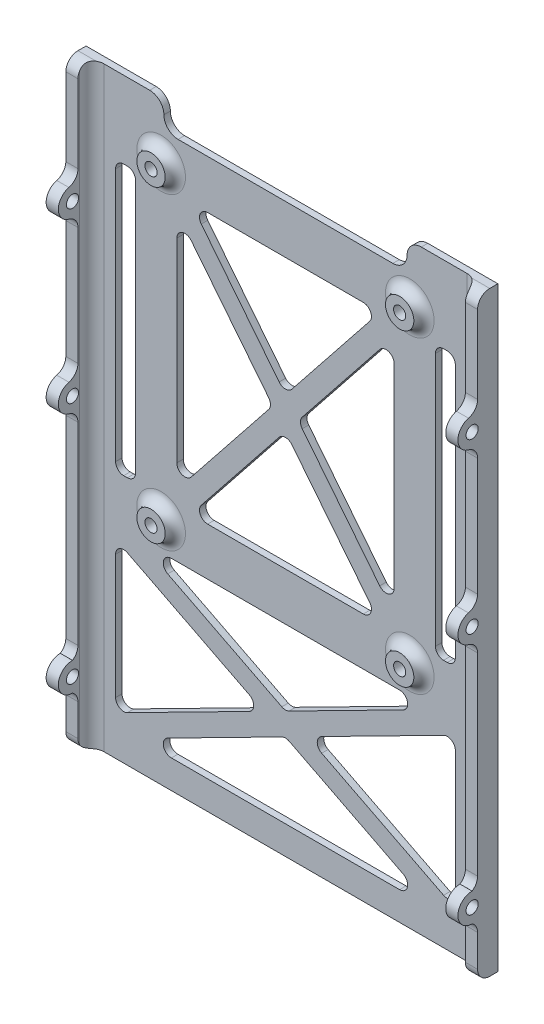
ISO-10303-21;
HEADER;
FILE_DESCRIPTION(('STEP AP214'),'2;1');
FILE_NAME('part.step','',(''),(''),'','','');
FILE_SCHEMA(('AUTOMOTIVE_DESIGN { 1 0 10303 214 1 1 1 1 }'));
ENDSEC;
DATA;
#1=APPLICATION_CONTEXT('core data for automotive mechanical design processes');
#2=APPLICATION_PROTOCOL_DEFINITION('international standard','automotive_design',2000,#1);
#3=PRODUCT_CONTEXT('',#1,'mechanical');
#4=PRODUCT('Part','Part','',(#3));
#5=PRODUCT_RELATED_PRODUCT_CATEGORY('part','',(#4));
#6=PRODUCT_DEFINITION_FORMATION('','',#4);
#7=PRODUCT_DEFINITION_CONTEXT('part definition',#1,'design');
#8=PRODUCT_DEFINITION('design','',#6,#7);
#9=PRODUCT_DEFINITION_SHAPE('','',#8);
#10=(LENGTH_UNIT() NAMED_UNIT(*) SI_UNIT(.MILLI.,.METRE.));
#11=(NAMED_UNIT(*) PLANE_ANGLE_UNIT() SI_UNIT($,.RADIAN.));
#12=(NAMED_UNIT(*) SI_UNIT($,.STERADIAN.) SOLID_ANGLE_UNIT());
#13=UNCERTAINTY_MEASURE_WITH_UNIT(LENGTH_MEASURE(1.E-05),#10,'distance_accuracy_value','');
#14=(GEOMETRIC_REPRESENTATION_CONTEXT(3) GLOBAL_UNCERTAINTY_ASSIGNED_CONTEXT((#13)) GLOBAL_UNIT_ASSIGNED_CONTEXT((#10,
#11,#12)) REPRESENTATION_CONTEXT('',''));
#15=CARTESIAN_POINT('',(0.,0.,0.));
#16=DIRECTION('',(0.,0.,1.));
#17=DIRECTION('',(1.,0.,0.));
#18=AXIS2_PLACEMENT_3D('',#15,#16,#17);
#19=CARTESIAN_POINT('',(0.,0.,0.));
#20=DIRECTION('',(0.,0.,1.));
#21=DIRECTION('',(1.,0.,0.));
#22=AXIS2_PLACEMENT_3D('',#19,#20,#21);
#23=PLANE('',#22);
#24=DIRECTION('',(-0.89130139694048,-0.453411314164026,0.));
#25=VECTOR('',#24,1.);
#26=CARTESIAN_POINT('',(17.1410064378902,-33.6952398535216,0.));
#27=LINE('',#26,#25);
#28=CARTESIAN_POINT('',(-8.92972061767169,-46.9576027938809,0.));
#29=VERTEX_POINT('',#28);
#30=CARTESIAN_POINT('',(-39.0131773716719,-62.261269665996,0.));
#31=VERTEX_POINT('',#30);
#32=EDGE_CURVE('E2499',#29,#31,#27,.T.);
#33=ORIENTED_EDGE('',*,*,#32,.F.);
#34=CARTESIAN_POINT('',(-9.83654324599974,-45.175,0.));
#35=DIRECTION('',(0.,0.,1.));
#36=DIRECTION('',(1.,0.,0.));
#37=AXIS2_PLACEMENT_3D('',#34,#35,#36);
#38=CIRCLE('',#37,2.);
#39=CARTESIAN_POINT('',(-8.92972061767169,-43.392397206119,0.));
#40=VERTEX_POINT('',#39);
#41=EDGE_CURVE('E1912',#29,#40,#38,.T.);
#42=ORIENTED_EDGE('',*,*,#41,.T.);
#43=DIRECTION('',(0.89130139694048,-0.453411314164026,0.));
#44=VECTOR('',#43,1.);
#45=CARTESIAN_POINT('',(-19.3717901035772,-38.0804427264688,0.));
#46=LINE('',#45,#44);
#47=CARTESIAN_POINT('',(-39.0131773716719,-28.0887303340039,0.));
#48=VERTEX_POINT('',#47);
#49=EDGE_CURVE('E2497',#48,#40,#46,.T.);
#50=ORIENTED_EDGE('',*,*,#49,.F.);
#51=CARTESIAN_POINT('',(-39.92,-29.8713331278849,0.));
#52=DIRECTION('',(0.,0.,1.));
#53=DIRECTION('',(1.,0.,0.));
#54=AXIS2_PLACEMENT_3D('',#51,#52,#53);
#55=CIRCLE('',#54,2.);
#56=CARTESIAN_POINT('',(-41.92,-29.8713331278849,0.));
#57=VERTEX_POINT('',#56);
#58=EDGE_CURVE('E214',#48,#57,#55,.T.);
#59=ORIENTED_EDGE('',*,*,#58,.T.);
#60=DIRECTION('',(0.,-1.,0.));
#61=VECTOR('',#60,1.);
#62=CARTESIAN_POINT('',(-41.92,0.,0.));
#63=LINE('',#62,#61);
#64=CARTESIAN_POINT('',(-41.92,-60.478666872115,0.));
#65=VERTEX_POINT('',#64);
#66=EDGE_CURVE('E2500',#57,#65,#63,.T.);
#67=ORIENTED_EDGE('',*,*,#66,.T.);
#68=CARTESIAN_POINT('',(-39.92,-60.478666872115,0.));
#69=DIRECTION('',(0.,0.,1.));
#70=DIRECTION('',(1.,0.,0.));
#71=AXIS2_PLACEMENT_3D('',#68,#69,#70);
#72=CIRCLE('',#71,2.);
#73=EDGE_CURVE('E206',#65,#31,#72,.T.);
#74=ORIENTED_EDGE('',*,*,#73,.T.);
#75=EDGE_LOOP('',(#33,#42,#50,#59,#67,#74));
#76=FACE_BOUND('',#75,.T.);
#77=DIRECTION('',(-0.89130139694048,-0.453411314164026,0.));
#78=VECTOR('',#77,1.);
#79=CARTESIAN_POINT('',(17.1410064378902,-33.6952398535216,0.));
#80=LINE('',#79,#78);
#81=CARTESIAN_POINT('',(29.0587436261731,-27.6326027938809,0.));
#82=VERTEX_POINT('',#81);
#83=CARTESIAN_POINT('',(0.906822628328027,-41.9536837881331,0.));
#84=VERTEX_POINT('',#83);
#85=EDGE_CURVE('E2394',#82,#84,#80,.T.);
#86=ORIENTED_EDGE('',*,*,#85,.F.);
#87=CARTESIAN_POINT('',(28.1519209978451,-25.85,0.));
#88=DIRECTION('',(0.,0.,1.));
#89=DIRECTION('',(1.,0.,0.));
#90=AXIS2_PLACEMENT_3D('',#87,#88,#89);
#91=CIRCLE('',#90,2.);
#92=CARTESIAN_POINT('',(28.1519209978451,-23.85,0.));
#93=VERTEX_POINT('',#92);
#94=EDGE_CURVE('E1904',#82,#93,#91,.T.);
#95=ORIENTED_EDGE('',*,*,#94,.T.);
#96=DIRECTION('',(-1.,0.,0.));
#97=VECTOR('',#96,1.);
#98=CARTESIAN_POINT('',(0.,-23.85,0.));
#99=LINE('',#98,#97);
#100=CARTESIAN_POINT('',(-28.1519209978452,-23.85,0.));
#101=VERTEX_POINT('',#100);
#102=EDGE_CURVE('E2400',#93,#101,#99,.T.);
#103=ORIENTED_EDGE('',*,*,#102,.T.);
#104=CARTESIAN_POINT('',(-28.1519209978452,-25.85,0.));
#105=DIRECTION('',(0.,0.,1.));
#106=DIRECTION('',(1.,0.,0.));
#107=AXIS2_PLACEMENT_3D('',#104,#105,#106);
#108=CIRCLE('',#107,2.);
#109=CARTESIAN_POINT('',(-29.0587436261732,-27.6326027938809,0.));
#110=VERTEX_POINT('',#109);
#111=EDGE_CURVE('E1928',#101,#110,#108,.T.);
#112=ORIENTED_EDGE('',*,*,#111,.T.);
#113=DIRECTION('',(-0.89130139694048,0.453411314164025,0.));
#114=VECTOR('',#113,1.);
#115=CARTESIAN_POINT('',(-17.1410064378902,-33.6952398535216,0.));
#116=LINE('',#115,#114);
#117=CARTESIAN_POINT('',(-0.906822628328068,-41.9536837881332,0.));
#118=VERTEX_POINT('',#117);
#119=EDGE_CURVE('E2397',#118,#110,#116,.T.);
#120=ORIENTED_EDGE('',*,*,#119,.F.);
#121=CARTESIAN_POINT('',(0.,-40.1710809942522,0.));
#122=DIRECTION('',(0.,0.,1.));
#123=DIRECTION('',(1.,0.,0.));
#124=AXIS2_PLACEMENT_3D('',#121,#122,#123);
#125=CIRCLE('',#124,2.);
#126=EDGE_CURVE('E1916',#118,#84,#125,.T.);
#127=ORIENTED_EDGE('',*,*,#126,.T.);
#128=EDGE_LOOP('',(#86,#95,#103,#112,#120,#127));
#129=FACE_BOUND('',#128,.T.);
#130=DIRECTION('',(1.,0.,0.));
#131=VECTOR('',#130,1.);
#132=CARTESIAN_POINT('',(-37.,-12.0670822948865,0.));
#133=LINE('',#132,#131);
#134=CARTESIAN_POINT('',(-39.92,-12.0670822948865,0.));
#135=VERTEX_POINT('',#134);
#136=CARTESIAN_POINT('',(-39.,-12.0670822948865,0.));
#137=VERTEX_POINT('',#136);
#138=EDGE_CURVE('E2424',#135,#137,#133,.T.);
#139=ORIENTED_EDGE('',*,*,#138,.T.);
#140=CARTESIAN_POINT('',(-39.,-10.0670822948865,0.));
#141=DIRECTION('',(0.,0.,1.));
#142=DIRECTION('',(1.,0.,0.));
#143=AXIS2_PLACEMENT_3D('',#140,#141,#142);
#144=CIRCLE('',#143,2.);
#145=CARTESIAN_POINT('',(-37.,-10.0670822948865,0.));
#146=VERTEX_POINT('',#145);
#147=EDGE_CURVE('E1781',#137,#146,#144,.T.);
#148=ORIENTED_EDGE('',*,*,#147,.T.);
#149=DIRECTION('',(0.,1.,0.));
#150=VECTOR('',#149,1.);
#151=CARTESIAN_POINT('',(-37.,54.5129177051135,0.));
#152=LINE('',#151,#150);
#153=CARTESIAN_POINT('',(-37.,52.5129177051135,0.));
#154=VERTEX_POINT('',#153);
#155=EDGE_CURVE('E2415',#146,#154,#152,.T.);
#156=ORIENTED_EDGE('',*,*,#155,.T.);
#157=CARTESIAN_POINT('',(-39.,52.5129177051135,0.));
#158=DIRECTION('',(0.,0.,1.));
#159=DIRECTION('',(1.,0.,0.));
#160=AXIS2_PLACEMENT_3D('',#157,#158,#159);
#161=CIRCLE('',#160,2.);
#162=CARTESIAN_POINT('',(-39.,54.5129177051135,0.));
#163=VERTEX_POINT('',#162);
#164=EDGE_CURVE('E1789',#154,#163,#161,.T.);
#165=ORIENTED_EDGE('',*,*,#164,.T.);
#166=DIRECTION('',(-1.,0.,0.));
#167=VECTOR('',#166,1.);
#168=CARTESIAN_POINT('',(-37.,54.5129177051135,0.));
#169=LINE('',#168,#167);
#170=CARTESIAN_POINT('',(-39.92,54.5129177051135,0.));
#171=VERTEX_POINT('',#170);
#172=EDGE_CURVE('E2418',#163,#171,#169,.T.);
#173=ORIENTED_EDGE('',*,*,#172,.T.);
#174=CARTESIAN_POINT('',(-39.92,52.5129177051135,0.));
#175=DIRECTION('',(0.,0.,1.));
#176=DIRECTION('',(1.,0.,0.));
#177=AXIS2_PLACEMENT_3D('',#174,#175,#176);
#178=CIRCLE('',#177,2.);
#179=CARTESIAN_POINT('',(-41.92,52.5129177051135,0.));
#180=VERTEX_POINT('',#179);
#181=EDGE_CURVE('E1793',#171,#180,#178,.T.);
#182=ORIENTED_EDGE('',*,*,#181,.T.);
#183=DIRECTION('',(0.,-1.,0.));
#184=VECTOR('',#183,1.);
#185=CARTESIAN_POINT('',(-41.92,54.5129177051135,0.));
#186=LINE('',#185,#184);
#187=CARTESIAN_POINT('',(-41.92,-10.0670822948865,0.));
#188=VERTEX_POINT('',#187);
#189=EDGE_CURVE('E2421',#180,#188,#186,.T.);
#190=ORIENTED_EDGE('',*,*,#189,.T.);
#191=CARTESIAN_POINT('',(-39.92,-10.0670822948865,0.));
#192=DIRECTION('',(0.,0.,1.));
#193=DIRECTION('',(1.,0.,0.));
#194=AXIS2_PLACEMENT_3D('',#191,#192,#193);
#195=CIRCLE('',#194,2.);
#196=EDGE_CURVE('E1785',#188,#135,#195,.T.);
#197=ORIENTED_EDGE('',*,*,#196,.T.);
#198=EDGE_LOOP('',(#139,#148,#156,#165,#173,#182,#190,#197));
#199=FACE_BOUND('',#198,.T.);
#200=DIRECTION('',(0.622920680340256,-0.78228500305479,0.));
#201=VECTOR('',#200,1.);
#202=CARTESIAN_POINT('',(12.2666993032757,9.7677708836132,0.));
#203=LINE('',#202,#201);
#204=CARTESIAN_POINT('',(4.1355391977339,19.9791586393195,0.));
#205=VERTEX_POINT('',#204);
#206=CARTESIAN_POINT('',(23.2537327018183,-4.03011980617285,0.));
#207=VERTEX_POINT('',#206);
#208=EDGE_CURVE('E2433',#205,#207,#203,.T.);
#209=ORIENTED_EDGE('',*,*,#208,.T.);
#210=CARTESIAN_POINT('',(24.8183027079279,-2.78427844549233,0.));
#211=DIRECTION('',(0.,0.,1.));
#212=DIRECTION('',(1.,0.,0.));
#213=AXIS2_PLACEMENT_3D('',#210,#211,#212);
#214=CIRCLE('',#213,2.);
#215=CARTESIAN_POINT('',(26.8183027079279,-2.78427844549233,0.));
#216=VERTEX_POINT('',#215);
#217=EDGE_CURVE('E1665',#207,#216,#214,.T.);
#218=ORIENTED_EDGE('',*,*,#217,.T.);
#219=DIRECTION('',(0.,1.,0.));
#220=VECTOR('',#219,1.);
#221=CARTESIAN_POINT('',(26.8183027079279,0.,0.));
#222=LINE('',#221,#220);
#223=CARTESIAN_POINT('',(26.8183027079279,45.2342784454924,0.));
#224=VERTEX_POINT('',#223);
#225=EDGE_CURVE('E2427',#216,#224,#222,.T.);
#226=ORIENTED_EDGE('',*,*,#225,.T.);
#227=CARTESIAN_POINT('',(24.8183027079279,45.2342784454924,0.));
#228=DIRECTION('',(0.,0.,1.));
#229=DIRECTION('',(1.,0.,0.));
#230=AXIS2_PLACEMENT_3D('',#227,#228,#229);
#231=CIRCLE('',#230,2.);
#232=CARTESIAN_POINT('',(23.2537327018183,46.4801198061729,0.));
#233=VERTEX_POINT('',#232);
#234=EDGE_CURVE('E1669',#224,#233,#231,.T.);
#235=ORIENTED_EDGE('',*,*,#234,.T.);
#236=DIRECTION('',(-0.622920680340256,-0.78228500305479,0.));
#237=VECTOR('',#236,1.);
#238=CARTESIAN_POINT('',(-8.41924964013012,6.70411000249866,0.));
#239=LINE('',#238,#237);
#240=CARTESIAN_POINT('',(4.13553919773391,22.4708413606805,0.));
#241=VERTEX_POINT('',#240);
#242=EDGE_CURVE('E2430',#233,#241,#239,.T.);
#243=ORIENTED_EDGE('',*,*,#242,.T.);
#244=CARTESIAN_POINT('',(5.70010920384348,21.225,0.));
#245=DIRECTION('',(0.,0.,1.));
#246=DIRECTION('',(1.,0.,0.));
#247=AXIS2_PLACEMENT_3D('',#244,#245,#246);
#248=CIRCLE('',#247,2.);
#249=EDGE_CURVE('E1677',#241,#205,#248,.T.);
#250=ORIENTED_EDGE('',*,*,#249,.T.);
#251=EDGE_LOOP('',(#209,#218,#226,#235,#243,#250));
#252=FACE_BOUND('',#251,.T.);
#253=DIRECTION('',(0.622920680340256,0.78228500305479,0.));
#254=VECTOR('',#253,1.);
#255=CARTESIAN_POINT('',(-12.2666993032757,9.76777088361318,0.));
#256=LINE('',#255,#254);
#257=CARTESIAN_POINT('',(-23.2537327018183,-4.03011980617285,0.));
#258=VERTEX_POINT('',#257);
#259=CARTESIAN_POINT('',(-4.13553919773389,19.9791586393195,0.));
#260=VERTEX_POINT('',#259);
#261=EDGE_CURVE('E1975',#258,#260,#256,.T.);
#262=ORIENTED_EDGE('',*,*,#261,.T.);
#263=CARTESIAN_POINT('',(-5.70010920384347,21.225,0.));
#264=DIRECTION('',(0.,0.,1.));
#265=DIRECTION('',(1.,0.,0.));
#266=AXIS2_PLACEMENT_3D('',#263,#264,#265);
#267=CIRCLE('',#266,2.);
#268=CARTESIAN_POINT('',(-4.13553919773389,22.4708413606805,0.));
#269=VERTEX_POINT('',#268);
#270=EDGE_CURVE('E1693',#260,#269,#267,.T.);
#271=ORIENTED_EDGE('',*,*,#270,.T.);
#272=DIRECTION('',(-0.622920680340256,0.78228500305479,0.));
#273=VECTOR('',#272,1.);
#274=CARTESIAN_POINT('',(8.41924964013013,6.70411000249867,0.));
#275=LINE('',#274,#273);
#276=CARTESIAN_POINT('',(-23.2537327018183,46.4801198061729,0.));
#277=VERTEX_POINT('',#276);
#278=EDGE_CURVE('E1968',#269,#277,#275,.T.);
#279=ORIENTED_EDGE('',*,*,#278,.T.);
#280=CARTESIAN_POINT('',(-24.8183027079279,45.2342784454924,0.));
#281=DIRECTION('',(0.,0.,1.));
#282=DIRECTION('',(1.,0.,0.));
#283=AXIS2_PLACEMENT_3D('',#280,#281,#282);
#284=CIRCLE('',#283,2.);
#285=CARTESIAN_POINT('',(-26.8183027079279,45.2342784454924,0.));
#286=VERTEX_POINT('',#285);
#287=EDGE_CURVE('E1689',#277,#286,#284,.T.);
#288=ORIENTED_EDGE('',*,*,#287,.T.);
#289=DIRECTION('',(0.,1.,0.));
#290=VECTOR('',#289,1.);
#291=CARTESIAN_POINT('',(-26.8183027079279,0.,0.));
#292=LINE('',#291,#290);
#293=CARTESIAN_POINT('',(-26.8183027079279,-2.78427844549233,0.));
#294=VERTEX_POINT('',#293);
#295=EDGE_CURVE('E1980',#294,#286,#292,.T.);
#296=ORIENTED_EDGE('',*,*,#295,.F.);
#297=CARTESIAN_POINT('',(-24.8183027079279,-2.78427844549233,0.));
#298=DIRECTION('',(0.,0.,1.));
#299=DIRECTION('',(1.,0.,0.));
#300=AXIS2_PLACEMENT_3D('',#297,#298,#299);
#301=CIRCLE('',#300,2.);
#302=EDGE_CURVE('E1697',#294,#258,#301,.T.);
#303=ORIENTED_EDGE('',*,*,#302,.T.);
#304=EDGE_LOOP('',(#262,#271,#279,#288,#296,#303));
#305=FACE_BOUND('',#304,.T.);
#306=DIRECTION('',(1.,0.,0.));
#307=VECTOR('',#306,1.);
#308=CARTESIAN_POINT('',(-30.,66.5,0.));
#309=LINE('',#308,#307);
#310=CARTESIAN_POINT('',(-26.5,66.5,0.));
#311=VERTEX_POINT('',#310);
#312=CARTESIAN_POINT('',(26.5,66.5,0.));
#313=VERTEX_POINT('',#312);
#314=EDGE_CURVE('E1989',#311,#313,#309,.T.);
#315=ORIENTED_EDGE('',*,*,#314,.T.);
#316=CARTESIAN_POINT('',(26.5,70.,0.));
#317=DIRECTION('',(0.,0.,1.));
#318=DIRECTION('',(1.,0.,0.));
#319=AXIS2_PLACEMENT_3D('',#316,#317,#318);
#320=CIRCLE('',#319,3.5);
#321=CARTESIAN_POINT('',(30.,70.,0.));
#322=VERTEX_POINT('',#321);
#323=EDGE_CURVE('E1078',#313,#322,#320,.T.);
#324=ORIENTED_EDGE('',*,*,#323,.T.);
#325=CARTESIAN_POINT('',(33.5,70.,0.));
#326=DIRECTION('',(0.,0.,1.));
#327=DIRECTION('',(1.,0.,0.));
#328=AXIS2_PLACEMENT_3D('',#325,#326,#327);
#329=CIRCLE('',#328,3.5);
#330=CARTESIAN_POINT('',(33.5,73.5,0.));
#331=VERTEX_POINT('',#330);
#332=EDGE_CURVE('E1054',#322,#331,#329,.F.);
#333=ORIENTED_EDGE('',*,*,#332,.T.);
#334=DIRECTION('',(-1.,0.,0.));
#335=VECTOR('',#334,1.);
#336=CARTESIAN_POINT('',(-50.8,73.5,0.));
#337=LINE('',#336,#335);
#338=CARTESIAN_POINT('',(50.8,73.5,0.));
#339=VERTEX_POINT('',#338);
#340=EDGE_CURVE('E982',#339,#331,#337,.T.);
#341=ORIENTED_EDGE('',*,*,#340,.F.);
#342=DIRECTION('',(0.,1.,0.));
#343=VECTOR('',#342,1.);
#344=CARTESIAN_POINT('',(50.8,73.5,0.));
#345=LINE('',#344,#343);
#346=CARTESIAN_POINT('',(50.8,-73.5,0.));
#347=VERTEX_POINT('',#346);
#348=EDGE_CURVE('E976',#347,#339,#345,.T.);
#349=ORIENTED_EDGE('',*,*,#348,.F.);
#350=DIRECTION('',(1.,0.,0.));
#351=VECTOR('',#350,1.);
#352=CARTESIAN_POINT('',(-50.8,-73.5,0.));
#353=LINE('',#352,#351);
#354=CARTESIAN_POINT('',(-50.8,-73.5,0.));
#355=VERTEX_POINT('',#354);
#356=EDGE_CURVE('E988',#355,#347,#353,.T.);
#357=ORIENTED_EDGE('',*,*,#356,.F.);
#358=DIRECTION('',(0.,-1.,0.));
#359=VECTOR('',#358,1.);
#360=CARTESIAN_POINT('',(-50.8,73.5,0.));
#361=LINE('',#360,#359);
#362=CARTESIAN_POINT('',(-50.8,73.5,0.));
#363=VERTEX_POINT('',#362);
#364=EDGE_CURVE('E985',#363,#355,#361,.T.);
#365=ORIENTED_EDGE('',*,*,#364,.F.);
#366=CARTESIAN_POINT('',(-33.5,73.5,0.));
#367=VERTEX_POINT('',#366);
#368=EDGE_CURVE('E981',#367,#363,#337,.T.);
#369=ORIENTED_EDGE('',*,*,#368,.F.);
#370=CARTESIAN_POINT('',(-33.5,70.,0.));
#371=DIRECTION('',(0.,0.,1.));
#372=DIRECTION('',(1.,0.,0.));
#373=AXIS2_PLACEMENT_3D('',#370,#371,#372);
#374=CIRCLE('',#373,3.5);
#375=CARTESIAN_POINT('',(-30.,70.,0.));
#376=VERTEX_POINT('',#375);
#377=EDGE_CURVE('E1051',#367,#376,#374,.F.);
#378=ORIENTED_EDGE('',*,*,#377,.T.);
#379=CARTESIAN_POINT('',(-26.5,70.,0.));
#380=DIRECTION('',(0.,0.,1.));
#381=DIRECTION('',(1.,0.,0.));
#382=AXIS2_PLACEMENT_3D('',#379,#380,#381);
#383=CIRCLE('',#382,3.5);
#384=EDGE_CURVE('E1074',#376,#311,#383,.T.);
#385=ORIENTED_EDGE('',*,*,#384,.T.);
#386=EDGE_LOOP('',(#315,#324,#333,#341,#349,#357,#365,#369,#378,#385));
#387=FACE_BOUND('',#386,.T.);
#388=CARTESIAN_POINT('',(30.675,59.3,0.));
#389=DIRECTION('',(0.,0.,1.));
#390=DIRECTION('',(1.,0.,0.));
#391=AXIS2_PLACEMENT_3D('',#388,#389,#390);
#392=CIRCLE('',#391,1.5);
#393=CARTESIAN_POINT('',(32.175,59.3,0.));
#394=VERTEX_POINT('',#393);
#395=EDGE_CURVE('E1040',#394,#394,#392,.T.);
#396=ORIENTED_EDGE('',*,*,#395,.T.);
#397=EDGE_LOOP('',(#396));
#398=FACE_BOUND('',#397,.T.);
#399=CARTESIAN_POINT('',(30.675,-16.85,0.));
#400=DIRECTION('',(0.,0.,1.));
#401=DIRECTION('',(1.,0.,0.));
#402=AXIS2_PLACEMENT_3D('',#399,#400,#401);
#403=CIRCLE('',#402,1.5);
#404=CARTESIAN_POINT('',(32.175,-16.85,0.));
#405=VERTEX_POINT('',#404);
#406=EDGE_CURVE('E1994',#405,#405,#403,.T.);
#407=ORIENTED_EDGE('',*,*,#406,.T.);
#408=EDGE_LOOP('',(#407));
#409=FACE_BOUND('',#408,.T.);
#410=CARTESIAN_POINT('',(-30.675,-16.85,0.));
#411=DIRECTION('',(0.,0.,1.));
#412=DIRECTION('',(1.,0.,0.));
#413=AXIS2_PLACEMENT_3D('',#410,#411,#412);
#414=CIRCLE('',#413,1.5);
#415=CARTESIAN_POINT('',(-29.175,-16.85,0.));
#416=VERTEX_POINT('',#415);
#417=EDGE_CURVE('E1991',#416,#416,#414,.T.);
#418=ORIENTED_EDGE('',*,*,#417,.T.);
#419=EDGE_LOOP('',(#418));
#420=FACE_BOUND('',#419,.T.);
#421=CARTESIAN_POINT('',(-30.675,59.3,0.));
#422=DIRECTION('',(0.,0.,1.));
#423=DIRECTION('',(1.,0.,0.));
#424=AXIS2_PLACEMENT_3D('',#421,#422,#423);
#425=CIRCLE('',#424,1.5);
#426=CARTESIAN_POINT('',(-29.175,59.3,0.));
#427=VERTEX_POINT('',#426);
#428=EDGE_CURVE('E1035',#427,#427,#425,.T.);
#429=ORIENTED_EDGE('',*,*,#428,.T.);
#430=EDGE_LOOP('',(#429));
#431=FACE_BOUND('',#430,.T.);
#432=DIRECTION('',(-1.,0.,0.));
#433=VECTOR('',#432,1.);
#434=CARTESIAN_POINT('',(0.,-12.0629177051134,0.));
#435=LINE('',#434,#433);
#436=CARTESIAN_POINT('',(19.2139450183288,-12.0629177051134,0.));
#437=VERTEX_POINT('',#436);
#438=CARTESIAN_POINT('',(-19.2139450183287,-12.0629177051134,0.));
#439=VERTEX_POINT('',#438);
#440=EDGE_CURVE('E1986',#437,#439,#435,.T.);
#441=ORIENTED_EDGE('',*,*,#440,.F.);
#442=CARTESIAN_POINT('',(19.2139450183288,-10.0629177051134,0.));
#443=DIRECTION('',(0.,0.,1.));
#444=DIRECTION('',(1.,0.,0.));
#445=AXIS2_PLACEMENT_3D('',#442,#443,#444);
#446=CIRCLE('',#445,2.);
#447=CARTESIAN_POINT('',(20.7785150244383,-8.8170763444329,0.));
#448=VERTEX_POINT('',#447);
#449=EDGE_CURVE('E1661',#437,#448,#446,.T.);
#450=ORIENTED_EDGE('',*,*,#449,.T.);
#451=DIRECTION('',(-0.622920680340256,0.78228500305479,0.));
#452=VECTOR('',#451,1.);
#453=CARTESIAN_POINT('',(8.41924964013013,6.70411000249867,0.));
#454=LINE('',#453,#452);
#455=CARTESIAN_POINT('',(1.56457000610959,15.31245011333,0.));
#456=VERTEX_POINT('',#455);
#457=EDGE_CURVE('E1974',#448,#456,#454,.T.);
#458=ORIENTED_EDGE('',*,*,#457,.T.);
#459=CARTESIAN_POINT('',(0.,14.0666087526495,0.));
#460=DIRECTION('',(0.,0.,1.));
#461=DIRECTION('',(1.,0.,0.));
#462=AXIS2_PLACEMENT_3D('',#459,#460,#461);
#463=CIRCLE('',#462,2.);
#464=CARTESIAN_POINT('',(-1.56457000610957,15.31245011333,0.));
#465=VERTEX_POINT('',#464);
#466=EDGE_CURVE('E1657',#456,#465,#463,.T.);
#467=ORIENTED_EDGE('',*,*,#466,.T.);
#468=DIRECTION('',(-0.622920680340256,-0.78228500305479,0.));
#469=VECTOR('',#468,1.);
#470=CARTESIAN_POINT('',(-8.41924964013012,6.70411000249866,0.));
#471=LINE('',#470,#469);
#472=CARTESIAN_POINT('',(-20.7785150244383,-8.8170763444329,0.));
#473=VERTEX_POINT('',#472);
#474=EDGE_CURVE('E1978',#465,#473,#471,.T.);
#475=ORIENTED_EDGE('',*,*,#474,.T.);
#476=CARTESIAN_POINT('',(-19.2139450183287,-10.0629177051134,0.));
#477=DIRECTION('',(0.,0.,1.));
#478=DIRECTION('',(1.,0.,0.));
#479=AXIS2_PLACEMENT_3D('',#476,#477,#478);
#480=CIRCLE('',#479,2.);
#481=EDGE_CURVE('E1653',#473,#439,#480,.T.);
#482=ORIENTED_EDGE('',*,*,#481,.T.);
#483=EDGE_LOOP('',(#441,#450,#458,#467,#475,#482));
#484=FACE_BOUND('',#483,.T.);
#485=DIRECTION('',(-1.,0.,0.));
#486=VECTOR('',#485,1.);
#487=CARTESIAN_POINT('',(0.,54.5129177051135,0.));
#488=LINE('',#487,#486);
#489=CARTESIAN_POINT('',(19.2139450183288,54.5129177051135,0.));
#490=VERTEX_POINT('',#489);
#491=CARTESIAN_POINT('',(-19.2139450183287,54.5129177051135,0.));
#492=VERTEX_POINT('',#491);
#493=EDGE_CURVE('E2442',#490,#492,#488,.T.);
#494=ORIENTED_EDGE('',*,*,#493,.T.);
#495=CARTESIAN_POINT('',(-19.2139450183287,52.5129177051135,0.));
#496=DIRECTION('',(0.,0.,1.));
#497=DIRECTION('',(1.,0.,0.));
#498=AXIS2_PLACEMENT_3D('',#495,#496,#497);
#499=CIRCLE('',#498,2.);
#500=CARTESIAN_POINT('',(-20.7785150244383,51.267076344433,0.));
#501=VERTEX_POINT('',#500);
#502=EDGE_CURVE('E1685',#492,#501,#499,.T.);
#503=ORIENTED_EDGE('',*,*,#502,.T.);
#504=DIRECTION('',(0.622920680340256,-0.78228500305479,0.));
#505=VECTOR('',#504,1.);
#506=CARTESIAN_POINT('',(12.2666993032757,9.7677708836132,0.));
#507=LINE('',#506,#505);
#508=CARTESIAN_POINT('',(-1.56457000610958,27.1375498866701,0.));
#509=VERTEX_POINT('',#508);
#510=EDGE_CURVE('E2436',#501,#509,#507,.T.);
#511=ORIENTED_EDGE('',*,*,#510,.T.);
#512=CARTESIAN_POINT('',(0.,28.3833912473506,0.));
#513=DIRECTION('',(0.,0.,1.));
#514=DIRECTION('',(1.,0.,0.));
#515=AXIS2_PLACEMENT_3D('',#512,#513,#514);
#516=CIRCLE('',#515,2.);
#517=CARTESIAN_POINT('',(1.56457000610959,27.1375498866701,0.));
#518=VERTEX_POINT('',#517);
#519=EDGE_CURVE('E1681',#509,#518,#516,.T.);
#520=ORIENTED_EDGE('',*,*,#519,.T.);
#521=DIRECTION('',(0.622920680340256,0.78228500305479,0.));
#522=VECTOR('',#521,1.);
#523=CARTESIAN_POINT('',(-12.2666993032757,9.76777088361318,0.));
#524=LINE('',#523,#522);
#525=CARTESIAN_POINT('',(20.7785150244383,51.267076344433,0.));
#526=VERTEX_POINT('',#525);
#527=EDGE_CURVE('E2439',#518,#526,#524,.T.);
#528=ORIENTED_EDGE('',*,*,#527,.T.);
#529=CARTESIAN_POINT('',(19.2139450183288,52.5129177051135,0.));
#530=DIRECTION('',(0.,0.,1.));
#531=DIRECTION('',(1.,0.,0.));
#532=AXIS2_PLACEMENT_3D('',#529,#530,#531);
#533=CIRCLE('',#532,2.);
#534=EDGE_CURVE('E1673',#526,#490,#533,.T.);
#535=ORIENTED_EDGE('',*,*,#534,.T.);
#536=EDGE_LOOP('',(#494,#503,#511,#520,#528,#535));
#537=FACE_BOUND('',#536,.T.);
#538=DIRECTION('',(1.,0.,0.));
#539=VECTOR('',#538,1.);
#540=CARTESIAN_POINT('',(41.92,-12.0670822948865,0.));
#541=LINE('',#540,#539);
#542=CARTESIAN_POINT('',(39.,-12.0670822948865,0.));
#543=VERTEX_POINT('',#542);
#544=CARTESIAN_POINT('',(39.92,-12.0670822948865,0.));
#545=VERTEX_POINT('',#544);
#546=EDGE_CURVE('E2412',#543,#545,#541,.T.);
#547=ORIENTED_EDGE('',*,*,#546,.T.);
#548=CARTESIAN_POINT('',(39.92,-10.0670822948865,0.));
#549=DIRECTION('',(0.,0.,1.));
#550=DIRECTION('',(1.,0.,0.));
#551=AXIS2_PLACEMENT_3D('',#548,#549,#550);
#552=CIRCLE('',#551,2.);
#553=CARTESIAN_POINT('',(41.92,-10.0670822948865,0.));
#554=VERTEX_POINT('',#553);
#555=EDGE_CURVE('E1777',#545,#554,#552,.T.);
#556=ORIENTED_EDGE('',*,*,#555,.T.);
#557=DIRECTION('',(0.,1.,0.));
#558=VECTOR('',#557,1.);
#559=CARTESIAN_POINT('',(41.92,54.5129177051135,0.));
#560=LINE('',#559,#558);
#561=CARTESIAN_POINT('',(41.92,52.5129177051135,0.));
#562=VERTEX_POINT('',#561);
#563=EDGE_CURVE('E2403',#554,#562,#560,.T.);
#564=ORIENTED_EDGE('',*,*,#563,.T.);
#565=CARTESIAN_POINT('',(39.92,52.5129177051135,0.));
#566=DIRECTION('',(0.,0.,1.));
#567=DIRECTION('',(1.,0.,0.));
#568=AXIS2_PLACEMENT_3D('',#565,#566,#567);
#569=CIRCLE('',#568,2.);
#570=CARTESIAN_POINT('',(39.92,54.5129177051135,0.));
#571=VERTEX_POINT('',#570);
#572=EDGE_CURVE('E1765',#562,#571,#569,.T.);
#573=ORIENTED_EDGE('',*,*,#572,.T.);
#574=DIRECTION('',(-1.,0.,0.));
#575=VECTOR('',#574,1.);
#576=CARTESIAN_POINT('',(41.92,54.5129177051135,0.));
#577=LINE('',#576,#575);
#578=CARTESIAN_POINT('',(39.,54.5129177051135,0.));
#579=VERTEX_POINT('',#578);
#580=EDGE_CURVE('E2406',#571,#579,#577,.T.);
#581=ORIENTED_EDGE('',*,*,#580,.T.);
#582=CARTESIAN_POINT('',(39.,52.5129177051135,0.));
#583=DIRECTION('',(0.,0.,1.));
#584=DIRECTION('',(1.,0.,0.));
#585=AXIS2_PLACEMENT_3D('',#582,#583,#584);
#586=CIRCLE('',#585,2.);
#587=CARTESIAN_POINT('',(37.,52.5129177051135,0.));
#588=VERTEX_POINT('',#587);
#589=EDGE_CURVE('E1769',#579,#588,#586,.T.);
#590=ORIENTED_EDGE('',*,*,#589,.T.);
#591=DIRECTION('',(0.,-1.,0.));
#592=VECTOR('',#591,1.);
#593=CARTESIAN_POINT('',(37.,54.5129177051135,0.));
#594=LINE('',#593,#592);
#595=CARTESIAN_POINT('',(37.,-10.0670822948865,0.));
#596=VERTEX_POINT('',#595);
#597=EDGE_CURVE('E2409',#588,#596,#594,.T.);
#598=ORIENTED_EDGE('',*,*,#597,.T.);
#599=CARTESIAN_POINT('',(39.,-10.0670822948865,0.));
#600=DIRECTION('',(0.,0.,1.));
#601=DIRECTION('',(1.,0.,0.));
#602=AXIS2_PLACEMENT_3D('',#599,#600,#601);
#603=CIRCLE('',#602,2.);
#604=EDGE_CURVE('E1773',#596,#543,#603,.T.);
#605=ORIENTED_EDGE('',*,*,#604,.T.);
#606=EDGE_LOOP('',(#547,#556,#564,#573,#581,#590,#598,#605));
#607=FACE_BOUND('',#606,.T.);
#608=DIRECTION('',(0.,-1.,0.));
#609=VECTOR('',#608,1.);
#610=CARTESIAN_POINT('',(41.92,0.,0.));
#611=LINE('',#610,#609);
#612=CARTESIAN_POINT('',(41.92,-29.8713331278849,0.));
#613=VERTEX_POINT('',#612);
#614=CARTESIAN_POINT('',(41.92,-60.478666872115,0.));
#615=VERTEX_POINT('',#614);
#616=EDGE_CURVE('E2377',#613,#615,#611,.T.);
#617=ORIENTED_EDGE('',*,*,#616,.F.);
#618=CARTESIAN_POINT('',(39.92,-29.8713331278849,0.));
#619=DIRECTION('',(0.,0.,1.));
#620=DIRECTION('',(1.,0.,0.));
#621=AXIS2_PLACEMENT_3D('',#618,#619,#620);
#622=CIRCLE('',#621,2.);
#623=CARTESIAN_POINT('',(39.013177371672,-28.0887303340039,0.));
#624=VERTEX_POINT('',#623);
#625=EDGE_CURVE('E1892',#613,#624,#622,.T.);
#626=ORIENTED_EDGE('',*,*,#625,.T.);
#627=DIRECTION('',(-0.89130139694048,-0.453411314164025,0.));
#628=VECTOR('',#627,1.);
#629=CARTESIAN_POINT('',(19.3717901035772,-38.0804427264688,0.));
#630=LINE('',#629,#628);
#631=CARTESIAN_POINT('',(8.92972061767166,-43.392397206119,0.));
#632=VERTEX_POINT('',#631);
#633=EDGE_CURVE('E2376',#624,#632,#630,.T.);
#634=ORIENTED_EDGE('',*,*,#633,.T.);
#635=CARTESIAN_POINT('',(9.83654324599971,-45.175,0.));
#636=DIRECTION('',(0.,0.,1.));
#637=DIRECTION('',(1.,0.,0.));
#638=AXIS2_PLACEMENT_3D('',#635,#636,#637);
#639=CIRCLE('',#638,2.);
#640=CARTESIAN_POINT('',(8.92972061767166,-46.9576027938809,0.));
#641=VERTEX_POINT('',#640);
#642=EDGE_CURVE('E1920',#632,#641,#639,.T.);
#643=ORIENTED_EDGE('',*,*,#642,.T.);
#644=DIRECTION('',(-0.89130139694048,0.453411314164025,0.));
#645=VECTOR('',#644,1.);
#646=CARTESIAN_POINT('',(-17.1410064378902,-33.6952398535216,0.));
#647=LINE('',#646,#645);
#648=CARTESIAN_POINT('',(39.013177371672,-62.2612696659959,0.));
#649=VERTEX_POINT('',#648);
#650=EDGE_CURVE('E2380',#649,#641,#647,.T.);
#651=ORIENTED_EDGE('',*,*,#650,.F.);
#652=CARTESIAN_POINT('',(39.92,-60.478666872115,0.));
#653=DIRECTION('',(0.,0.,1.));
#654=DIRECTION('',(1.,0.,0.));
#655=AXIS2_PLACEMENT_3D('',#652,#653,#654);
#656=CIRCLE('',#655,2.);
#657=EDGE_CURVE('E1900',#649,#615,#656,.T.);
#658=ORIENTED_EDGE('',*,*,#657,.T.);
#659=EDGE_LOOP('',(#617,#626,#634,#643,#651,#658));
#660=FACE_BOUND('',#659,.T.);
#661=DIRECTION('',(-1.,0.,0.));
#662=VECTOR('',#661,1.);
#663=CARTESIAN_POINT('',(0.,-66.5,0.));
#664=LINE('',#663,#662);
#665=CARTESIAN_POINT('',(28.1519209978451,-66.5,0.));
#666=VERTEX_POINT('',#665);
#667=CARTESIAN_POINT('',(-28.1519209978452,-66.5,0.));
#668=VERTEX_POINT('',#667);
#669=EDGE_CURVE('E2391',#666,#668,#664,.T.);
#670=ORIENTED_EDGE('',*,*,#669,.F.);
#671=CARTESIAN_POINT('',(28.1519209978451,-64.5,0.));
#672=DIRECTION('',(0.,0.,1.));
#673=DIRECTION('',(1.,0.,0.));
#674=AXIS2_PLACEMENT_3D('',#671,#672,#673);
#675=CIRCLE('',#674,2.);
#676=CARTESIAN_POINT('',(29.0587436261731,-62.717397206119,0.));
#677=VERTEX_POINT('',#676);
#678=EDGE_CURVE('E1896',#666,#677,#675,.T.);
#679=ORIENTED_EDGE('',*,*,#678,.T.);
#680=DIRECTION('',(0.89130139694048,-0.453411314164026,0.));
#681=VECTOR('',#680,1.);
#682=CARTESIAN_POINT('',(-19.3717901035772,-38.0804427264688,0.));
#683=LINE('',#682,#681);
#684=CARTESIAN_POINT('',(0.90682262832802,-48.3963162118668,0.));
#685=VERTEX_POINT('',#684);
#686=EDGE_CURVE('E2383',#685,#677,#683,.T.);
#687=ORIENTED_EDGE('',*,*,#686,.F.);
#688=CARTESIAN_POINT('',(0.,-50.1789190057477,0.));
#689=DIRECTION('',(0.,0.,1.));
#690=DIRECTION('',(1.,0.,0.));
#691=AXIS2_PLACEMENT_3D('',#688,#689,#690);
#692=CIRCLE('',#691,2.);
#693=CARTESIAN_POINT('',(-0.906822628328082,-48.3963162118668,0.));
#694=VERTEX_POINT('',#693);
#695=EDGE_CURVE('E1908',#685,#694,#692,.T.);
#696=ORIENTED_EDGE('',*,*,#695,.T.);
#697=DIRECTION('',(-0.89130139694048,-0.453411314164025,0.));
#698=VECTOR('',#697,1.);
#699=CARTESIAN_POINT('',(19.3717901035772,-38.0804427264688,0.));
#700=LINE('',#699,#698);
#701=CARTESIAN_POINT('',(-29.0587436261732,-62.717397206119,0.));
#702=VERTEX_POINT('',#701);
#703=EDGE_CURVE('E2379',#694,#702,#700,.T.);
#704=ORIENTED_EDGE('',*,*,#703,.T.);
#705=CARTESIAN_POINT('',(-28.1519209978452,-64.5,0.));
#706=DIRECTION('',(0.,0.,1.));
#707=DIRECTION('',(1.,0.,0.));
#708=AXIS2_PLACEMENT_3D('',#705,#706,#707);
#709=CIRCLE('',#708,2.);
#710=EDGE_CURVE('E1924',#702,#668,#709,.T.);
#711=ORIENTED_EDGE('',*,*,#710,.T.);
#712=EDGE_LOOP('',(#670,#679,#687,#696,#704,#711));
#713=FACE_BOUND('',#712,.T.);
#714=ADVANCED_FACE('F191',(#76,#129,#199,#252,#305,#387,#398,#409,#420,#431,#484,#537,#607,#660,
#713),#23,.F.);
#715=CARTESIAN_POINT('',(0.,0.,1.6));
#716=DIRECTION('',(0.,0.,1.));
#717=DIRECTION('',(1.,0.,0.));
#718=AXIS2_PLACEMENT_3D('',#715,#716,#717);
#719=PLANE('',#718);
#720=CARTESIAN_POINT('',(-30.675,-16.85,1.6));
#721=DIRECTION('',(0.,0.,1.));
#722=DIRECTION('',(1.,0.,0.));
#723=AXIS2_PLACEMENT_3D('',#720,#721,#722);
#724=CIRCLE('',#723,6.);
#725=CARTESIAN_POINT('',(-24.675,-16.85,1.6));
#726=VERTEX_POINT('',#725);
#727=EDGE_CURVE('E14',#726,#726,#724,.F.);
#728=ORIENTED_EDGE('',*,*,#727,.T.);
#729=EDGE_LOOP('',(#728));
#730=FACE_BOUND('',#729,.T.);
#731=CARTESIAN_POINT('',(-30.675,59.3,1.6));
#732=DIRECTION('',(0.,0.,1.));
#733=DIRECTION('',(1.,0.,0.));
#734=AXIS2_PLACEMENT_3D('',#731,#732,#733);
#735=CIRCLE('',#734,6.);
#736=CARTESIAN_POINT('',(-24.675,59.3,1.6));
#737=VERTEX_POINT('',#736);
#738=EDGE_CURVE('E199',#737,#737,#735,.F.);
#739=ORIENTED_EDGE('',*,*,#738,.T.);
#740=EDGE_LOOP('',(#739));
#741=FACE_BOUND('',#740,.T.);
#742=CARTESIAN_POINT('',(30.675,-16.85,1.6));
#743=DIRECTION('',(0.,0.,1.));
#744=DIRECTION('',(1.,0.,0.));
#745=AXIS2_PLACEMENT_3D('',#742,#743,#744);
#746=CIRCLE('',#745,6.);
#747=CARTESIAN_POINT('',(36.675,-16.85,1.6));
#748=VERTEX_POINT('',#747);
#749=EDGE_CURVE('E1941',#748,#748,#746,.F.);
#750=ORIENTED_EDGE('',*,*,#749,.T.);
#751=EDGE_LOOP('',(#750));
#752=FACE_BOUND('',#751,.T.);
#753=CARTESIAN_POINT('',(30.675,59.3,1.6));
#754=DIRECTION('',(0.,0.,1.));
#755=DIRECTION('',(1.,0.,0.));
#756=AXIS2_PLACEMENT_3D('',#753,#754,#755);
#757=CIRCLE('',#756,6.);
#758=CARTESIAN_POINT('',(36.675,59.3,1.6));
#759=VERTEX_POINT('',#758);
#760=EDGE_CURVE('E1938',#759,#759,#757,.F.);
#761=ORIENTED_EDGE('',*,*,#760,.T.);
#762=EDGE_LOOP('',(#761));
#763=FACE_BOUND('',#762,.T.);
#764=DIRECTION('',(-0.89130139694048,-0.453411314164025,0.));
#765=VECTOR('',#764,1.);
#766=CARTESIAN_POINT('',(19.3717901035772,-38.0804427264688,1.6));
#767=LINE('',#766,#765);
#768=CARTESIAN_POINT('',(39.013177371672,-28.0887303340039,1.6));
#769=VERTEX_POINT('',#768);
#770=CARTESIAN_POINT('',(8.92972061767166,-43.392397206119,1.6));
#771=VERTEX_POINT('',#770);
#772=EDGE_CURVE('E1821',#769,#771,#767,.T.);
#773=ORIENTED_EDGE('',*,*,#772,.F.);
#774=CARTESIAN_POINT('',(39.92,-29.8713331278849,1.6));
#775=DIRECTION('',(0.,0.,1.));
#776=DIRECTION('',(1.,0.,0.));
#777=AXIS2_PLACEMENT_3D('',#774,#775,#776);
#778=CIRCLE('',#777,2.);
#779=CARTESIAN_POINT('',(41.92,-29.8713331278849,1.6));
#780=VERTEX_POINT('',#779);
#781=EDGE_CURVE('E1894',#769,#780,#778,.F.);
#782=ORIENTED_EDGE('',*,*,#781,.T.);
#783=DIRECTION('',(0.,-1.,0.));
#784=VECTOR('',#783,1.);
#785=CARTESIAN_POINT('',(41.92,0.,1.6));
#786=LINE('',#785,#784);
#787=CARTESIAN_POINT('',(41.92,-60.478666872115,1.6));
#788=VERTEX_POINT('',#787);
#789=EDGE_CURVE('E1815',#780,#788,#786,.T.);
#790=ORIENTED_EDGE('',*,*,#789,.T.);
#791=CARTESIAN_POINT('',(39.92,-60.478666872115,1.6));
#792=DIRECTION('',(0.,0.,1.));
#793=DIRECTION('',(1.,0.,0.));
#794=AXIS2_PLACEMENT_3D('',#791,#792,#793);
#795=CIRCLE('',#794,2.);
#796=CARTESIAN_POINT('',(39.013177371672,-62.2612696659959,1.6));
#797=VERTEX_POINT('',#796);
#798=EDGE_CURVE('E1902',#788,#797,#795,.F.);
#799=ORIENTED_EDGE('',*,*,#798,.T.);
#800=DIRECTION('',(-0.89130139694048,0.453411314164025,0.));
#801=VECTOR('',#800,1.);
#802=CARTESIAN_POINT('',(-17.1410064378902,-33.6952398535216,1.6));
#803=LINE('',#802,#801);
#804=CARTESIAN_POINT('',(8.92972061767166,-46.9576027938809,1.6));
#805=VERTEX_POINT('',#804);
#806=EDGE_CURVE('E1818',#797,#805,#803,.T.);
#807=ORIENTED_EDGE('',*,*,#806,.T.);
#808=CARTESIAN_POINT('',(9.83654324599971,-45.175,1.6));
#809=DIRECTION('',(0.,0.,1.));
#810=DIRECTION('',(1.,0.,0.));
#811=AXIS2_PLACEMENT_3D('',#808,#809,#810);
#812=CIRCLE('',#811,2.);
#813=EDGE_CURVE('E1922',#805,#771,#812,.F.);
#814=ORIENTED_EDGE('',*,*,#813,.T.);
#815=EDGE_LOOP('',(#773,#782,#790,#799,#807,#814));
#816=FACE_BOUND('',#815,.T.);
#817=DIRECTION('',(-1.,0.,0.));
#818=VECTOR('',#817,1.);
#819=CARTESIAN_POINT('',(0.,-23.85,1.6));
#820=LINE('',#819,#818);
#821=CARTESIAN_POINT('',(28.1519209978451,-23.85,1.6));
#822=VERTEX_POINT('',#821);
#823=CARTESIAN_POINT('',(-28.1519209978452,-23.85,1.6));
#824=VERTEX_POINT('',#823);
#825=EDGE_CURVE('E1803',#822,#824,#820,.T.);
#826=ORIENTED_EDGE('',*,*,#825,.F.);
#827=CARTESIAN_POINT('',(28.1519209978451,-25.85,1.6));
#828=DIRECTION('',(0.,0.,1.));
#829=DIRECTION('',(1.,0.,0.));
#830=AXIS2_PLACEMENT_3D('',#827,#828,#829);
#831=CIRCLE('',#830,2.);
#832=CARTESIAN_POINT('',(29.0587436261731,-27.6326027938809,1.6));
#833=VERTEX_POINT('',#832);
#834=EDGE_CURVE('E1906',#822,#833,#831,.F.);
#835=ORIENTED_EDGE('',*,*,#834,.T.);
#836=DIRECTION('',(-0.89130139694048,-0.453411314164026,0.));
#837=VECTOR('',#836,1.);
#838=CARTESIAN_POINT('',(17.1410064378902,-33.6952398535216,1.6));
#839=LINE('',#838,#837);
#840=CARTESIAN_POINT('',(0.906822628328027,-41.9536837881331,1.6));
#841=VERTEX_POINT('',#840);
#842=EDGE_CURVE('E1797',#833,#841,#839,.T.);
#843=ORIENTED_EDGE('',*,*,#842,.T.);
#844=CARTESIAN_POINT('',(0.,-40.1710809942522,1.6));
#845=DIRECTION('',(0.,0.,1.));
#846=DIRECTION('',(1.,0.,0.));
#847=AXIS2_PLACEMENT_3D('',#844,#845,#846);
#848=CIRCLE('',#847,2.);
#849=CARTESIAN_POINT('',(-0.906822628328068,-41.9536837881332,1.6));
#850=VERTEX_POINT('',#849);
#851=EDGE_CURVE('E1918',#841,#850,#848,.F.);
#852=ORIENTED_EDGE('',*,*,#851,.T.);
#853=DIRECTION('',(-0.89130139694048,0.453411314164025,0.));
#854=VECTOR('',#853,1.);
#855=CARTESIAN_POINT('',(-17.1410064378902,-33.6952398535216,1.6));
#856=LINE('',#855,#854);
#857=CARTESIAN_POINT('',(-29.0587436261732,-27.6326027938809,1.6));
#858=VERTEX_POINT('',#857);
#859=EDGE_CURVE('E1800',#850,#858,#856,.T.);
#860=ORIENTED_EDGE('',*,*,#859,.T.);
#861=CARTESIAN_POINT('',(-28.1519209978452,-25.85,1.6));
#862=DIRECTION('',(0.,0.,1.));
#863=DIRECTION('',(1.,0.,0.));
#864=AXIS2_PLACEMENT_3D('',#861,#862,#863);
#865=CIRCLE('',#864,2.);
#866=EDGE_CURVE('E1930',#858,#824,#865,.F.);
#867=ORIENTED_EDGE('',*,*,#866,.T.);
#868=EDGE_LOOP('',(#826,#835,#843,#852,#860,#867));
#869=FACE_BOUND('',#868,.T.);
#870=DIRECTION('',(0.,-1.,0.));
#871=VECTOR('',#870,1.);
#872=CARTESIAN_POINT('',(-26.8183027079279,0.,1.6));
#873=LINE('',#872,#871);
#874=CARTESIAN_POINT('',(-26.8183027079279,45.2342784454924,1.6));
#875=VERTEX_POINT('',#874);
#876=CARTESIAN_POINT('',(-26.8183027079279,-2.78427844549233,1.6));
#877=VERTEX_POINT('',#876);
#878=EDGE_CURVE('E1572',#875,#877,#873,.T.);
#879=ORIENTED_EDGE('',*,*,#878,.F.);
#880=CARTESIAN_POINT('',(-24.8183027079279,45.2342784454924,1.6));
#881=DIRECTION('',(0.,0.,1.));
#882=DIRECTION('',(1.,0.,0.));
#883=AXIS2_PLACEMENT_3D('',#880,#881,#882);
#884=CIRCLE('',#883,2.);
#885=CARTESIAN_POINT('',(-23.2537327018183,46.4801198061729,1.6));
#886=VERTEX_POINT('',#885);
#887=EDGE_CURVE('E1691',#875,#886,#884,.F.);
#888=ORIENTED_EDGE('',*,*,#887,.T.);
#889=DIRECTION('',(0.622920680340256,-0.78228500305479,0.));
#890=VECTOR('',#889,1.);
#891=CARTESIAN_POINT('',(8.41924964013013,6.70411000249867,1.6));
#892=LINE('',#891,#890);
#893=CARTESIAN_POINT('',(-4.13553919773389,22.4708413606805,1.6));
#894=VERTEX_POINT('',#893);
#895=EDGE_CURVE('E1566',#886,#894,#892,.T.);
#896=ORIENTED_EDGE('',*,*,#895,.T.);
#897=CARTESIAN_POINT('',(-5.70010920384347,21.225,1.6));
#898=DIRECTION('',(0.,0.,1.));
#899=DIRECTION('',(1.,0.,0.));
#900=AXIS2_PLACEMENT_3D('',#897,#898,#899);
#901=CIRCLE('',#900,2.);
#902=CARTESIAN_POINT('',(-4.13553919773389,19.9791586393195,1.6));
#903=VERTEX_POINT('',#902);
#904=EDGE_CURVE('E1695',#894,#903,#901,.F.);
#905=ORIENTED_EDGE('',*,*,#904,.T.);
#906=DIRECTION('',(-0.622920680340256,-0.78228500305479,0.));
#907=VECTOR('',#906,1.);
#908=CARTESIAN_POINT('',(-12.2666993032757,9.76777088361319,1.6));
#909=LINE('',#908,#907);
#910=CARTESIAN_POINT('',(-23.2537327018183,-4.03011980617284,1.6));
#911=VERTEX_POINT('',#910);
#912=EDGE_CURVE('E1569',#903,#911,#909,.T.);
#913=ORIENTED_EDGE('',*,*,#912,.T.);
#914=CARTESIAN_POINT('',(-24.8183027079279,-2.78427844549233,1.6));
#915=DIRECTION('',(0.,0.,1.));
#916=DIRECTION('',(1.,0.,0.));
#917=AXIS2_PLACEMENT_3D('',#914,#915,#916);
#918=CIRCLE('',#917,2.);
#919=EDGE_CURVE('E1699',#911,#877,#918,.F.);
#920=ORIENTED_EDGE('',*,*,#919,.T.);
#921=EDGE_LOOP('',(#879,#888,#896,#905,#913,#920));
#922=FACE_BOUND('',#921,.T.);
#923=DIRECTION('',(-1.,0.,0.));
#924=VECTOR('',#923,1.);
#925=CARTESIAN_POINT('',(-50.8,73.5,1.6));
#926=LINE('',#925,#924);
#927=CARTESIAN_POINT('',(-33.5,73.5,1.6));
#928=VERTEX_POINT('',#927);
#929=CARTESIAN_POINT('',(-44.8,73.5,1.6));
#930=VERTEX_POINT('',#929);
#931=EDGE_CURVE('E957',#928,#930,#926,.T.);
#932=ORIENTED_EDGE('',*,*,#931,.T.);
#933=DIRECTION('',(0.,-1.,0.));
#934=VECTOR('',#933,1.);
#935=CARTESIAN_POINT('',(-44.8,0.,1.6));
#936=LINE('',#935,#934);
#937=CARTESIAN_POINT('',(-44.8,-73.5,1.6));
#938=VERTEX_POINT('',#937);
#939=EDGE_CURVE('E1125',#930,#938,#936,.T.);
#940=ORIENTED_EDGE('',*,*,#939,.T.);
#941=DIRECTION('',(1.,0.,0.));
#942=VECTOR('',#941,1.);
#943=CARTESIAN_POINT('',(-50.8,-73.5,1.6));
#944=LINE('',#943,#942);
#945=CARTESIAN_POINT('',(44.8,-73.5,1.6));
#946=VERTEX_POINT('',#945);
#947=EDGE_CURVE('E999',#938,#946,#944,.T.);
#948=ORIENTED_EDGE('',*,*,#947,.T.);
#949=DIRECTION('',(0.,1.,0.));
#950=VECTOR('',#949,1.);
#951=CARTESIAN_POINT('',(44.8,0.,1.6));
#952=LINE('',#951,#950);
#953=CARTESIAN_POINT('',(44.8,73.5,1.6));
#954=VERTEX_POINT('',#953);
#955=EDGE_CURVE('E1122',#946,#954,#952,.T.);
#956=ORIENTED_EDGE('',*,*,#955,.T.);
#957=CARTESIAN_POINT('',(33.5,73.5,1.6));
#958=VERTEX_POINT('',#957);
#959=EDGE_CURVE('E958',#954,#958,#926,.T.);
#960=ORIENTED_EDGE('',*,*,#959,.T.);
#961=CARTESIAN_POINT('',(33.5,70.,1.6));
#962=DIRECTION('',(0.,0.,1.));
#963=DIRECTION('',(1.,0.,0.));
#964=AXIS2_PLACEMENT_3D('',#961,#962,#963);
#965=CIRCLE('',#964,3.5);
#966=CARTESIAN_POINT('',(30.,70.,1.6));
#967=VERTEX_POINT('',#966);
#968=EDGE_CURVE('E1061',#958,#967,#965,.T.);
#969=ORIENTED_EDGE('',*,*,#968,.T.);
#970=CARTESIAN_POINT('',(26.5,70.,1.6));
#971=DIRECTION('',(0.,0.,1.));
#972=DIRECTION('',(1.,0.,0.));
#973=AXIS2_PLACEMENT_3D('',#970,#971,#972);
#974=CIRCLE('',#973,3.5);
#975=CARTESIAN_POINT('',(26.5,66.5,1.6));
#976=VERTEX_POINT('',#975);
#977=EDGE_CURVE('E1080',#967,#976,#974,.F.);
#978=ORIENTED_EDGE('',*,*,#977,.T.);
#979=DIRECTION('',(-1.,0.,0.));
#980=VECTOR('',#979,1.);
#981=CARTESIAN_POINT('',(0.,66.5,1.6));
#982=LINE('',#981,#980);
#983=CARTESIAN_POINT('',(-26.5,66.5,1.6));
#984=VERTEX_POINT('',#983);
#985=EDGE_CURVE('E1030',#976,#984,#982,.T.);
#986=ORIENTED_EDGE('',*,*,#985,.T.);
#987=CARTESIAN_POINT('',(-26.5,70.,1.6));
#988=DIRECTION('',(0.,0.,1.));
#989=DIRECTION('',(1.,0.,0.));
#990=AXIS2_PLACEMENT_3D('',#987,#988,#989);
#991=CIRCLE('',#990,3.5);
#992=CARTESIAN_POINT('',(-30.,70.,1.6));
#993=VERTEX_POINT('',#992);
#994=EDGE_CURVE('E1076',#984,#993,#991,.F.);
#995=ORIENTED_EDGE('',*,*,#994,.T.);
#996=CARTESIAN_POINT('',(-33.5,70.,1.6));
#997=DIRECTION('',(0.,0.,1.));
#998=DIRECTION('',(1.,0.,0.));
#999=AXIS2_PLACEMENT_3D('',#996,#997,#998);
#1000=CIRCLE('',#999,3.5);
#1001=EDGE_CURVE('E1059',#993,#928,#1000,.T.);
#1002=ORIENTED_EDGE('',*,*,#1001,.T.);
#1003=EDGE_LOOP('',(#932,#940,#948,#956,#960,#969,#978,#986,#995,#1002));
#1004=FACE_BOUND('',#1003,.T.);
#1005=DIRECTION('',(1.,0.,0.));
#1006=VECTOR('',#1005,1.);
#1007=CARTESIAN_POINT('',(0.,-12.0629177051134,1.6));
#1008=LINE('',#1007,#1006);
#1009=CARTESIAN_POINT('',(-19.2139450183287,-12.0629177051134,1.6));
#1010=VERTEX_POINT('',#1009);
#1011=CARTESIAN_POINT('',(19.2139450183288,-12.0629177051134,1.6));
#1012=VERTEX_POINT('',#1011);
#1013=EDGE_CURVE('E1557',#1010,#1012,#1008,.T.);
#1014=ORIENTED_EDGE('',*,*,#1013,.F.);
#1015=CARTESIAN_POINT('',(-19.2139450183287,-10.0629177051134,1.6));
#1016=DIRECTION('',(0.,0.,1.));
#1017=DIRECTION('',(1.,0.,0.));
#1018=AXIS2_PLACEMENT_3D('',#1015,#1016,#1017);
#1019=CIRCLE('',#1018,2.);
#1020=CARTESIAN_POINT('',(-20.7785150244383,-8.8170763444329,1.6));
#1021=VERTEX_POINT('',#1020);
#1022=EDGE_CURVE('E1655',#1010,#1021,#1019,.F.);
#1023=ORIENTED_EDGE('',*,*,#1022,.T.);
#1024=DIRECTION('',(0.622920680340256,0.78228500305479,0.));
#1025=VECTOR('',#1024,1.);
#1026=CARTESIAN_POINT('',(-8.41924964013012,6.70411000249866,1.6));
#1027=LINE('',#1026,#1025);
#1028=CARTESIAN_POINT('',(-1.56457000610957,15.31245011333,1.6));
#1029=VERTEX_POINT('',#1028);
#1030=EDGE_CURVE('E1560',#1021,#1029,#1027,.T.);
#1031=ORIENTED_EDGE('',*,*,#1030,.T.);
#1032=CARTESIAN_POINT('',(0.,14.0666087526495,1.6));
#1033=DIRECTION('',(0.,0.,1.));
#1034=DIRECTION('',(1.,0.,0.));
#1035=AXIS2_PLACEMENT_3D('',#1032,#1033,#1034);
#1036=CIRCLE('',#1035,2.);
#1037=CARTESIAN_POINT('',(1.56457000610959,15.31245011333,1.6));
#1038=VERTEX_POINT('',#1037);
#1039=EDGE_CURVE('E1659',#1029,#1038,#1036,.F.);
#1040=ORIENTED_EDGE('',*,*,#1039,.T.);
#1041=DIRECTION('',(0.622920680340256,-0.78228500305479,0.));
#1042=VECTOR('',#1041,1.);
#1043=CARTESIAN_POINT('',(8.41924964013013,6.70411000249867,1.6));
#1044=LINE('',#1043,#1042);
#1045=CARTESIAN_POINT('',(20.7785150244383,-8.8170763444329,1.6));
#1046=VERTEX_POINT('',#1045);
#1047=EDGE_CURVE('E1563',#1038,#1046,#1044,.T.);
#1048=ORIENTED_EDGE('',*,*,#1047,.T.);
#1049=CARTESIAN_POINT('',(19.2139450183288,-10.0629177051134,1.6));
#1050=DIRECTION('',(0.,0.,1.));
#1051=DIRECTION('',(1.,0.,0.));
#1052=AXIS2_PLACEMENT_3D('',#1049,#1050,#1051);
#1053=CIRCLE('',#1052,2.);
#1054=EDGE_CURVE('E1663',#1046,#1012,#1053,.F.);
#1055=ORIENTED_EDGE('',*,*,#1054,.T.);
#1056=EDGE_LOOP('',(#1014,#1023,#1031,#1040,#1048,#1055));
#1057=FACE_BOUND('',#1056,.T.);
#1058=DIRECTION('',(-0.622920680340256,0.78228500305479,0.));
#1059=VECTOR('',#1058,1.);
#1060=CARTESIAN_POINT('',(12.2666993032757,9.76777088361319,1.6));
#1061=LINE('',#1060,#1059);
#1062=CARTESIAN_POINT('',(23.2537327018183,-4.03011980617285,1.6));
#1063=VERTEX_POINT('',#1062);
#1064=CARTESIAN_POINT('',(4.1355391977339,19.9791586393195,1.6));
#1065=VERTEX_POINT('',#1064);
#1066=EDGE_CURVE('E1575',#1063,#1065,#1061,.T.);
#1067=ORIENTED_EDGE('',*,*,#1066,.T.);
#1068=CARTESIAN_POINT('',(5.70010920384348,21.225,1.6));
#1069=DIRECTION('',(0.,0.,1.));
#1070=DIRECTION('',(1.,0.,0.));
#1071=AXIS2_PLACEMENT_3D('',#1068,#1069,#1070);
#1072=CIRCLE('',#1071,2.);
#1073=CARTESIAN_POINT('',(4.13553919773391,22.4708413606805,1.6));
#1074=VERTEX_POINT('',#1073);
#1075=EDGE_CURVE('E1679',#1065,#1074,#1072,.F.);
#1076=ORIENTED_EDGE('',*,*,#1075,.T.);
#1077=DIRECTION('',(0.622920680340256,0.78228500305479,0.));
#1078=VECTOR('',#1077,1.);
#1079=CARTESIAN_POINT('',(-8.41924964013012,6.70411000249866,1.6));
#1080=LINE('',#1079,#1078);
#1081=CARTESIAN_POINT('',(23.2537327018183,46.4801198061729,1.6));
#1082=VERTEX_POINT('',#1081);
#1083=EDGE_CURVE('E1578',#1074,#1082,#1080,.T.);
#1084=ORIENTED_EDGE('',*,*,#1083,.T.);
#1085=CARTESIAN_POINT('',(24.8183027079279,45.2342784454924,1.6));
#1086=DIRECTION('',(0.,0.,1.));
#1087=DIRECTION('',(1.,0.,0.));
#1088=AXIS2_PLACEMENT_3D('',#1085,#1086,#1087);
#1089=CIRCLE('',#1088,2.);
#1090=CARTESIAN_POINT('',(26.8183027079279,45.2342784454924,1.6));
#1091=VERTEX_POINT('',#1090);
#1092=EDGE_CURVE('E1671',#1082,#1091,#1089,.F.);
#1093=ORIENTED_EDGE('',*,*,#1092,.T.);
#1094=DIRECTION('',(0.,-1.,0.));
#1095=VECTOR('',#1094,1.);
#1096=CARTESIAN_POINT('',(26.8183027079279,0.,1.6));
#1097=LINE('',#1096,#1095);
#1098=CARTESIAN_POINT('',(26.8183027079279,-2.78427844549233,1.6));
#1099=VERTEX_POINT('',#1098);
#1100=EDGE_CURVE('E1581',#1091,#1099,#1097,.T.);
#1101=ORIENTED_EDGE('',*,*,#1100,.T.);
#1102=CARTESIAN_POINT('',(24.8183027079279,-2.78427844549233,1.6));
#1103=DIRECTION('',(0.,0.,1.));
#1104=DIRECTION('',(1.,0.,0.));
#1105=AXIS2_PLACEMENT_3D('',#1102,#1103,#1104);
#1106=CIRCLE('',#1105,2.);
#1107=EDGE_CURVE('E1667',#1099,#1063,#1106,.F.);
#1108=ORIENTED_EDGE('',*,*,#1107,.T.);
#1109=EDGE_LOOP('',(#1067,#1076,#1084,#1093,#1101,#1108));
#1110=FACE_BOUND('',#1109,.T.);
#1111=DIRECTION('',(1.,0.,0.));
#1112=VECTOR('',#1111,1.);
#1113=CARTESIAN_POINT('',(0.,54.5129177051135,1.6));
#1114=LINE('',#1113,#1112);
#1115=CARTESIAN_POINT('',(-19.2139450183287,54.5129177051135,1.6));
#1116=VERTEX_POINT('',#1115);
#1117=CARTESIAN_POINT('',(19.2139450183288,54.5129177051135,1.6));
#1118=VERTEX_POINT('',#1117);
#1119=EDGE_CURVE('E1584',#1116,#1118,#1114,.T.);
#1120=ORIENTED_EDGE('',*,*,#1119,.T.);
#1121=CARTESIAN_POINT('',(19.2139450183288,52.5129177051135,1.6));
#1122=DIRECTION('',(0.,0.,1.));
#1123=DIRECTION('',(1.,0.,0.));
#1124=AXIS2_PLACEMENT_3D('',#1121,#1122,#1123);
#1125=CIRCLE('',#1124,2.);
#1126=CARTESIAN_POINT('',(20.7785150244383,51.267076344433,1.6));
#1127=VERTEX_POINT('',#1126);
#1128=EDGE_CURVE('E1675',#1118,#1127,#1125,.F.);
#1129=ORIENTED_EDGE('',*,*,#1128,.T.);
#1130=DIRECTION('',(-0.622920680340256,-0.78228500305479,0.));
#1131=VECTOR('',#1130,1.);
#1132=CARTESIAN_POINT('',(-12.2666993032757,9.76777088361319,1.6));
#1133=LINE('',#1132,#1131);
#1134=CARTESIAN_POINT('',(1.56457000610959,27.1375498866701,1.6));
#1135=VERTEX_POINT('',#1134);
#1136=EDGE_CURVE('E1587',#1127,#1135,#1133,.T.);
#1137=ORIENTED_EDGE('',*,*,#1136,.T.);
#1138=CARTESIAN_POINT('',(0.,28.3833912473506,1.6));
#1139=DIRECTION('',(0.,0.,1.));
#1140=DIRECTION('',(1.,0.,0.));
#1141=AXIS2_PLACEMENT_3D('',#1138,#1139,#1140);
#1142=CIRCLE('',#1141,2.);
#1143=CARTESIAN_POINT('',(-1.56457000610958,27.1375498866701,1.6));
#1144=VERTEX_POINT('',#1143);
#1145=EDGE_CURVE('E1683',#1135,#1144,#1142,.F.);
#1146=ORIENTED_EDGE('',*,*,#1145,.T.);
#1147=DIRECTION('',(-0.622920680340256,0.78228500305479,0.));
#1148=VECTOR('',#1147,1.);
#1149=CARTESIAN_POINT('',(12.2666993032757,9.76777088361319,1.6));
#1150=LINE('',#1149,#1148);
#1151=CARTESIAN_POINT('',(-20.7785150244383,51.267076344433,1.6));
#1152=VERTEX_POINT('',#1151);
#1153=EDGE_CURVE('E1590',#1144,#1152,#1150,.T.);
#1154=ORIENTED_EDGE('',*,*,#1153,.T.);
#1155=CARTESIAN_POINT('',(-19.2139450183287,52.5129177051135,1.6));
#1156=DIRECTION('',(0.,0.,1.));
#1157=DIRECTION('',(1.,0.,0.));
#1158=AXIS2_PLACEMENT_3D('',#1155,#1156,#1157);
#1159=CIRCLE('',#1158,2.);
#1160=EDGE_CURVE('E1687',#1152,#1116,#1159,.F.);
#1161=ORIENTED_EDGE('',*,*,#1160,.T.);
#1162=EDGE_LOOP('',(#1120,#1129,#1137,#1146,#1154,#1161));
#1163=FACE_BOUND('',#1162,.T.);
#1164=DIRECTION('',(0.,1.,0.));
#1165=VECTOR('',#1164,1.);
#1166=CARTESIAN_POINT('',(-41.92,0.,1.6));
#1167=LINE('',#1166,#1165);
#1168=CARTESIAN_POINT('',(-41.92,-10.0670822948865,1.6));
#1169=VERTEX_POINT('',#1168);
#1170=CARTESIAN_POINT('',(-41.92,52.5129177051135,1.6));
#1171=VERTEX_POINT('',#1170);
#1172=EDGE_CURVE('E1704',#1169,#1171,#1167,.T.);
#1173=ORIENTED_EDGE('',*,*,#1172,.T.);
#1174=CARTESIAN_POINT('',(-39.92,52.5129177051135,1.6));
#1175=DIRECTION('',(0.,0.,1.));
#1176=DIRECTION('',(1.,0.,0.));
#1177=AXIS2_PLACEMENT_3D('',#1174,#1175,#1176);
#1178=CIRCLE('',#1177,2.);
#1179=CARTESIAN_POINT('',(-39.92,54.5129177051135,1.6));
#1180=VERTEX_POINT('',#1179);
#1181=EDGE_CURVE('E1795',#1171,#1180,#1178,.F.);
#1182=ORIENTED_EDGE('',*,*,#1181,.T.);
#1183=DIRECTION('',(1.,0.,0.));
#1184=VECTOR('',#1183,1.);
#1185=CARTESIAN_POINT('',(0.,54.5129177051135,1.6));
#1186=LINE('',#1185,#1184);
#1187=CARTESIAN_POINT('',(-39.,54.5129177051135,1.6));
#1188=VERTEX_POINT('',#1187);
#1189=EDGE_CURVE('E1707',#1180,#1188,#1186,.T.);
#1190=ORIENTED_EDGE('',*,*,#1189,.T.);
#1191=CARTESIAN_POINT('',(-39.,52.5129177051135,1.6));
#1192=DIRECTION('',(0.,0.,1.));
#1193=DIRECTION('',(1.,0.,0.));
#1194=AXIS2_PLACEMENT_3D('',#1191,#1192,#1193);
#1195=CIRCLE('',#1194,2.);
#1196=CARTESIAN_POINT('',(-37.,52.5129177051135,1.6));
#1197=VERTEX_POINT('',#1196);
#1198=EDGE_CURVE('E1791',#1188,#1197,#1195,.F.);
#1199=ORIENTED_EDGE('',*,*,#1198,.T.);
#1200=DIRECTION('',(0.,-1.,0.));
#1201=VECTOR('',#1200,1.);
#1202=CARTESIAN_POINT('',(-37.,0.,1.6));
#1203=LINE('',#1202,#1201);
#1204=CARTESIAN_POINT('',(-37.,-10.0670822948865,1.6));
#1205=VERTEX_POINT('',#1204);
#1206=EDGE_CURVE('E1710',#1197,#1205,#1203,.T.);
#1207=ORIENTED_EDGE('',*,*,#1206,.T.);
#1208=CARTESIAN_POINT('',(-39.,-10.0670822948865,1.6));
#1209=DIRECTION('',(0.,0.,1.));
#1210=DIRECTION('',(1.,0.,0.));
#1211=AXIS2_PLACEMENT_3D('',#1208,#1209,#1210);
#1212=CIRCLE('',#1211,2.);
#1213=CARTESIAN_POINT('',(-39.,-12.0670822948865,1.6));
#1214=VERTEX_POINT('',#1213);
#1215=EDGE_CURVE('E1783',#1205,#1214,#1212,.F.);
#1216=ORIENTED_EDGE('',*,*,#1215,.T.);
#1217=DIRECTION('',(-1.,0.,0.));
#1218=VECTOR('',#1217,1.);
#1219=CARTESIAN_POINT('',(0.,-12.0670822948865,1.6));
#1220=LINE('',#1219,#1218);
#1221=CARTESIAN_POINT('',(-39.92,-12.0670822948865,1.6));
#1222=VERTEX_POINT('',#1221);
#1223=EDGE_CURVE('E1701',#1214,#1222,#1220,.T.);
#1224=ORIENTED_EDGE('',*,*,#1223,.T.);
#1225=CARTESIAN_POINT('',(-39.92,-10.0670822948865,1.6));
#1226=DIRECTION('',(0.,0.,1.));
#1227=DIRECTION('',(1.,0.,0.));
#1228=AXIS2_PLACEMENT_3D('',#1225,#1226,#1227);
#1229=CIRCLE('',#1228,2.);
#1230=EDGE_CURVE('E1787',#1222,#1169,#1229,.F.);
#1231=ORIENTED_EDGE('',*,*,#1230,.T.);
#1232=EDGE_LOOP('',(#1173,#1182,#1190,#1199,#1207,#1216,#1224,#1231));
#1233=FACE_BOUND('',#1232,.T.);
#1234=DIRECTION('',(0.,1.,0.));
#1235=VECTOR('',#1234,1.);
#1236=CARTESIAN_POINT('',(37.,0.,1.6));
#1237=LINE('',#1236,#1235);
#1238=CARTESIAN_POINT('',(37.,-10.0670822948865,1.6));
#1239=VERTEX_POINT('',#1238);
#1240=CARTESIAN_POINT('',(37.,52.5129177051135,1.6));
#1241=VERTEX_POINT('',#1240);
#1242=EDGE_CURVE('E1716',#1239,#1241,#1237,.T.);
#1243=ORIENTED_EDGE('',*,*,#1242,.T.);
#1244=CARTESIAN_POINT('',(39.,52.5129177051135,1.6));
#1245=DIRECTION('',(0.,0.,1.));
#1246=DIRECTION('',(1.,0.,0.));
#1247=AXIS2_PLACEMENT_3D('',#1244,#1245,#1246);
#1248=CIRCLE('',#1247,2.);
#1249=CARTESIAN_POINT('',(39.,54.5129177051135,1.6));
#1250=VERTEX_POINT('',#1249);
#1251=EDGE_CURVE('E1771',#1241,#1250,#1248,.F.);
#1252=ORIENTED_EDGE('',*,*,#1251,.T.);
#1253=DIRECTION('',(1.,0.,0.));
#1254=VECTOR('',#1253,1.);
#1255=CARTESIAN_POINT('',(0.,54.5129177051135,1.6));
#1256=LINE('',#1255,#1254);
#1257=CARTESIAN_POINT('',(39.92,54.5129177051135,1.6));
#1258=VERTEX_POINT('',#1257);
#1259=EDGE_CURVE('E1719',#1250,#1258,#1256,.T.);
#1260=ORIENTED_EDGE('',*,*,#1259,.T.);
#1261=CARTESIAN_POINT('',(39.92,52.5129177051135,1.6));
#1262=DIRECTION('',(0.,0.,1.));
#1263=DIRECTION('',(1.,0.,0.));
#1264=AXIS2_PLACEMENT_3D('',#1261,#1262,#1263);
#1265=CIRCLE('',#1264,2.);
#1266=CARTESIAN_POINT('',(41.92,52.5129177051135,1.6));
#1267=VERTEX_POINT('',#1266);
#1268=EDGE_CURVE('E1767',#1258,#1267,#1265,.F.);
#1269=ORIENTED_EDGE('',*,*,#1268,.T.);
#1270=DIRECTION('',(0.,-1.,0.));
#1271=VECTOR('',#1270,1.);
#1272=CARTESIAN_POINT('',(41.92,0.,1.6));
#1273=LINE('',#1272,#1271);
#1274=CARTESIAN_POINT('',(41.92,-10.0670822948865,1.6));
#1275=VERTEX_POINT('',#1274);
#1276=EDGE_CURVE('E1722',#1267,#1275,#1273,.T.);
#1277=ORIENTED_EDGE('',*,*,#1276,.T.);
#1278=CARTESIAN_POINT('',(39.92,-10.0670822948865,1.6));
#1279=DIRECTION('',(0.,0.,1.));
#1280=DIRECTION('',(1.,0.,0.));
#1281=AXIS2_PLACEMENT_3D('',#1278,#1279,#1280);
#1282=CIRCLE('',#1281,2.);
#1283=CARTESIAN_POINT('',(39.92,-12.0670822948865,1.6));
#1284=VERTEX_POINT('',#1283);
#1285=EDGE_CURVE('E1779',#1275,#1284,#1282,.F.);
#1286=ORIENTED_EDGE('',*,*,#1285,.T.);
#1287=DIRECTION('',(-1.,0.,0.));
#1288=VECTOR('',#1287,1.);
#1289=CARTESIAN_POINT('',(0.,-12.0670822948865,1.6));
#1290=LINE('',#1289,#1288);
#1291=CARTESIAN_POINT('',(39.,-12.0670822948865,1.6));
#1292=VERTEX_POINT('',#1291);
#1293=EDGE_CURVE('E1713',#1284,#1292,#1290,.T.);
#1294=ORIENTED_EDGE('',*,*,#1293,.T.);
#1295=CARTESIAN_POINT('',(39.,-10.0670822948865,1.6));
#1296=DIRECTION('',(0.,0.,1.));
#1297=DIRECTION('',(1.,0.,0.));
#1298=AXIS2_PLACEMENT_3D('',#1295,#1296,#1297);
#1299=CIRCLE('',#1298,2.);
#1300=EDGE_CURVE('E1775',#1292,#1239,#1299,.F.);
#1301=ORIENTED_EDGE('',*,*,#1300,.T.);
#1302=EDGE_LOOP('',(#1243,#1252,#1260,#1269,#1277,#1286,#1294,#1301));
#1303=FACE_BOUND('',#1302,.T.);
#1304=DIRECTION('',(0.,-1.,0.));
#1305=VECTOR('',#1304,1.);
#1306=CARTESIAN_POINT('',(-41.92,0.,1.6));
#1307=LINE('',#1306,#1305);
#1308=CARTESIAN_POINT('',(-41.92,-29.8713331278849,1.6));
#1309=VERTEX_POINT('',#1308);
#1310=CARTESIAN_POINT('',(-41.92,-60.478666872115,1.6));
#1311=VERTEX_POINT('',#1310);
#1312=EDGE_CURVE('E1806',#1309,#1311,#1307,.T.);
#1313=ORIENTED_EDGE('',*,*,#1312,.F.);
#1314=CARTESIAN_POINT('',(-39.92,-29.8713331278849,1.6));
#1315=DIRECTION('',(0.,0.,1.));
#1316=DIRECTION('',(1.,0.,0.));
#1317=AXIS2_PLACEMENT_3D('',#1314,#1315,#1316);
#1318=CIRCLE('',#1317,2.);
#1319=CARTESIAN_POINT('',(-39.0131773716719,-28.0887303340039,1.6));
#1320=VERTEX_POINT('',#1319);
#1321=EDGE_CURVE('E1933',#1309,#1320,#1318,.F.);
#1322=ORIENTED_EDGE('',*,*,#1321,.T.);
#1323=DIRECTION('',(0.89130139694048,-0.453411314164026,0.));
#1324=VECTOR('',#1323,1.);
#1325=CARTESIAN_POINT('',(-19.3717901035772,-38.0804427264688,1.6));
#1326=LINE('',#1325,#1324);
#1327=CARTESIAN_POINT('',(-8.92972061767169,-43.392397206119,1.6));
#1328=VERTEX_POINT('',#1327);
#1329=EDGE_CURVE('E1809',#1320,#1328,#1326,.T.);
#1330=ORIENTED_EDGE('',*,*,#1329,.T.);
#1331=CARTESIAN_POINT('',(-9.83654324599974,-45.175,1.6));
#1332=DIRECTION('',(0.,0.,1.));
#1333=DIRECTION('',(1.,0.,0.));
#1334=AXIS2_PLACEMENT_3D('',#1331,#1332,#1333);
#1335=CIRCLE('',#1334,2.);
#1336=CARTESIAN_POINT('',(-8.92972061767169,-46.9576027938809,1.6));
#1337=VERTEX_POINT('',#1336);
#1338=EDGE_CURVE('E1914',#1328,#1337,#1335,.F.);
#1339=ORIENTED_EDGE('',*,*,#1338,.T.);
#1340=DIRECTION('',(-0.89130139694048,-0.453411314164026,0.));
#1341=VECTOR('',#1340,1.);
#1342=CARTESIAN_POINT('',(17.1410064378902,-33.6952398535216,1.6));
#1343=LINE('',#1342,#1341);
#1344=CARTESIAN_POINT('',(-39.0131773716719,-62.261269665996,1.6));
#1345=VERTEX_POINT('',#1344);
#1346=EDGE_CURVE('E1812',#1337,#1345,#1343,.T.);
#1347=ORIENTED_EDGE('',*,*,#1346,.T.);
#1348=CARTESIAN_POINT('',(-39.92,-60.478666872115,1.6));
#1349=DIRECTION('',(0.,0.,1.));
#1350=DIRECTION('',(1.,0.,0.));
#1351=AXIS2_PLACEMENT_3D('',#1348,#1349,#1350);
#1352=CIRCLE('',#1351,2.);
#1353=EDGE_CURVE('E1936',#1345,#1311,#1352,.F.);
#1354=ORIENTED_EDGE('',*,*,#1353,.T.);
#1355=EDGE_LOOP('',(#1313,#1322,#1330,#1339,#1347,#1354));
#1356=FACE_BOUND('',#1355,.T.);
#1357=DIRECTION('',(-0.89130139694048,-0.453411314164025,0.));
#1358=VECTOR('',#1357,1.);
#1359=CARTESIAN_POINT('',(19.3717901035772,-38.0804427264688,1.6));
#1360=LINE('',#1359,#1358);
#1361=CARTESIAN_POINT('',(-0.906822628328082,-48.3963162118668,1.6));
#1362=VERTEX_POINT('',#1361);
#1363=CARTESIAN_POINT('',(-29.0587436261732,-62.717397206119,1.6));
#1364=VERTEX_POINT('',#1363);
#1365=EDGE_CURVE('E1824',#1362,#1364,#1360,.T.);
#1366=ORIENTED_EDGE('',*,*,#1365,.F.);
#1367=CARTESIAN_POINT('',(0.,-50.1789190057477,1.6));
#1368=DIRECTION('',(0.,0.,1.));
#1369=DIRECTION('',(1.,0.,0.));
#1370=AXIS2_PLACEMENT_3D('',#1367,#1368,#1369);
#1371=CIRCLE('',#1370,2.);
#1372=CARTESIAN_POINT('',(0.90682262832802,-48.3963162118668,1.6));
#1373=VERTEX_POINT('',#1372);
#1374=EDGE_CURVE('E1910',#1362,#1373,#1371,.F.);
#1375=ORIENTED_EDGE('',*,*,#1374,.T.);
#1376=DIRECTION('',(0.89130139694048,-0.453411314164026,0.));
#1377=VECTOR('',#1376,1.);
#1378=CARTESIAN_POINT('',(-19.3717901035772,-38.0804427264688,1.6));
#1379=LINE('',#1378,#1377);
#1380=CARTESIAN_POINT('',(29.0587436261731,-62.717397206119,1.6));
#1381=VERTEX_POINT('',#1380);
#1382=EDGE_CURVE('E1827',#1373,#1381,#1379,.T.);
#1383=ORIENTED_EDGE('',*,*,#1382,.T.);
#1384=CARTESIAN_POINT('',(28.1519209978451,-64.5,1.6));
#1385=DIRECTION('',(0.,0.,1.));
#1386=DIRECTION('',(1.,0.,0.));
#1387=AXIS2_PLACEMENT_3D('',#1384,#1385,#1386);
#1388=CIRCLE('',#1387,2.);
#1389=CARTESIAN_POINT('',(28.1519209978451,-66.5,1.6));
#1390=VERTEX_POINT('',#1389);
#1391=EDGE_CURVE('E1898',#1381,#1390,#1388,.F.);
#1392=ORIENTED_EDGE('',*,*,#1391,.T.);
#1393=DIRECTION('',(-1.,0.,0.));
#1394=VECTOR('',#1393,1.);
#1395=CARTESIAN_POINT('',(0.,-66.5,1.6));
#1396=LINE('',#1395,#1394);
#1397=CARTESIAN_POINT('',(-28.1519209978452,-66.5,1.6));
#1398=VERTEX_POINT('',#1397);
#1399=EDGE_CURVE('E1830',#1390,#1398,#1396,.T.);
#1400=ORIENTED_EDGE('',*,*,#1399,.T.);
#1401=CARTESIAN_POINT('',(-28.1519209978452,-64.5,1.6));
#1402=DIRECTION('',(0.,0.,1.));
#1403=DIRECTION('',(1.,0.,0.));
#1404=AXIS2_PLACEMENT_3D('',#1401,#1402,#1403);
#1405=CIRCLE('',#1404,2.);
#1406=EDGE_CURVE('E1926',#1398,#1364,#1405,.F.);
#1407=ORIENTED_EDGE('',*,*,#1406,.T.);
#1408=EDGE_LOOP('',(#1366,#1375,#1383,#1392,#1400,#1407));
#1409=FACE_BOUND('',#1408,.T.);
#1410=ADVANCED_FACE('F1383',(#730,#741,#752,#763,#816,#869,#922,#1004,#1057,#1110,#1163,#1233,
#1303,#1356,#1409),#719,.T.);
#1411=CARTESIAN_POINT('',(-50.8,73.5,10.));
#1412=DIRECTION('',(0.,-1.,0.));
#1413=DIRECTION('',(0.,0.,-1.));
#1414=AXIS2_PLACEMENT_3D('',#1411,#1412,#1413);
#1415=PLANE('',#1414);
#1416=DIRECTION('',(0.,0.,-1.));
#1417=VECTOR('',#1416,1.);
#1418=CARTESIAN_POINT('',(-50.8,73.5,10.));
#1419=LINE('',#1418,#1417);
#1420=CARTESIAN_POINT('',(-50.8,73.5,2.));
#1421=VERTEX_POINT('',#1420);
#1422=EDGE_CURVE('E995',#1421,#363,#1419,.T.);
#1423=ORIENTED_EDGE('',*,*,#1422,.F.);
#1424=DIRECTION('',(1.,0.,0.));
#1425=VECTOR('',#1424,1.);
#1426=CARTESIAN_POINT('',(-50.8,73.5,2.));
#1427=LINE('',#1426,#1425);
#1428=CARTESIAN_POINT('',(-46.2966629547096,73.5,2.));
#1429=VERTEX_POINT('',#1428);
#1430=EDGE_CURVE('E1117',#1421,#1429,#1427,.T.);
#1431=ORIENTED_EDGE('',*,*,#1430,.T.);
#1432=CARTESIAN_POINT('',(-44.8,73.5,4.6));
#1433=DIRECTION('',(0.,-1.,0.));
#1434=DIRECTION('',(0.,0.,-1.));
#1435=AXIS2_PLACEMENT_3D('',#1432,#1433,#1434);
#1436=CIRCLE('',#1435,3.);
#1437=EDGE_CURVE('E1458',#1429,#930,#1436,.T.);
#1438=ORIENTED_EDGE('',*,*,#1437,.T.);
#1439=ORIENTED_EDGE('',*,*,#931,.F.);
#1440=DIRECTION('',(0.,0.,-1.));
#1441=VECTOR('',#1440,1.);
#1442=CARTESIAN_POINT('',(-33.5,73.5,0.));
#1443=LINE('',#1442,#1441);
#1444=EDGE_CURVE('E1063',#928,#367,#1443,.T.);
#1445=ORIENTED_EDGE('',*,*,#1444,.T.);
#1446=ORIENTED_EDGE('',*,*,#368,.T.);
#1447=EDGE_LOOP('',(#1423,#1431,#1438,#1439,#1445,#1446));
#1448=FACE_BOUND('',#1447,.T.);
#1449=ADVANCED_FACE('F1388',(#1448),#1415,.F.);
#1450=ORIENTED_EDGE('',*,*,#959,.F.);
#1451=CARTESIAN_POINT('',(44.8,73.5,4.6));
#1452=DIRECTION('',(0.,-1.,0.));
#1453=DIRECTION('',(0.,0.,-1.));
#1454=AXIS2_PLACEMENT_3D('',#1451,#1452,#1453);
#1455=CIRCLE('',#1454,3.);
#1456=CARTESIAN_POINT('',(46.2966629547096,73.5,2.));
#1457=VERTEX_POINT('',#1456);
#1458=EDGE_CURVE('E1460',#954,#1457,#1455,.T.);
#1459=ORIENTED_EDGE('',*,*,#1458,.T.);
#1460=DIRECTION('',(1.,0.,0.));
#1461=VECTOR('',#1460,1.);
#1462=CARTESIAN_POINT('',(-50.8,73.5,2.));
#1463=LINE('',#1462,#1461);
#1464=CARTESIAN_POINT('',(50.8,73.5,2.));
#1465=VERTEX_POINT('',#1464);
#1466=EDGE_CURVE('E1111',#1457,#1465,#1463,.T.);
#1467=ORIENTED_EDGE('',*,*,#1466,.T.);
#1468=DIRECTION('',(0.,0.,-1.));
#1469=VECTOR('',#1468,1.);
#1470=CARTESIAN_POINT('',(50.8,73.5,10.));
#1471=LINE('',#1470,#1469);
#1472=EDGE_CURVE('E997',#1465,#339,#1471,.T.);
#1473=ORIENTED_EDGE('',*,*,#1472,.T.);
#1474=ORIENTED_EDGE('',*,*,#340,.T.);
#1475=DIRECTION('',(0.,0.,-1.));
#1476=VECTOR('',#1475,1.);
#1477=CARTESIAN_POINT('',(33.5,73.5,1.6));
#1478=LINE('',#1477,#1476);
#1479=EDGE_CURVE('E1056',#331,#958,#1478,.F.);
#1480=ORIENTED_EDGE('',*,*,#1479,.T.);
#1481=EDGE_LOOP('',(#1450,#1459,#1467,#1473,#1474,#1480));
#1482=FACE_BOUND('',#1481,.T.);
#1483=ADVANCED_FACE('F1406',(#1482),#1415,.F.);
#1484=CARTESIAN_POINT('',(-50.8,45.,6.35));
#1485=DIRECTION('',(1.,0.,0.));
#1486=DIRECTION('',(0.,1.,0.));
#1487=AXIS2_PLACEMENT_3D('',#1484,#1485,#1486);
#1488=CYLINDRICAL_SURFACE('',#1487,1.5);
#1489=CARTESIAN_POINT('',(47.8,45.,6.35));
#1490=DIRECTION('',(1.,0.,0.));
#1491=DIRECTION('',(0.,0.,-1.));
#1492=AXIS2_PLACEMENT_3D('',#1489,#1490,#1491);
#1493=CIRCLE('',#1492,1.5);
#1494=CARTESIAN_POINT('',(47.8,45.,4.85));
#1495=VERTEX_POINT('',#1494);
#1496=EDGE_CURVE('E954',#1495,#1495,#1493,.F.);
#1497=ORIENTED_EDGE('',*,*,#1496,.T.);
#1498=EDGE_LOOP('',(#1497));
#1499=FACE_BOUND('',#1498,.T.);
#1500=CARTESIAN_POINT('',(50.8,45.,6.35));
#1501=DIRECTION('',(1.,0.,0.));
#1502=DIRECTION('',(0.,1.,0.));
#1503=AXIS2_PLACEMENT_3D('',#1500,#1501,#1502);
#1504=CIRCLE('',#1503,1.5);
#1505=CARTESIAN_POINT('',(50.8,46.5,6.35));
#1506=VERTEX_POINT('',#1505);
#1507=EDGE_CURVE('E964',#1506,#1506,#1504,.T.);
#1508=ORIENTED_EDGE('',*,*,#1507,.T.);
#1509=EDGE_LOOP('',(#1508));
#1510=FACE_BOUND('',#1509,.T.);
#1511=ADVANCED_FACE('F2681',(#1499,#1510),#1488,.F.);
#1512=CARTESIAN_POINT('',(-50.8,-56.6,6.35));
#1513=DIRECTION('',(1.,0.,0.));
#1514=DIRECTION('',(0.,1.,0.));
#1515=AXIS2_PLACEMENT_3D('',#1512,#1513,#1514);
#1516=CYLINDRICAL_SURFACE('',#1515,1.5);
#1517=CARTESIAN_POINT('',(47.8,-56.6,6.35));
#1518=DIRECTION('',(1.,0.,0.));
#1519=DIRECTION('',(0.,0.,-1.));
#1520=AXIS2_PLACEMENT_3D('',#1517,#1518,#1519);
#1521=CIRCLE('',#1520,1.5);
#1522=CARTESIAN_POINT('',(47.8,-56.6,4.85));
#1523=VERTEX_POINT('',#1522);
#1524=EDGE_CURVE('E951',#1523,#1523,#1521,.F.);
#1525=ORIENTED_EDGE('',*,*,#1524,.T.);
#1526=EDGE_LOOP('',(#1525));
#1527=FACE_BOUND('',#1526,.T.);
#1528=CARTESIAN_POINT('',(50.8,-56.6,6.35));
#1529=DIRECTION('',(1.,0.,0.));
#1530=DIRECTION('',(0.,1.,0.));
#1531=AXIS2_PLACEMENT_3D('',#1528,#1529,#1530);
#1532=CIRCLE('',#1531,1.5);
#1533=CARTESIAN_POINT('',(50.8,-55.1,6.35));
#1534=VERTEX_POINT('',#1533);
#1535=EDGE_CURVE('E960',#1534,#1534,#1532,.T.);
#1536=ORIENTED_EDGE('',*,*,#1535,.T.);
#1537=EDGE_LOOP('',(#1536));
#1538=FACE_BOUND('',#1537,.T.);
#1539=ADVANCED_FACE('F2688',(#1527,#1538),#1516,.F.);
#1540=CARTESIAN_POINT('',(-50.8,3.39000000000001,6.35));
#1541=DIRECTION('',(1.,0.,0.));
#1542=DIRECTION('',(0.,1.,0.));
#1543=AXIS2_PLACEMENT_3D('',#1540,#1541,#1542);
#1544=CYLINDRICAL_SURFACE('',#1543,1.5);
#1545=CARTESIAN_POINT('',(47.8,3.39000000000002,6.35));
#1546=DIRECTION('',(1.,0.,0.));
#1547=DIRECTION('',(0.,0.,-1.));
#1548=AXIS2_PLACEMENT_3D('',#1545,#1546,#1547);
#1549=CIRCLE('',#1548,1.5);
#1550=CARTESIAN_POINT('',(47.8,3.39000000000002,4.85));
#1551=VERTEX_POINT('',#1550);
#1552=EDGE_CURVE('E950',#1551,#1551,#1549,.F.);
#1553=ORIENTED_EDGE('',*,*,#1552,.T.);
#1554=EDGE_LOOP('',(#1553));
#1555=FACE_BOUND('',#1554,.T.);
#1556=CARTESIAN_POINT('',(50.8,3.39000000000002,6.35));
#1557=DIRECTION('',(1.,0.,0.));
#1558=DIRECTION('',(0.,1.,0.));
#1559=AXIS2_PLACEMENT_3D('',#1556,#1557,#1558);
#1560=CIRCLE('',#1559,1.5);
#1561=CARTESIAN_POINT('',(50.8,4.89000000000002,6.35));
#1562=VERTEX_POINT('',#1561);
#1563=EDGE_CURVE('E965',#1562,#1562,#1560,.T.);
#1564=ORIENTED_EDGE('',*,*,#1563,.T.);
#1565=EDGE_LOOP('',(#1564));
#1566=FACE_BOUND('',#1565,.T.);
#1567=ADVANCED_FACE('F1410',(#1555,#1566),#1544,.F.);
#1568=CARTESIAN_POINT('',(50.8,73.5,10.));
#1569=DIRECTION('',(-1.,0.,0.));
#1570=DIRECTION('',(0.,-1.,0.));
#1571=AXIS2_PLACEMENT_3D('',#1568,#1569,#1570);
#1572=PLANE('',#1571);
#1573=ORIENTED_EDGE('',*,*,#1563,.F.);
#1574=EDGE_LOOP('',(#1573));
#1575=FACE_BOUND('',#1574,.T.);
#1576=ORIENTED_EDGE('',*,*,#1535,.F.);
#1577=EDGE_LOOP('',(#1576));
#1578=FACE_BOUND('',#1577,.T.);
#1579=ORIENTED_EDGE('',*,*,#1507,.F.);
#1580=EDGE_LOOP('',(#1579));
#1581=FACE_BOUND('',#1580,.T.);
#1582=DIRECTION('',(0.,1.,0.));
#1583=VECTOR('',#1582,1.);
#1584=CARTESIAN_POINT('',(50.8,0.,5.));
#1585=LINE('',#1584,#1583);
#1586=CARTESIAN_POINT('',(50.8,-70.5,5.));
#1587=VERTEX_POINT('',#1586);
#1588=CARTESIAN_POINT('',(50.8,-62.6068918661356,5.));
#1589=VERTEX_POINT('',#1588);
#1590=EDGE_CURVE('E1487',#1587,#1589,#1585,.T.);
#1591=ORIENTED_EDGE('',*,*,#1590,.F.);
#1592=CARTESIAN_POINT('',(50.8,-70.5,2.));
#1593=DIRECTION('',(-1.,0.,0.));
#1594=DIRECTION('',(0.,-1.,0.));
#1595=AXIS2_PLACEMENT_3D('',#1592,#1593,#1594);
#1596=CIRCLE('',#1595,3.);
#1597=CARTESIAN_POINT('',(50.8,-73.5,2.));
#1598=VERTEX_POINT('',#1597);
#1599=EDGE_CURVE('E1104',#1587,#1598,#1596,.F.);
#1600=ORIENTED_EDGE('',*,*,#1599,.T.);
#1601=DIRECTION('',(0.,0.,-1.));
#1602=VECTOR('',#1601,1.);
#1603=CARTESIAN_POINT('',(50.8,-73.5,10.));
#1604=LINE('',#1603,#1602);
#1605=EDGE_CURVE('E991',#1598,#347,#1604,.T.);
#1606=ORIENTED_EDGE('',*,*,#1605,.T.);
#1607=ORIENTED_EDGE('',*,*,#348,.T.);
#1608=ORIENTED_EDGE('',*,*,#1472,.F.);
#1609=CARTESIAN_POINT('',(50.8,70.5,2.));
#1610=DIRECTION('',(-1.,0.,0.));
#1611=DIRECTION('',(0.,-1.,0.));
#1612=AXIS2_PLACEMENT_3D('',#1609,#1610,#1611);
#1613=CIRCLE('',#1612,3.);
#1614=CARTESIAN_POINT('',(50.8,70.5,5.));
#1615=VERTEX_POINT('',#1614);
#1616=EDGE_CURVE('E1101',#1465,#1615,#1613,.F.);
#1617=ORIENTED_EDGE('',*,*,#1616,.T.);
#1618=DIRECTION('',(0.,1.,0.));
#1619=VECTOR('',#1618,1.);
#1620=CARTESIAN_POINT('',(50.8,0.,5.));
#1621=LINE('',#1620,#1619);
#1622=CARTESIAN_POINT('',(50.8,51.2870899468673,5.));
#1623=VERTEX_POINT('',#1622);
#1624=EDGE_CURVE('E2034',#1623,#1615,#1621,.T.);
#1625=ORIENTED_EDGE('',*,*,#1624,.F.);
#1626=CARTESIAN_POINT('',(50.8,51.2870899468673,8.));
#1627=DIRECTION('',(-1.,0.,0.));
#1628=DIRECTION('',(0.,-1.,0.));
#1629=AXIS2_PLACEMENT_3D('',#1626,#1627,#1628);
#1630=CIRCLE('',#1629,3.);
#1631=CARTESIAN_POINT('',(50.8,48.3853561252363,7.23846153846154));
#1632=VERTEX_POINT('',#1631);
#1633=EDGE_CURVE('E1553',#1623,#1632,#1630,.T.);
#1634=ORIENTED_EDGE('',*,*,#1633,.T.);
#1635=CARTESIAN_POINT('',(50.8,45.,6.35));
#1636=DIRECTION('',(1.,0.,0.));
#1637=DIRECTION('',(0.,1.,0.));
#1638=AXIS2_PLACEMENT_3D('',#1635,#1636,#1637);
#1639=CIRCLE('',#1638,3.5);
#1640=CARTESIAN_POINT('',(50.8,41.6146438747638,7.23846153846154));
#1641=VERTEX_POINT('',#1640);
#1642=EDGE_CURVE('E2012',#1632,#1641,#1639,.T.);
#1643=ORIENTED_EDGE('',*,*,#1642,.T.);
#1644=CARTESIAN_POINT('',(50.8,38.7129100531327,8.));
#1645=DIRECTION('',(-1.,0.,0.));
#1646=DIRECTION('',(0.,-1.,0.));
#1647=AXIS2_PLACEMENT_3D('',#1644,#1645,#1646);
#1648=CIRCLE('',#1647,3.);
#1649=CARTESIAN_POINT('',(50.8,38.7129100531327,5.));
#1650=VERTEX_POINT('',#1649);
#1651=EDGE_CURVE('E1549',#1641,#1650,#1648,.T.);
#1652=ORIENTED_EDGE('',*,*,#1651,.T.);
#1653=DIRECTION('',(0.,1.,0.));
#1654=VECTOR('',#1653,1.);
#1655=CARTESIAN_POINT('',(50.8,0.,5.));
#1656=LINE('',#1655,#1654);
#1657=CARTESIAN_POINT('',(50.8,9.67708994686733,5.));
#1658=VERTEX_POINT('',#1657);
#1659=EDGE_CURVE('E2017',#1658,#1650,#1656,.T.);
#1660=ORIENTED_EDGE('',*,*,#1659,.F.);
#1661=CARTESIAN_POINT('',(50.8,9.67708994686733,8.));
#1662=DIRECTION('',(-1.,0.,0.));
#1663=DIRECTION('',(0.,-1.,0.));
#1664=AXIS2_PLACEMENT_3D('',#1661,#1662,#1663);
#1665=CIRCLE('',#1664,3.);
#1666=CARTESIAN_POINT('',(50.8,6.77535612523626,7.23846153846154));
#1667=VERTEX_POINT('',#1666);
#1668=EDGE_CURVE('E1545',#1658,#1667,#1665,.T.);
#1669=ORIENTED_EDGE('',*,*,#1668,.T.);
#1670=CARTESIAN_POINT('',(50.8,3.39000000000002,6.35));
#1671=DIRECTION('',(1.,0.,0.));
#1672=DIRECTION('',(0.,1.,0.));
#1673=AXIS2_PLACEMENT_3D('',#1670,#1671,#1672);
#1674=CIRCLE('',#1673,3.5);
#1675=CARTESIAN_POINT('',(50.8,0.00464387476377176,7.23846153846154));
#1676=VERTEX_POINT('',#1675);
#1677=EDGE_CURVE('E2049',#1667,#1676,#1674,.T.);
#1678=ORIENTED_EDGE('',*,*,#1677,.T.);
#1679=CARTESIAN_POINT('',(50.8,-2.89708994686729,8.));
#1680=DIRECTION('',(-1.,0.,0.));
#1681=DIRECTION('',(0.,-1.,0.));
#1682=AXIS2_PLACEMENT_3D('',#1679,#1680,#1681);
#1683=CIRCLE('',#1682,3.);
#1684=CARTESIAN_POINT('',(50.8,-2.89708994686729,5.));
#1685=VERTEX_POINT('',#1684);
#1686=EDGE_CURVE('E1541',#1676,#1685,#1683,.T.);
#1687=ORIENTED_EDGE('',*,*,#1686,.T.);
#1688=DIRECTION('',(0.,1.,0.));
#1689=VECTOR('',#1688,1.);
#1690=CARTESIAN_POINT('',(50.8,0.,5.));
#1691=LINE('',#1690,#1689);
#1692=CARTESIAN_POINT('',(50.8,-50.5931081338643,5.));
#1693=VERTEX_POINT('',#1692);
#1694=EDGE_CURVE('E2046',#1693,#1685,#1691,.T.);
#1695=ORIENTED_EDGE('',*,*,#1694,.F.);
#1696=CARTESIAN_POINT('',(50.8,-50.5931081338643,8.));
#1697=DIRECTION('',(-1.,0.,0.));
#1698=DIRECTION('',(0.,-1.,0.));
#1699=AXIS2_PLACEMENT_3D('',#1696,#1697,#1698);
#1700=CIRCLE('',#1699,3.);
#1701=CARTESIAN_POINT('',(50.8,-53.0986020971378,6.35));
#1702=VERTEX_POINT('',#1701);
#1703=EDGE_CURVE('E1533',#1693,#1702,#1700,.T.);
#1704=ORIENTED_EDGE('',*,*,#1703,.T.);
#1705=DIRECTION('',(0.,1.,0.));
#1706=VECTOR('',#1705,1.);
#1707=CARTESIAN_POINT('',(50.8,0.,6.35));
#1708=LINE('',#1707,#1706);
#1709=CARTESIAN_POINT('',(50.8,-53.1,6.35));
#1710=VERTEX_POINT('',#1709);
#1711=EDGE_CURVE('E2043',#1710,#1702,#1708,.T.);
#1712=ORIENTED_EDGE('',*,*,#1711,.F.);
#1713=CARTESIAN_POINT('',(50.8,-56.6,6.35));
#1714=DIRECTION('',(1.,0.,0.));
#1715=DIRECTION('',(0.,1.,0.));
#1716=AXIS2_PLACEMENT_3D('',#1713,#1714,#1715);
#1717=CIRCLE('',#1716,3.5);
#1718=CARTESIAN_POINT('',(50.8,-60.1,6.35));
#1719=VERTEX_POINT('',#1718);
#1720=EDGE_CURVE('E2040',#1710,#1719,#1717,.T.);
#1721=ORIENTED_EDGE('',*,*,#1720,.T.);
#1722=DIRECTION('',(0.,1.,0.));
#1723=VECTOR('',#1722,1.);
#1724=CARTESIAN_POINT('',(50.8,0.,6.35));
#1725=LINE('',#1724,#1723);
#1726=CARTESIAN_POINT('',(50.8,-60.1013979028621,6.35));
#1727=VERTEX_POINT('',#1726);
#1728=EDGE_CURVE('E2037',#1727,#1719,#1725,.T.);
#1729=ORIENTED_EDGE('',*,*,#1728,.F.);
#1730=CARTESIAN_POINT('',(50.8,-62.6068918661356,8.));
#1731=DIRECTION('',(-1.,0.,0.));
#1732=DIRECTION('',(0.,-1.,0.));
#1733=AXIS2_PLACEMENT_3D('',#1730,#1731,#1732);
#1734=CIRCLE('',#1733,3.);
#1735=EDGE_CURVE('E1537',#1727,#1589,#1734,.T.);
#1736=ORIENTED_EDGE('',*,*,#1735,.T.);
#1737=EDGE_LOOP('',(#1591,#1600,#1606,#1607,#1608,#1617,#1625,#1634,#1643,#1652,#1660,#1669,
#1678,#1687,#1695,#1704,#1712,#1721,#1729,#1736));
#1738=FACE_BOUND('',#1737,.T.);
#1739=ADVANCED_FACE('F1403',(#1575,#1578,#1581,#1738),#1572,.F.);
#1740=CARTESIAN_POINT('',(-50.8,73.5,10.));
#1741=DIRECTION('',(1.,0.,0.));
#1742=DIRECTION('',(0.,1.,0.));
#1743=AXIS2_PLACEMENT_3D('',#1740,#1741,#1742);
#1744=PLANE('',#1743);
#1745=DIRECTION('',(0.,0.,-1.));
#1746=VECTOR('',#1745,1.);
#1747=CARTESIAN_POINT('',(-50.8,-73.5,10.));
#1748=LINE('',#1747,#1746);
#1749=CARTESIAN_POINT('',(-50.8,-73.5,2.));
#1750=VERTEX_POINT('',#1749);
#1751=EDGE_CURVE('E993',#1750,#355,#1748,.T.);
#1752=ORIENTED_EDGE('',*,*,#1751,.F.);
#1753=CARTESIAN_POINT('',(-50.8,-70.5,2.));
#1754=DIRECTION('',(1.,0.,0.));
#1755=DIRECTION('',(0.,1.,0.));
#1756=AXIS2_PLACEMENT_3D('',#1753,#1754,#1755);
#1757=CIRCLE('',#1756,3.);
#1758=CARTESIAN_POINT('',(-50.8,-70.5,5.));
#1759=VERTEX_POINT('',#1758);
#1760=EDGE_CURVE('E1096',#1750,#1759,#1757,.F.);
#1761=ORIENTED_EDGE('',*,*,#1760,.T.);
#1762=DIRECTION('',(0.,1.,0.));
#1763=VECTOR('',#1762,1.);
#1764=CARTESIAN_POINT('',(-50.8,0.,5.));
#1765=LINE('',#1764,#1763);
#1766=CARTESIAN_POINT('',(-50.8,-62.6068918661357,5.));
#1767=VERTEX_POINT('',#1766);
#1768=EDGE_CURVE('E891',#1759,#1767,#1765,.T.);
#1769=ORIENTED_EDGE('',*,*,#1768,.T.);
#1770=CARTESIAN_POINT('',(-50.8,-62.6068918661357,8.));
#1771=DIRECTION('',(1.,0.,0.));
#1772=DIRECTION('',(0.,1.,0.));
#1773=AXIS2_PLACEMENT_3D('',#1770,#1771,#1772);
#1774=CIRCLE('',#1773,3.);
#1775=CARTESIAN_POINT('',(-50.8,-60.1013979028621,6.35));
#1776=VERTEX_POINT('',#1775);
#1777=EDGE_CURVE('E883',#1767,#1776,#1774,.T.);
#1778=ORIENTED_EDGE('',*,*,#1777,.T.);
#1779=DIRECTION('',(0.,1.,0.));
#1780=VECTOR('',#1779,1.);
#1781=CARTESIAN_POINT('',(-50.8,0.,6.35));
#1782=LINE('',#1781,#1780);
#1783=CARTESIAN_POINT('',(-50.8,-60.1,6.35));
#1784=VERTEX_POINT('',#1783);
#1785=EDGE_CURVE('E889',#1776,#1784,#1782,.T.);
#1786=ORIENTED_EDGE('',*,*,#1785,.T.);
#1787=CARTESIAN_POINT('',(-50.8,-56.6,6.35));
#1788=DIRECTION('',(1.,0.,0.));
#1789=DIRECTION('',(0.,1.,0.));
#1790=AXIS2_PLACEMENT_3D('',#1787,#1788,#1789);
#1791=CIRCLE('',#1790,3.5);
#1792=CARTESIAN_POINT('',(-50.8,-53.1,6.35));
#1793=VERTEX_POINT('',#1792);
#1794=EDGE_CURVE('E906',#1793,#1784,#1791,.T.);
#1795=ORIENTED_EDGE('',*,*,#1794,.F.);
#1796=DIRECTION('',(0.,1.,0.));
#1797=VECTOR('',#1796,1.);
#1798=CARTESIAN_POINT('',(-50.8,0.,6.35));
#1799=LINE('',#1798,#1797);
#1800=CARTESIAN_POINT('',(-50.8,-53.0986020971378,6.35));
#1801=VERTEX_POINT('',#1800);
#1802=EDGE_CURVE('E2021',#1793,#1801,#1799,.T.);
#1803=ORIENTED_EDGE('',*,*,#1802,.T.);
#1804=CARTESIAN_POINT('',(-50.8,-50.5931081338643,8.));
#1805=DIRECTION('',(1.,0.,0.));
#1806=DIRECTION('',(0.,1.,0.));
#1807=AXIS2_PLACEMENT_3D('',#1804,#1805,#1806);
#1808=CIRCLE('',#1807,3.);
#1809=CARTESIAN_POINT('',(-50.8,-50.5931081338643,5.));
#1810=VERTEX_POINT('',#1809);
#1811=EDGE_CURVE('E1523',#1801,#1810,#1808,.T.);
#1812=ORIENTED_EDGE('',*,*,#1811,.T.);
#1813=DIRECTION('',(0.,1.,0.));
#1814=VECTOR('',#1813,1.);
#1815=CARTESIAN_POINT('',(-50.8,0.,5.));
#1816=LINE('',#1815,#1814);
#1817=CARTESIAN_POINT('',(-50.8,-2.8970899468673,5.));
#1818=VERTEX_POINT('',#1817);
#1819=EDGE_CURVE('E2024',#1810,#1818,#1816,.T.);
#1820=ORIENTED_EDGE('',*,*,#1819,.T.);
#1821=CARTESIAN_POINT('',(-50.8,-2.8970899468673,8.));
#1822=DIRECTION('',(1.,0.,0.));
#1823=DIRECTION('',(0.,1.,0.));
#1824=AXIS2_PLACEMENT_3D('',#1821,#1822,#1823);
#1825=CIRCLE('',#1824,3.);
#1826=CARTESIAN_POINT('',(-50.8,0.00464387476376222,7.23846153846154));
#1827=VERTEX_POINT('',#1826);
#1828=EDGE_CURVE('E1519',#1818,#1827,#1825,.T.);
#1829=ORIENTED_EDGE('',*,*,#1828,.T.);
#1830=CARTESIAN_POINT('',(-50.8,3.39000000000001,6.35));
#1831=DIRECTION('',(1.,0.,0.));
#1832=DIRECTION('',(0.,1.,0.));
#1833=AXIS2_PLACEMENT_3D('',#1830,#1831,#1832);
#1834=CIRCLE('',#1833,3.5);
#1835=CARTESIAN_POINT('',(-50.8,6.77535612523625,7.23846153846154));
#1836=VERTEX_POINT('',#1835);
#1837=EDGE_CURVE('E2027',#1836,#1827,#1834,.T.);
#1838=ORIENTED_EDGE('',*,*,#1837,.F.);
#1839=CARTESIAN_POINT('',(-50.8,9.67708994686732,8.));
#1840=DIRECTION('',(1.,0.,0.));
#1841=DIRECTION('',(0.,1.,0.));
#1842=AXIS2_PLACEMENT_3D('',#1839,#1840,#1841);
#1843=CIRCLE('',#1842,3.);
#1844=CARTESIAN_POINT('',(-50.8,9.67708994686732,5.));
#1845=VERTEX_POINT('',#1844);
#1846=EDGE_CURVE('E1531',#1836,#1845,#1843,.T.);
#1847=ORIENTED_EDGE('',*,*,#1846,.T.);
#1848=DIRECTION('',(0.,1.,0.));
#1849=VECTOR('',#1848,1.);
#1850=CARTESIAN_POINT('',(-50.8,0.,5.));
#1851=LINE('',#1850,#1849);
#1852=CARTESIAN_POINT('',(-50.8,38.7129100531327,5.));
#1853=VERTEX_POINT('',#1852);
#1854=EDGE_CURVE('E914',#1845,#1853,#1851,.T.);
#1855=ORIENTED_EDGE('',*,*,#1854,.T.);
#1856=CARTESIAN_POINT('',(-50.8,38.7129100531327,8.));
#1857=DIRECTION('',(1.,0.,0.));
#1858=DIRECTION('',(0.,1.,0.));
#1859=AXIS2_PLACEMENT_3D('',#1856,#1857,#1858);
#1860=CIRCLE('',#1859,3.);
#1861=CARTESIAN_POINT('',(-50.8,41.6146438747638,7.23846153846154));
#1862=VERTEX_POINT('',#1861);
#1863=EDGE_CURVE('E1515',#1853,#1862,#1860,.T.);
#1864=ORIENTED_EDGE('',*,*,#1863,.T.);
#1865=CARTESIAN_POINT('',(-50.8,45.,6.35));
#1866=DIRECTION('',(1.,0.,0.));
#1867=DIRECTION('',(0.,1.,0.));
#1868=AXIS2_PLACEMENT_3D('',#1865,#1866,#1867);
#1869=CIRCLE('',#1868,3.5);
#1870=CARTESIAN_POINT('',(-50.8,48.3853561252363,7.23846153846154));
#1871=VERTEX_POINT('',#1870);
#1872=EDGE_CURVE('E2013',#1871,#1862,#1869,.T.);
#1873=ORIENTED_EDGE('',*,*,#1872,.F.);
#1874=CARTESIAN_POINT('',(-50.8,51.2870899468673,8.));
#1875=DIRECTION('',(1.,0.,0.));
#1876=DIRECTION('',(0.,1.,0.));
#1877=AXIS2_PLACEMENT_3D('',#1874,#1875,#1876);
#1878=CIRCLE('',#1877,3.);
#1879=CARTESIAN_POINT('',(-50.8,51.2870899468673,5.));
#1880=VERTEX_POINT('',#1879);
#1881=EDGE_CURVE('E1527',#1871,#1880,#1878,.T.);
#1882=ORIENTED_EDGE('',*,*,#1881,.T.);
#1883=DIRECTION('',(0.,1.,0.));
#1884=VECTOR('',#1883,1.);
#1885=CARTESIAN_POINT('',(-50.8,0.,5.));
#1886=LINE('',#1885,#1884);
#1887=CARTESIAN_POINT('',(-50.8,70.5,5.));
#1888=VERTEX_POINT('',#1887);
#1889=EDGE_CURVE('E2016',#1880,#1888,#1886,.T.);
#1890=ORIENTED_EDGE('',*,*,#1889,.T.);
#1891=CARTESIAN_POINT('',(-50.8,70.5,2.));
#1892=DIRECTION('',(1.,0.,0.));
#1893=DIRECTION('',(0.,1.,0.));
#1894=AXIS2_PLACEMENT_3D('',#1891,#1892,#1893);
#1895=CIRCLE('',#1894,3.);
#1896=EDGE_CURVE('E1094',#1888,#1421,#1895,.F.);
#1897=ORIENTED_EDGE('',*,*,#1896,.T.);
#1898=ORIENTED_EDGE('',*,*,#1422,.T.);
#1899=ORIENTED_EDGE('',*,*,#364,.T.);
#1900=EDGE_LOOP('',(#1752,#1761,#1769,#1778,#1786,#1795,#1803,#1812,#1820,#1829,#1838,#1847,
#1855,#1864,#1873,#1882,#1890,#1897,#1898,#1899));
#1901=FACE_BOUND('',#1900,.T.);
#1902=CARTESIAN_POINT('',(-50.8,3.39000000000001,6.35));
#1903=DIRECTION('',(1.,0.,0.));
#1904=DIRECTION('',(0.,1.,0.));
#1905=AXIS2_PLACEMENT_3D('',#1902,#1903,#1904);
#1906=CIRCLE('',#1905,1.5);
#1907=CARTESIAN_POINT('',(-50.8,4.89000000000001,6.35));
#1908=VERTEX_POINT('',#1907);
#1909=EDGE_CURVE('E961',#1908,#1908,#1906,.T.);
#1910=ORIENTED_EDGE('',*,*,#1909,.T.);
#1911=EDGE_LOOP('',(#1910));
#1912=FACE_BOUND('',#1911,.T.);
#1913=CARTESIAN_POINT('',(-50.8,-56.6,6.35));
#1914=DIRECTION('',(1.,0.,0.));
#1915=DIRECTION('',(0.,1.,0.));
#1916=AXIS2_PLACEMENT_3D('',#1913,#1914,#1915);
#1917=CIRCLE('',#1916,1.5);
#1918=CARTESIAN_POINT('',(-50.8,-55.1,6.35));
#1919=VERTEX_POINT('',#1918);
#1920=EDGE_CURVE('E968',#1919,#1919,#1917,.T.);
#1921=ORIENTED_EDGE('',*,*,#1920,.T.);
#1922=EDGE_LOOP('',(#1921));
#1923=FACE_BOUND('',#1922,.T.);
#1924=CARTESIAN_POINT('',(-50.8,45.,6.35));
#1925=DIRECTION('',(1.,0.,0.));
#1926=DIRECTION('',(0.,1.,0.));
#1927=AXIS2_PLACEMENT_3D('',#1924,#1925,#1926);
#1928=CIRCLE('',#1927,1.5);
#1929=CARTESIAN_POINT('',(-50.8,46.5,6.35));
#1930=VERTEX_POINT('',#1929);
#1931=EDGE_CURVE('E973',#1930,#1930,#1928,.T.);
#1932=ORIENTED_EDGE('',*,*,#1931,.T.);
#1933=EDGE_LOOP('',(#1932));
#1934=FACE_BOUND('',#1933,.T.);
#1935=ADVANCED_FACE('F886',(#1901,#1912,#1923,#1934),#1744,.F.);
#1936=CARTESIAN_POINT('',(-50.8,-73.5,10.));
#1937=DIRECTION('',(0.,1.,0.));
#1938=DIRECTION('',(0.,0.,1.));
#1939=AXIS2_PLACEMENT_3D('',#1936,#1937,#1938);
#1940=PLANE('',#1939);
#1941=ORIENTED_EDGE('',*,*,#947,.F.);
#1942=CARTESIAN_POINT('',(-44.8,-73.5,4.6));
#1943=DIRECTION('',(0.,1.,0.));
#1944=DIRECTION('',(0.,0.,1.));
#1945=AXIS2_PLACEMENT_3D('',#1942,#1943,#1944);
#1946=CIRCLE('',#1945,3.);
#1947=CARTESIAN_POINT('',(-46.2966629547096,-73.5,2.));
#1948=VERTEX_POINT('',#1947);
#1949=EDGE_CURVE('E1132',#938,#1948,#1946,.T.);
#1950=ORIENTED_EDGE('',*,*,#1949,.T.);
#1951=DIRECTION('',(1.,0.,0.));
#1952=VECTOR('',#1951,1.);
#1953=CARTESIAN_POINT('',(-50.8,-73.5,2.));
#1954=LINE('',#1953,#1952);
#1955=EDGE_CURVE('E1092',#1948,#1750,#1954,.F.);
#1956=ORIENTED_EDGE('',*,*,#1955,.T.);
#1957=ORIENTED_EDGE('',*,*,#1751,.T.);
#1958=ORIENTED_EDGE('',*,*,#356,.T.);
#1959=ORIENTED_EDGE('',*,*,#1605,.F.);
#1960=DIRECTION('',(1.,0.,0.));
#1961=VECTOR('',#1960,1.);
#1962=CARTESIAN_POINT('',(-50.8,-73.5,2.));
#1963=LINE('',#1962,#1961);
#1964=CARTESIAN_POINT('',(46.2966629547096,-73.5,2.));
#1965=VERTEX_POINT('',#1964);
#1966=EDGE_CURVE('E1090',#1598,#1965,#1963,.F.);
#1967=ORIENTED_EDGE('',*,*,#1966,.T.);
#1968=CARTESIAN_POINT('',(44.8,-73.5,4.6));
#1969=DIRECTION('',(0.,1.,0.));
#1970=DIRECTION('',(0.,0.,1.));
#1971=AXIS2_PLACEMENT_3D('',#1968,#1969,#1970);
#1972=CIRCLE('',#1971,3.);
#1973=EDGE_CURVE('E1174',#1965,#946,#1972,.T.);
#1974=ORIENTED_EDGE('',*,*,#1973,.T.);
#1975=EDGE_LOOP('',(#1941,#1950,#1956,#1957,#1958,#1959,#1967,#1974));
#1976=FACE_BOUND('',#1975,.T.);
#1977=ADVANCED_FACE('F1397',(#1976),#1940,.F.);
#1978=CARTESIAN_POINT('',(-47.8,45.,6.35));
#1979=DIRECTION('',(-1.,0.,0.));
#1980=DIRECTION('',(0.,0.,1.));
#1981=AXIS2_PLACEMENT_3D('',#1978,#1979,#1980);
#1982=CIRCLE('',#1981,1.5);
#1983=CARTESIAN_POINT('',(-47.8,45.,7.85));
#1984=VERTEX_POINT('',#1983);
#1985=EDGE_CURVE('E947',#1984,#1984,#1982,.F.);
#1986=ORIENTED_EDGE('',*,*,#1985,.T.);
#1987=EDGE_LOOP('',(#1986));
#1988=FACE_BOUND('',#1987,.T.);
#1989=ORIENTED_EDGE('',*,*,#1931,.F.);
#1990=EDGE_LOOP('',(#1989));
#1991=FACE_BOUND('',#1990,.T.);
#1992=ADVANCED_FACE('F1395',(#1988,#1991),#1488,.F.);
#1993=CARTESIAN_POINT('',(-47.8,-56.6,6.35));
#1994=DIRECTION('',(-1.,0.,0.));
#1995=DIRECTION('',(0.,0.,1.));
#1996=AXIS2_PLACEMENT_3D('',#1993,#1994,#1995);
#1997=CIRCLE('',#1996,1.5);
#1998=CARTESIAN_POINT('',(-47.8,-56.6,7.85));
#1999=VERTEX_POINT('',#1998);
#2000=EDGE_CURVE('E944',#1999,#1999,#1997,.F.);
#2001=ORIENTED_EDGE('',*,*,#2000,.T.);
#2002=EDGE_LOOP('',(#2001));
#2003=FACE_BOUND('',#2002,.T.);
#2004=ORIENTED_EDGE('',*,*,#1920,.F.);
#2005=EDGE_LOOP('',(#2004));
#2006=FACE_BOUND('',#2005,.T.);
#2007=ADVANCED_FACE('F2696',(#2003,#2006),#1516,.F.);
#2008=CARTESIAN_POINT('',(-47.8,3.39000000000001,6.35));
#2009=DIRECTION('',(-1.,0.,0.));
#2010=DIRECTION('',(0.,0.,1.));
#2011=AXIS2_PLACEMENT_3D('',#2008,#2009,#2010);
#2012=CIRCLE('',#2011,1.5);
#2013=CARTESIAN_POINT('',(-47.8,3.39000000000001,7.85));
#2014=VERTEX_POINT('',#2013);
#2015=EDGE_CURVE('E943',#2014,#2014,#2012,.F.);
#2016=ORIENTED_EDGE('',*,*,#2015,.T.);
#2017=EDGE_LOOP('',(#2016));
#2018=FACE_BOUND('',#2017,.T.);
#2019=ORIENTED_EDGE('',*,*,#1909,.F.);
#2020=EDGE_LOOP('',(#2019));
#2021=FACE_BOUND('',#2020,.T.);
#2022=ADVANCED_FACE('F2703',(#2018,#2021),#1544,.F.);
#2023=CARTESIAN_POINT('',(47.8,75.,1.6));
#2024=DIRECTION('',(1.,0.,0.));
#2025=DIRECTION('',(0.,0.,-1.));
#2026=AXIS2_PLACEMENT_3D('',#2023,#2024,#2025);
#2027=PLANE('',#2026);
#2028=CARTESIAN_POINT('',(47.8,70.5,2.));
#2029=DIRECTION('',(1.,0.,0.));
#2030=DIRECTION('',(0.,0.,-1.));
#2031=AXIS2_PLACEMENT_3D('',#2028,#2029,#2030);
#2032=CIRCLE('',#2031,3.);
#2033=CARTESIAN_POINT('',(47.8,70.5,5.));
#2034=VERTEX_POINT('',#2033);
#2035=CARTESIAN_POINT('',(47.8,71.9966629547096,4.6));
#2036=VERTEX_POINT('',#2035);
#2037=EDGE_CURVE('E1106',#2034,#2036,#2032,.F.);
#2038=ORIENTED_EDGE('',*,*,#2037,.T.);
#2039=DIRECTION('',(0.,1.,0.));
#2040=VECTOR('',#2039,1.);
#2041=CARTESIAN_POINT('',(47.8,75.,4.6));
#2042=LINE('',#2041,#2040);
#2043=CARTESIAN_POINT('',(47.8,-71.9966629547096,4.6));
#2044=VERTEX_POINT('',#2043);
#2045=EDGE_CURVE('E1130',#2036,#2044,#2042,.F.);
#2046=ORIENTED_EDGE('',*,*,#2045,.T.);
#2047=CARTESIAN_POINT('',(47.8,-70.5,2.));
#2048=DIRECTION('',(1.,0.,0.));
#2049=DIRECTION('',(0.,0.,-1.));
#2050=AXIS2_PLACEMENT_3D('',#2047,#2048,#2049);
#2051=CIRCLE('',#2050,3.);
#2052=CARTESIAN_POINT('',(47.8,-70.5,5.));
#2053=VERTEX_POINT('',#2052);
#2054=EDGE_CURVE('E1109',#2044,#2053,#2051,.F.);
#2055=ORIENTED_EDGE('',*,*,#2054,.T.);
#2056=DIRECTION('',(0.,1.,0.));
#2057=VECTOR('',#2056,1.);
#2058=CARTESIAN_POINT('',(47.8,75.,5.));
#2059=LINE('',#2058,#2057);
#2060=CARTESIAN_POINT('',(47.8,-62.6068918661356,5.));
#2061=VERTEX_POINT('',#2060);
#2062=EDGE_CURVE('E919',#2053,#2061,#2059,.T.);
#2063=ORIENTED_EDGE('',*,*,#2062,.T.);
#2064=CARTESIAN_POINT('',(47.8,-62.6068918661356,8.));
#2065=DIRECTION('',(1.,0.,0.));
#2066=DIRECTION('',(0.,0.,-1.));
#2067=AXIS2_PLACEMENT_3D('',#2064,#2065,#2066);
#2068=CIRCLE('',#2067,3.);
#2069=CARTESIAN_POINT('',(47.8,-60.1013979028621,6.35));
#2070=VERTEX_POINT('',#2069);
#2071=EDGE_CURVE('E1539',#2061,#2070,#2068,.T.);
#2072=ORIENTED_EDGE('',*,*,#2071,.T.);
#2073=DIRECTION('',(0.,1.,0.));
#2074=VECTOR('',#2073,1.);
#2075=CARTESIAN_POINT('',(47.8,75.,6.35));
#2076=LINE('',#2075,#2074);
#2077=CARTESIAN_POINT('',(47.8,-60.1,6.35));
#2078=VERTEX_POINT('',#2077);
#2079=EDGE_CURVE('E923',#2070,#2078,#2076,.T.);
#2080=ORIENTED_EDGE('',*,*,#2079,.T.);
#2081=CARTESIAN_POINT('',(47.8,-56.6,6.35));
#2082=DIRECTION('',(1.,0.,0.));
#2083=DIRECTION('',(0.,0.,-1.));
#2084=AXIS2_PLACEMENT_3D('',#2081,#2082,#2083);
#2085=CIRCLE('',#2084,3.5);
#2086=CARTESIAN_POINT('',(47.8,-53.1,6.35));
#2087=VERTEX_POINT('',#2086);
#2088=EDGE_CURVE('E926',#2087,#2078,#2085,.T.);
#2089=ORIENTED_EDGE('',*,*,#2088,.F.);
#2090=DIRECTION('',(0.,1.,0.));
#2091=VECTOR('',#2090,1.);
#2092=CARTESIAN_POINT('',(47.8,75.,6.35));
#2093=LINE('',#2092,#2091);
#2094=CARTESIAN_POINT('',(47.8,-53.0986020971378,6.35));
#2095=VERTEX_POINT('',#2094);
#2096=EDGE_CURVE('E928',#2087,#2095,#2093,.T.);
#2097=ORIENTED_EDGE('',*,*,#2096,.T.);
#2098=CARTESIAN_POINT('',(47.8,-50.5931081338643,8.));
#2099=DIRECTION('',(1.,0.,0.));
#2100=DIRECTION('',(0.,0.,-1.));
#2101=AXIS2_PLACEMENT_3D('',#2098,#2099,#2100);
#2102=CIRCLE('',#2101,3.);
#2103=CARTESIAN_POINT('',(47.8,-50.5931081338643,5.));
#2104=VERTEX_POINT('',#2103);
#2105=EDGE_CURVE('E1535',#2095,#2104,#2102,.T.);
#2106=ORIENTED_EDGE('',*,*,#2105,.T.);
#2107=DIRECTION('',(0.,1.,0.));
#2108=VECTOR('',#2107,1.);
#2109=CARTESIAN_POINT('',(47.8,75.,5.));
#2110=LINE('',#2109,#2108);
#2111=CARTESIAN_POINT('',(47.8,-2.8970899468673,5.));
#2112=VERTEX_POINT('',#2111);
#2113=EDGE_CURVE('E931',#2104,#2112,#2110,.T.);
#2114=ORIENTED_EDGE('',*,*,#2113,.T.);
#2115=CARTESIAN_POINT('',(47.8,-2.89708994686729,8.));
#2116=DIRECTION('',(1.,0.,0.));
#2117=DIRECTION('',(0.,0.,-1.));
#2118=AXIS2_PLACEMENT_3D('',#2115,#2116,#2117);
#2119=CIRCLE('',#2118,3.);
#2120=CARTESIAN_POINT('',(47.8,0.00464387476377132,7.23846153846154));
#2121=VERTEX_POINT('',#2120);
#2122=EDGE_CURVE('E1543',#2112,#2121,#2119,.T.);
#2123=ORIENTED_EDGE('',*,*,#2122,.T.);
#2124=CARTESIAN_POINT('',(47.8,3.39000000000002,6.35));
#2125=DIRECTION('',(1.,0.,0.));
#2126=DIRECTION('',(0.,0.,-1.));
#2127=AXIS2_PLACEMENT_3D('',#2124,#2125,#2126);
#2128=CIRCLE('',#2127,3.5);
#2129=CARTESIAN_POINT('',(47.8,6.77535612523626,7.23846153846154));
#2130=VERTEX_POINT('',#2129);
#2131=EDGE_CURVE('E934',#2130,#2121,#2128,.T.);
#2132=ORIENTED_EDGE('',*,*,#2131,.F.);
#2133=CARTESIAN_POINT('',(47.8,9.67708994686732,8.));
#2134=DIRECTION('',(1.,0.,0.));
#2135=DIRECTION('',(0.,0.,-1.));
#2136=AXIS2_PLACEMENT_3D('',#2133,#2134,#2135);
#2137=CIRCLE('',#2136,3.);
#2138=CARTESIAN_POINT('',(47.8,9.67708994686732,5.));
#2139=VERTEX_POINT('',#2138);
#2140=EDGE_CURVE('E1547',#2130,#2139,#2137,.T.);
#2141=ORIENTED_EDGE('',*,*,#2140,.T.);
#2142=DIRECTION('',(0.,1.,0.));
#2143=VECTOR('',#2142,1.);
#2144=CARTESIAN_POINT('',(47.8,75.,5.));
#2145=LINE('',#2144,#2143);
#2146=CARTESIAN_POINT('',(47.8,38.7129100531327,5.));
#2147=VERTEX_POINT('',#2146);
#2148=EDGE_CURVE('E937',#2139,#2147,#2145,.T.);
#2149=ORIENTED_EDGE('',*,*,#2148,.T.);
#2150=CARTESIAN_POINT('',(47.8,38.7129100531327,8.));
#2151=DIRECTION('',(1.,0.,0.));
#2152=DIRECTION('',(0.,0.,-1.));
#2153=AXIS2_PLACEMENT_3D('',#2150,#2151,#2152);
#2154=CIRCLE('',#2153,3.);
#2155=CARTESIAN_POINT('',(47.8,41.6146438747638,7.23846153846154));
#2156=VERTEX_POINT('',#2155);
#2157=EDGE_CURVE('E1551',#2147,#2156,#2154,.T.);
#2158=ORIENTED_EDGE('',*,*,#2157,.T.);
#2159=CARTESIAN_POINT('',(47.8,45.,6.35));
#2160=DIRECTION('',(1.,0.,0.));
#2161=DIRECTION('',(0.,0.,-1.));
#2162=AXIS2_PLACEMENT_3D('',#2159,#2160,#2161);
#2163=CIRCLE('',#2162,3.5);
#2164=CARTESIAN_POINT('',(47.8,48.3853561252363,7.23846153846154));
#2165=VERTEX_POINT('',#2164);
#2166=EDGE_CURVE('E940',#2165,#2156,#2163,.T.);
#2167=ORIENTED_EDGE('',*,*,#2166,.F.);
#2168=CARTESIAN_POINT('',(47.8,51.2870899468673,8.));
#2169=DIRECTION('',(1.,0.,0.));
#2170=DIRECTION('',(0.,0.,-1.));
#2171=AXIS2_PLACEMENT_3D('',#2168,#2169,#2170);
#2172=CIRCLE('',#2171,3.);
#2173=CARTESIAN_POINT('',(47.8,51.2870899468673,5.));
#2174=VERTEX_POINT('',#2173);
#2175=EDGE_CURVE('E1555',#2165,#2174,#2172,.T.);
#2176=ORIENTED_EDGE('',*,*,#2175,.T.);
#2177=DIRECTION('',(0.,1.,0.));
#2178=VECTOR('',#2177,1.);
#2179=CARTESIAN_POINT('',(47.8,75.,5.));
#2180=LINE('',#2179,#2178);
#2181=EDGE_CURVE('E917',#2174,#2034,#2180,.T.);
#2182=ORIENTED_EDGE('',*,*,#2181,.T.);
#2183=EDGE_LOOP('',(#2038,#2046,#2055,#2063,#2072,#2080,#2089,#2097,#2106,#2114,#2123,#2132,
#2141,#2149,#2158,#2167,#2176,#2182));
#2184=FACE_BOUND('',#2183,.T.);
#2185=ORIENTED_EDGE('',*,*,#1524,.F.);
#2186=EDGE_LOOP('',(#2185));
#2187=FACE_BOUND('',#2186,.T.);
#2188=ORIENTED_EDGE('',*,*,#1552,.F.);
#2189=EDGE_LOOP('',(#2188));
#2190=FACE_BOUND('',#2189,.T.);
#2191=ORIENTED_EDGE('',*,*,#1496,.F.);
#2192=EDGE_LOOP('',(#2191));
#2193=FACE_BOUND('',#2192,.T.);
#2194=ADVANCED_FACE('F1470',(#2184,#2187,#2190,#2193),#2027,.F.);
#2195=CARTESIAN_POINT('',(-47.8,75.,1.6));
#2196=DIRECTION('',(-1.,0.,0.));
#2197=DIRECTION('',(0.,0.,1.));
#2198=AXIS2_PLACEMENT_3D('',#2195,#2196,#2197);
#2199=PLANE('',#2198);
#2200=ORIENTED_EDGE('',*,*,#2000,.F.);
#2201=EDGE_LOOP('',(#2200));
#2202=FACE_BOUND('',#2201,.T.);
#2203=ORIENTED_EDGE('',*,*,#2015,.F.);
#2204=EDGE_LOOP('',(#2203));
#2205=FACE_BOUND('',#2204,.T.);
#2206=ORIENTED_EDGE('',*,*,#1985,.F.);
#2207=EDGE_LOOP('',(#2206));
#2208=FACE_BOUND('',#2207,.T.);
#2209=CARTESIAN_POINT('',(-47.8,-70.5,2.));
#2210=DIRECTION('',(-1.,0.,0.));
#2211=DIRECTION('',(0.,0.,1.));
#2212=AXIS2_PLACEMENT_3D('',#2209,#2210,#2211);
#2213=CIRCLE('',#2212,3.);
#2214=CARTESIAN_POINT('',(-47.8,-70.5,5.));
#2215=VERTEX_POINT('',#2214);
#2216=CARTESIAN_POINT('',(-47.8,-71.9966629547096,4.6));
#2217=VERTEX_POINT('',#2216);
#2218=EDGE_CURVE('E1087',#2215,#2217,#2213,.F.);
#2219=ORIENTED_EDGE('',*,*,#2218,.T.);
#2220=DIRECTION('',(0.,-1.,0.));
#2221=VECTOR('',#2220,1.);
#2222=CARTESIAN_POINT('',(-47.8,75.,4.6));
#2223=LINE('',#2222,#2221);
#2224=CARTESIAN_POINT('',(-47.8,71.9966629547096,4.6));
#2225=VERTEX_POINT('',#2224);
#2226=EDGE_CURVE('E1128',#2217,#2225,#2223,.F.);
#2227=ORIENTED_EDGE('',*,*,#2226,.T.);
#2228=CARTESIAN_POINT('',(-47.8,70.5,2.));
#2229=DIRECTION('',(-1.,0.,0.));
#2230=DIRECTION('',(0.,0.,1.));
#2231=AXIS2_PLACEMENT_3D('',#2228,#2229,#2230);
#2232=CIRCLE('',#2231,3.);
#2233=CARTESIAN_POINT('',(-47.8,70.5,5.));
#2234=VERTEX_POINT('',#2233);
#2235=EDGE_CURVE('E1085',#2225,#2234,#2232,.F.);
#2236=ORIENTED_EDGE('',*,*,#2235,.T.);
#2237=DIRECTION('',(0.,-1.,0.));
#2238=VECTOR('',#2237,1.);
#2239=CARTESIAN_POINT('',(-47.8,75.,5.));
#2240=LINE('',#2239,#2238);
#2241=CARTESIAN_POINT('',(-47.8,51.2870899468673,5.));
#2242=VERTEX_POINT('',#2241);
#2243=EDGE_CURVE('E1006',#2234,#2242,#2240,.T.);
#2244=ORIENTED_EDGE('',*,*,#2243,.T.);
#2245=CARTESIAN_POINT('',(-47.8,51.2870899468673,8.));
#2246=DIRECTION('',(-1.,0.,0.));
#2247=DIRECTION('',(0.,0.,1.));
#2248=AXIS2_PLACEMENT_3D('',#2245,#2246,#2247);
#2249=CIRCLE('',#2248,3.);
#2250=CARTESIAN_POINT('',(-47.8,48.3853561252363,7.23846153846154));
#2251=VERTEX_POINT('',#2250);
#2252=EDGE_CURVE('E1525',#2242,#2251,#2249,.T.);
#2253=ORIENTED_EDGE('',*,*,#2252,.T.);
#2254=CARTESIAN_POINT('',(-47.8,45.,6.35));
#2255=DIRECTION('',(-1.,0.,0.));
#2256=DIRECTION('',(0.,0.,1.));
#2257=AXIS2_PLACEMENT_3D('',#2254,#2255,#2256);
#2258=CIRCLE('',#2257,3.5);
#2259=CARTESIAN_POINT('',(-47.8,41.6146438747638,7.23846153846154));
#2260=VERTEX_POINT('',#2259);
#2261=EDGE_CURVE('E1009',#2260,#2251,#2258,.T.);
#2262=ORIENTED_EDGE('',*,*,#2261,.F.);
#2263=CARTESIAN_POINT('',(-47.8,38.7129100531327,8.));
#2264=DIRECTION('',(-1.,0.,0.));
#2265=DIRECTION('',(0.,0.,1.));
#2266=AXIS2_PLACEMENT_3D('',#2263,#2264,#2265);
#2267=CIRCLE('',#2266,3.);
#2268=CARTESIAN_POINT('',(-47.8,38.7129100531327,5.));
#2269=VERTEX_POINT('',#2268);
#2270=EDGE_CURVE('E1513',#2260,#2269,#2267,.T.);
#2271=ORIENTED_EDGE('',*,*,#2270,.T.);
#2272=DIRECTION('',(0.,-1.,0.));
#2273=VECTOR('',#2272,1.);
#2274=CARTESIAN_POINT('',(-47.8,75.,5.));
#2275=LINE('',#2274,#2273);
#2276=CARTESIAN_POINT('',(-47.8,9.67708994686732,5.));
#2277=VERTEX_POINT('',#2276);
#2278=EDGE_CURVE('E1012',#2269,#2277,#2275,.T.);
#2279=ORIENTED_EDGE('',*,*,#2278,.T.);
#2280=CARTESIAN_POINT('',(-47.8,9.67708994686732,8.));
#2281=DIRECTION('',(-1.,0.,0.));
#2282=DIRECTION('',(0.,0.,1.));
#2283=AXIS2_PLACEMENT_3D('',#2280,#2281,#2282);
#2284=CIRCLE('',#2283,3.);
#2285=CARTESIAN_POINT('',(-47.8,6.77535612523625,7.23846153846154));
#2286=VERTEX_POINT('',#2285);
#2287=EDGE_CURVE('E1529',#2277,#2286,#2284,.T.);
#2288=ORIENTED_EDGE('',*,*,#2287,.T.);
#2289=CARTESIAN_POINT('',(-47.8,3.39000000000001,6.35));
#2290=DIRECTION('',(-1.,0.,0.));
#2291=DIRECTION('',(0.,0.,1.));
#2292=AXIS2_PLACEMENT_3D('',#2289,#2290,#2291);
#2293=CIRCLE('',#2292,3.5);
#2294=CARTESIAN_POINT('',(-47.8,0.00464387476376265,7.23846153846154));
#2295=VERTEX_POINT('',#2294);
#2296=EDGE_CURVE('E1015',#2295,#2286,#2293,.T.);
#2297=ORIENTED_EDGE('',*,*,#2296,.F.);
#2298=CARTESIAN_POINT('',(-47.8,-2.8970899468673,8.));
#2299=DIRECTION('',(-1.,0.,0.));
#2300=DIRECTION('',(0.,0.,1.));
#2301=AXIS2_PLACEMENT_3D('',#2298,#2299,#2300);
#2302=CIRCLE('',#2301,3.);
#2303=CARTESIAN_POINT('',(-47.8,-2.8970899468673,5.));
#2304=VERTEX_POINT('',#2303);
#2305=EDGE_CURVE('E1517',#2295,#2304,#2302,.T.);
#2306=ORIENTED_EDGE('',*,*,#2305,.T.);
#2307=DIRECTION('',(0.,-1.,0.));
#2308=VECTOR('',#2307,1.);
#2309=CARTESIAN_POINT('',(-47.8,75.,5.));
#2310=LINE('',#2309,#2308);
#2311=CARTESIAN_POINT('',(-47.8,-50.5931081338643,5.));
#2312=VERTEX_POINT('',#2311);
#2313=EDGE_CURVE('E1018',#2304,#2312,#2310,.T.);
#2314=ORIENTED_EDGE('',*,*,#2313,.T.);
#2315=CARTESIAN_POINT('',(-47.8,-50.5931081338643,8.));
#2316=DIRECTION('',(-1.,0.,0.));
#2317=DIRECTION('',(0.,0.,1.));
#2318=AXIS2_PLACEMENT_3D('',#2315,#2316,#2317);
#2319=CIRCLE('',#2318,3.);
#2320=CARTESIAN_POINT('',(-47.8,-53.0986020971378,6.35));
#2321=VERTEX_POINT('',#2320);
#2322=EDGE_CURVE('E895',#2312,#2321,#2319,.T.);
#2323=ORIENTED_EDGE('',*,*,#2322,.T.);
#2324=DIRECTION('',(0.,-1.,0.));
#2325=VECTOR('',#2324,1.);
#2326=CARTESIAN_POINT('',(-47.8,75.,6.35));
#2327=LINE('',#2326,#2325);
#2328=CARTESIAN_POINT('',(-47.8,-53.1,6.35));
#2329=VERTEX_POINT('',#2328);
#2330=EDGE_CURVE('E1021',#2321,#2329,#2327,.T.);
#2331=ORIENTED_EDGE('',*,*,#2330,.T.);
#2332=CARTESIAN_POINT('',(-47.8,-56.6,6.35));
#2333=DIRECTION('',(-1.,0.,0.));
#2334=DIRECTION('',(0.,0.,1.));
#2335=AXIS2_PLACEMENT_3D('',#2332,#2333,#2334);
#2336=CIRCLE('',#2335,3.5);
#2337=CARTESIAN_POINT('',(-47.8,-60.1,6.35));
#2338=VERTEX_POINT('',#2337);
#2339=EDGE_CURVE('E1024',#2338,#2329,#2336,.T.);
#2340=ORIENTED_EDGE('',*,*,#2339,.F.);
#2341=DIRECTION('',(0.,-1.,0.));
#2342=VECTOR('',#2341,1.);
#2343=CARTESIAN_POINT('',(-47.8,75.,6.35));
#2344=LINE('',#2343,#2342);
#2345=CARTESIAN_POINT('',(-47.8,-60.1013979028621,6.35));
#2346=VERTEX_POINT('',#2345);
#2347=EDGE_CURVE('E1026',#2338,#2346,#2344,.T.);
#2348=ORIENTED_EDGE('',*,*,#2347,.T.);
#2349=CARTESIAN_POINT('',(-47.8,-62.6068918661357,8.));
#2350=DIRECTION('',(-1.,0.,0.));
#2351=DIRECTION('',(0.,0.,1.));
#2352=AXIS2_PLACEMENT_3D('',#2349,#2350,#2351);
#2353=CIRCLE('',#2352,3.);
#2354=CARTESIAN_POINT('',(-47.8,-62.6068918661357,5.));
#2355=VERTEX_POINT('',#2354);
#2356=EDGE_CURVE('E896',#2346,#2355,#2353,.T.);
#2357=ORIENTED_EDGE('',*,*,#2356,.T.);
#2358=DIRECTION('',(0.,-1.,0.));
#2359=VECTOR('',#2358,1.);
#2360=CARTESIAN_POINT('',(-47.8,75.,5.));
#2361=LINE('',#2360,#2359);
#2362=EDGE_CURVE('E1028',#2355,#2215,#2361,.T.);
#2363=ORIENTED_EDGE('',*,*,#2362,.T.);
#2364=EDGE_LOOP('',(#2219,#2227,#2236,#2244,#2253,#2262,#2271,#2279,#2288,#2297,#2306,#2314,
#2323,#2331,#2340,#2348,#2357,#2363));
#2365=FACE_BOUND('',#2364,.T.);
#2366=ADVANCED_FACE('F2070',(#2202,#2205,#2208,#2365),#2199,.F.);
#2367=CARTESIAN_POINT('',(-50.8,0.,5.));
#2368=DIRECTION('',(0.,0.,-1.));
#2369=DIRECTION('',(-1.,0.,0.));
#2370=AXIS2_PLACEMENT_3D('',#2367,#2368,#2369);
#2371=PLANE('',#2370);
#2372=ORIENTED_EDGE('',*,*,#1889,.F.);
#2373=DIRECTION('',(1.,0.,0.));
#2374=VECTOR('',#2373,1.);
#2375=CARTESIAN_POINT('',(-50.8,51.2870899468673,5.));
#2376=LINE('',#2375,#2374);
#2377=EDGE_CURVE('E2085',#1880,#2242,#2376,.T.);
#2378=ORIENTED_EDGE('',*,*,#2377,.T.);
#2379=ORIENTED_EDGE('',*,*,#2243,.F.);
#2380=DIRECTION('',(1.,0.,0.));
#2381=VECTOR('',#2380,1.);
#2382=CARTESIAN_POINT('',(-50.8,70.5,5.));
#2383=LINE('',#2382,#2381);
#2384=EDGE_CURVE('E1119',#2234,#1888,#2383,.F.);
#2385=ORIENTED_EDGE('',*,*,#2384,.T.);
#2386=EDGE_LOOP('',(#2372,#2378,#2379,#2385));
#2387=FACE_BOUND('',#2386,.T.);
#2388=ADVANCED_FACE('F2173',(#2387),#2371,.F.);
#2389=CARTESIAN_POINT('',(-50.8,0.,5.));
#2390=DIRECTION('',(0.,0.,-1.));
#2391=DIRECTION('',(-1.,0.,0.));
#2392=AXIS2_PLACEMENT_3D('',#2389,#2390,#2391);
#2393=PLANE('',#2392);
#2394=ORIENTED_EDGE('',*,*,#2362,.F.);
#2395=DIRECTION('',(1.,0.,0.));
#2396=VECTOR('',#2395,1.);
#2397=CARTESIAN_POINT('',(-50.8,-62.6068918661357,5.));
#2398=LINE('',#2397,#2396);
#2399=EDGE_CURVE('E2083',#2355,#1767,#2398,.F.);
#2400=ORIENTED_EDGE('',*,*,#2399,.T.);
#2401=ORIENTED_EDGE('',*,*,#1768,.F.);
#2402=DIRECTION('',(1.,0.,0.));
#2403=VECTOR('',#2402,1.);
#2404=CARTESIAN_POINT('',(-50.8,-70.5,5.));
#2405=LINE('',#2404,#2403);
#2406=EDGE_CURVE('E1082',#1759,#2215,#2405,.T.);
#2407=ORIENTED_EDGE('',*,*,#2406,.T.);
#2408=EDGE_LOOP('',(#2394,#2400,#2401,#2407));
#2409=FACE_BOUND('',#2408,.T.);
#2410=ADVANCED_FACE('F2175',(#2409),#2393,.F.);
#2411=CARTESIAN_POINT('',(-50.8,0.,6.35));
#2412=DIRECTION('',(0.,0.,-1.));
#2413=DIRECTION('',(-1.,0.,0.));
#2414=AXIS2_PLACEMENT_3D('',#2411,#2412,#2413);
#2415=PLANE('',#2414);
#2416=DIRECTION('',(1.,0.,0.));
#2417=VECTOR('',#2416,1.);
#2418=CARTESIAN_POINT('',(-50.8,-60.1,6.35));
#2419=LINE('',#2418,#2417);
#2420=EDGE_CURVE('E905',#1784,#2338,#2419,.T.);
#2421=ORIENTED_EDGE('',*,*,#2420,.F.);
#2422=ORIENTED_EDGE('',*,*,#1785,.F.);
#2423=DIRECTION('',(1.,0.,0.));
#2424=VECTOR('',#2423,1.);
#2425=CARTESIAN_POINT('',(-50.8,-60.1013979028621,6.35));
#2426=LINE('',#2425,#2424);
#2427=EDGE_CURVE('E902',#1776,#2346,#2426,.T.);
#2428=ORIENTED_EDGE('',*,*,#2427,.T.);
#2429=ORIENTED_EDGE('',*,*,#2347,.F.);
#2430=EDGE_LOOP('',(#2421,#2422,#2428,#2429));
#2431=FACE_BOUND('',#2430,.T.);
#2432=ADVANCED_FACE('F901',(#2431),#2415,.F.);
#2433=CARTESIAN_POINT('',(-50.8,-56.6,6.35));
#2434=DIRECTION('',(1.,0.,0.));
#2435=DIRECTION('',(0.,1.,0.));
#2436=AXIS2_PLACEMENT_3D('',#2433,#2434,#2435);
#2437=CYLINDRICAL_SURFACE('',#2436,3.5);
#2438=ORIENTED_EDGE('',*,*,#2339,.T.);
#2439=DIRECTION('',(1.,0.,0.));
#2440=VECTOR('',#2439,1.);
#2441=CARTESIAN_POINT('',(-50.8,-53.1,6.35));
#2442=LINE('',#2441,#2440);
#2443=EDGE_CURVE('E2056',#1793,#2329,#2442,.T.);
#2444=ORIENTED_EDGE('',*,*,#2443,.F.);
#2445=ORIENTED_EDGE('',*,*,#1794,.T.);
#2446=ORIENTED_EDGE('',*,*,#2420,.T.);
#2447=EDGE_LOOP('',(#2438,#2444,#2445,#2446));
#2448=FACE_BOUND('',#2447,.T.);
#2449=ADVANCED_FACE('F2068',(#2448),#2437,.T.);
#2450=CARTESIAN_POINT('',(-50.8,0.,6.35));
#2451=DIRECTION('',(0.,0.,-1.));
#2452=DIRECTION('',(-1.,0.,0.));
#2453=AXIS2_PLACEMENT_3D('',#2450,#2451,#2452);
#2454=PLANE('',#2453);
#2455=DIRECTION('',(1.,0.,0.));
#2456=VECTOR('',#2455,1.);
#2457=CARTESIAN_POINT('',(-50.8,-53.0986020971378,6.35));
#2458=LINE('',#2457,#2456);
#2459=EDGE_CURVE('E920',#1801,#2321,#2458,.T.);
#2460=ORIENTED_EDGE('',*,*,#2459,.F.);
#2461=ORIENTED_EDGE('',*,*,#1802,.F.);
#2462=ORIENTED_EDGE('',*,*,#2443,.T.);
#2463=ORIENTED_EDGE('',*,*,#2330,.F.);
#2464=EDGE_LOOP('',(#2460,#2461,#2462,#2463));
#2465=FACE_BOUND('',#2464,.T.);
#2466=ADVANCED_FACE('F2071',(#2465),#2454,.F.);
#2467=CARTESIAN_POINT('',(-50.8,0.,5.));
#2468=DIRECTION('',(0.,0.,-1.));
#2469=DIRECTION('',(-1.,0.,0.));
#2470=AXIS2_PLACEMENT_3D('',#2467,#2468,#2469);
#2471=PLANE('',#2470);
#2472=ORIENTED_EDGE('',*,*,#2313,.F.);
#2473=DIRECTION('',(1.,0.,0.));
#2474=VECTOR('',#2473,1.);
#2475=CARTESIAN_POINT('',(-50.8,-2.8970899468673,5.));
#2476=LINE('',#2475,#2474);
#2477=EDGE_CURVE('E2082',#2304,#1818,#2476,.F.);
#2478=ORIENTED_EDGE('',*,*,#2477,.T.);
#2479=ORIENTED_EDGE('',*,*,#1819,.F.);
#2480=DIRECTION('',(1.,0.,0.));
#2481=VECTOR('',#2480,1.);
#2482=CARTESIAN_POINT('',(-50.8,-50.5931081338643,5.));
#2483=LINE('',#2482,#2481);
#2484=EDGE_CURVE('E2075',#1810,#2312,#2483,.T.);
#2485=ORIENTED_EDGE('',*,*,#2484,.T.);
#2486=EDGE_LOOP('',(#2472,#2478,#2479,#2485));
#2487=FACE_BOUND('',#2486,.T.);
#2488=ADVANCED_FACE('F2080',(#2487),#2471,.F.);
#2489=CARTESIAN_POINT('',(-50.8,3.39000000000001,6.35));
#2490=DIRECTION('',(1.,0.,0.));
#2491=DIRECTION('',(0.,1.,0.));
#2492=AXIS2_PLACEMENT_3D('',#2489,#2490,#2491);
#2493=CYLINDRICAL_SURFACE('',#2492,3.5);
#2494=ORIENTED_EDGE('',*,*,#1837,.T.);
#2495=DIRECTION('',(1.,0.,0.));
#2496=VECTOR('',#2495,1.);
#2497=CARTESIAN_POINT('',(-50.8,0.00464387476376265,7.23846153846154));
#2498=LINE('',#2497,#2496);
#2499=EDGE_CURVE('E2087',#1827,#2295,#2498,.T.);
#2500=ORIENTED_EDGE('',*,*,#2499,.T.);
#2501=ORIENTED_EDGE('',*,*,#2296,.T.);
#2502=DIRECTION('',(1.,0.,0.));
#2503=VECTOR('',#2502,1.);
#2504=CARTESIAN_POINT('',(-50.8,6.77535612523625,7.23846153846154));
#2505=LINE('',#2504,#2503);
#2506=EDGE_CURVE('E2149',#2286,#1836,#2505,.F.);
#2507=ORIENTED_EDGE('',*,*,#2506,.T.);
#2508=EDGE_LOOP('',(#2494,#2500,#2501,#2507));
#2509=FACE_BOUND('',#2508,.T.);
#2510=ADVANCED_FACE('F2154',(#2509),#2493,.T.);
#2511=CARTESIAN_POINT('',(-50.8,0.,5.));
#2512=DIRECTION('',(0.,0.,-1.));
#2513=DIRECTION('',(-1.,0.,0.));
#2514=AXIS2_PLACEMENT_3D('',#2511,#2512,#2513);
#2515=PLANE('',#2514);
#2516=ORIENTED_EDGE('',*,*,#2278,.F.);
#2517=DIRECTION('',(1.,0.,0.));
#2518=VECTOR('',#2517,1.);
#2519=CARTESIAN_POINT('',(-50.8,38.7129100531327,5.));
#2520=LINE('',#2519,#2518);
#2521=EDGE_CURVE('E2147',#2269,#1853,#2520,.F.);
#2522=ORIENTED_EDGE('',*,*,#2521,.T.);
#2523=ORIENTED_EDGE('',*,*,#1854,.F.);
#2524=DIRECTION('',(1.,0.,0.));
#2525=VECTOR('',#2524,1.);
#2526=CARTESIAN_POINT('',(-50.8,9.67708994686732,5.));
#2527=LINE('',#2526,#2525);
#2528=EDGE_CURVE('E2142',#1845,#2277,#2527,.T.);
#2529=ORIENTED_EDGE('',*,*,#2528,.T.);
#2530=EDGE_LOOP('',(#2516,#2522,#2523,#2529));
#2531=FACE_BOUND('',#2530,.T.);
#2532=ADVANCED_FACE('F2162',(#2531),#2515,.F.);
#2533=CARTESIAN_POINT('',(-50.8,45.,6.35));
#2534=DIRECTION('',(1.,0.,0.));
#2535=DIRECTION('',(0.,1.,0.));
#2536=AXIS2_PLACEMENT_3D('',#2533,#2534,#2535);
#2537=CYLINDRICAL_SURFACE('',#2536,3.5);
#2538=ORIENTED_EDGE('',*,*,#1872,.T.);
#2539=DIRECTION('',(1.,0.,0.));
#2540=VECTOR('',#2539,1.);
#2541=CARTESIAN_POINT('',(-50.8,41.6146438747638,7.23846153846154));
#2542=LINE('',#2541,#2540);
#2543=EDGE_CURVE('E2137',#1862,#2260,#2542,.T.);
#2544=ORIENTED_EDGE('',*,*,#2543,.T.);
#2545=ORIENTED_EDGE('',*,*,#2261,.T.);
#2546=DIRECTION('',(1.,0.,0.));
#2547=VECTOR('',#2546,1.);
#2548=CARTESIAN_POINT('',(-50.8,48.3853561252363,7.23846153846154));
#2549=LINE('',#2548,#2547);
#2550=EDGE_CURVE('E2136',#2251,#1871,#2549,.F.);
#2551=ORIENTED_EDGE('',*,*,#2550,.T.);
#2552=EDGE_LOOP('',(#2538,#2544,#2545,#2551));
#2553=FACE_BOUND('',#2552,.T.);
#2554=ADVANCED_FACE('F2167',(#2553),#2537,.T.);
#2555=ORIENTED_EDGE('',*,*,#2166,.T.);
#2556=DIRECTION('',(1.,0.,0.));
#2557=VECTOR('',#2556,1.);
#2558=CARTESIAN_POINT('',(-50.8,41.6146438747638,7.23846153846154));
#2559=LINE('',#2558,#2557);
#2560=EDGE_CURVE('E1507',#2156,#1641,#2559,.T.);
#2561=ORIENTED_EDGE('',*,*,#2560,.T.);
#2562=ORIENTED_EDGE('',*,*,#1642,.F.);
#2563=DIRECTION('',(1.,0.,0.));
#2564=VECTOR('',#2563,1.);
#2565=CARTESIAN_POINT('',(-50.8,48.3853561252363,7.23846153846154));
#2566=LINE('',#2565,#2564);
#2567=EDGE_CURVE('E1505',#1632,#2165,#2566,.F.);
#2568=ORIENTED_EDGE('',*,*,#2567,.T.);
#2569=EDGE_LOOP('',(#2555,#2561,#2562,#2568));
#2570=FACE_BOUND('',#2569,.T.);
#2571=ADVANCED_FACE('F2119',(#2570),#2537,.T.);
#2572=ORIENTED_EDGE('',*,*,#2148,.F.);
#2573=DIRECTION('',(1.,0.,0.));
#2574=VECTOR('',#2573,1.);
#2575=CARTESIAN_POINT('',(-50.8,9.67708994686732,5.));
#2576=LINE('',#2575,#2574);
#2577=EDGE_CURVE('E1502',#2139,#1658,#2576,.T.);
#2578=ORIENTED_EDGE('',*,*,#2577,.T.);
#2579=ORIENTED_EDGE('',*,*,#1659,.T.);
#2580=DIRECTION('',(1.,0.,0.));
#2581=VECTOR('',#2580,1.);
#2582=CARTESIAN_POINT('',(-50.8,38.7129100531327,5.));
#2583=LINE('',#2582,#2581);
#2584=EDGE_CURVE('E1500',#1650,#2147,#2583,.F.);
#2585=ORIENTED_EDGE('',*,*,#2584,.T.);
#2586=EDGE_LOOP('',(#2572,#2578,#2579,#2585));
#2587=FACE_BOUND('',#2586,.T.);
#2588=ADVANCED_FACE('F2112',(#2587),#2515,.F.);
#2589=ORIENTED_EDGE('',*,*,#2131,.T.);
#2590=DIRECTION('',(1.,0.,0.));
#2591=VECTOR('',#2590,1.);
#2592=CARTESIAN_POINT('',(-50.8,0.00464387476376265,7.23846153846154));
#2593=LINE('',#2592,#2591);
#2594=EDGE_CURVE('E1491',#2121,#1676,#2593,.T.);
#2595=ORIENTED_EDGE('',*,*,#2594,.T.);
#2596=ORIENTED_EDGE('',*,*,#1677,.F.);
#2597=DIRECTION('',(1.,0.,0.));
#2598=VECTOR('',#2597,1.);
#2599=CARTESIAN_POINT('',(-50.8,6.77535612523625,7.23846153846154));
#2600=LINE('',#2599,#2598);
#2601=EDGE_CURVE('E1488',#1667,#2130,#2600,.F.);
#2602=ORIENTED_EDGE('',*,*,#2601,.T.);
#2603=EDGE_LOOP('',(#2589,#2595,#2596,#2602));
#2604=FACE_BOUND('',#2603,.T.);
#2605=ADVANCED_FACE('F2104',(#2604),#2493,.T.);
#2606=ORIENTED_EDGE('',*,*,#2113,.F.);
#2607=DIRECTION('',(1.,0.,0.));
#2608=VECTOR('',#2607,1.);
#2609=CARTESIAN_POINT('',(-50.8,-50.5931081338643,5.));
#2610=LINE('',#2609,#2608);
#2611=EDGE_CURVE('E1489',#2104,#1693,#2610,.T.);
#2612=ORIENTED_EDGE('',*,*,#2611,.T.);
#2613=ORIENTED_EDGE('',*,*,#1694,.T.);
#2614=DIRECTION('',(1.,0.,0.));
#2615=VECTOR('',#2614,1.);
#2616=CARTESIAN_POINT('',(-50.8,-2.8970899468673,5.));
#2617=LINE('',#2616,#2615);
#2618=EDGE_CURVE('E1494',#1685,#2112,#2617,.F.);
#2619=ORIENTED_EDGE('',*,*,#2618,.T.);
#2620=EDGE_LOOP('',(#2606,#2612,#2613,#2619));
#2621=FACE_BOUND('',#2620,.T.);
#2622=ADVANCED_FACE('F2095',(#2621),#2471,.F.);
#2623=EDGE_CURVE('E2058',#2087,#1710,#2442,.T.);
#2624=ORIENTED_EDGE('',*,*,#2623,.T.);
#2625=ORIENTED_EDGE('',*,*,#1711,.T.);
#2626=EDGE_CURVE('E2055',#2095,#1702,#2458,.T.);
#2627=ORIENTED_EDGE('',*,*,#2626,.F.);
#2628=ORIENTED_EDGE('',*,*,#2096,.F.);
#2629=EDGE_LOOP('',(#2624,#2625,#2627,#2628));
#2630=FACE_BOUND('',#2629,.T.);
#2631=ADVANCED_FACE('F2205',(#2630),#2454,.F.);
#2632=ORIENTED_EDGE('',*,*,#2088,.T.);
#2633=EDGE_CURVE('E909',#2078,#1719,#2419,.T.);
#2634=ORIENTED_EDGE('',*,*,#2633,.T.);
#2635=ORIENTED_EDGE('',*,*,#1720,.F.);
#2636=ORIENTED_EDGE('',*,*,#2623,.F.);
#2637=EDGE_LOOP('',(#2632,#2634,#2635,#2636));
#2638=FACE_BOUND('',#2637,.T.);
#2639=ADVANCED_FACE('F2199',(#2638),#2437,.T.);
#2640=EDGE_CURVE('E910',#2070,#1727,#2426,.T.);
#2641=ORIENTED_EDGE('',*,*,#2640,.T.);
#2642=ORIENTED_EDGE('',*,*,#1728,.T.);
#2643=ORIENTED_EDGE('',*,*,#2633,.F.);
#2644=ORIENTED_EDGE('',*,*,#2079,.F.);
#2645=EDGE_LOOP('',(#2641,#2642,#2643,#2644));
#2646=FACE_BOUND('',#2645,.T.);
#2647=ADVANCED_FACE('F2195',(#2646),#2415,.F.);
#2648=ORIENTED_EDGE('',*,*,#1590,.T.);
#2649=DIRECTION('',(1.,0.,0.));
#2650=VECTOR('',#2649,1.);
#2651=CARTESIAN_POINT('',(-50.8,-62.6068918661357,5.));
#2652=LINE('',#2651,#2650);
#2653=EDGE_CURVE('E1486',#1589,#2061,#2652,.F.);
#2654=ORIENTED_EDGE('',*,*,#2653,.T.);
#2655=ORIENTED_EDGE('',*,*,#2062,.F.);
#2656=DIRECTION('',(1.,0.,0.));
#2657=VECTOR('',#2656,1.);
#2658=CARTESIAN_POINT('',(-50.8,-70.5,5.));
#2659=LINE('',#2658,#2657);
#2660=EDGE_CURVE('E1098',#2053,#1587,#2659,.T.);
#2661=ORIENTED_EDGE('',*,*,#2660,.T.);
#2662=EDGE_LOOP('',(#2648,#2654,#2655,#2661));
#2663=FACE_BOUND('',#2662,.T.);
#2664=ADVANCED_FACE('F1483',(#2663),#2393,.F.);
#2665=ORIENTED_EDGE('',*,*,#2181,.F.);
#2666=DIRECTION('',(1.,0.,0.));
#2667=VECTOR('',#2666,1.);
#2668=CARTESIAN_POINT('',(-50.8,51.2870899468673,5.));
#2669=LINE('',#2668,#2667);
#2670=EDGE_CURVE('E1510',#2174,#1623,#2669,.T.);
#2671=ORIENTED_EDGE('',*,*,#2670,.T.);
#2672=ORIENTED_EDGE('',*,*,#1624,.T.);
#2673=DIRECTION('',(1.,0.,0.));
#2674=VECTOR('',#2673,1.);
#2675=CARTESIAN_POINT('',(-50.8,70.5,5.));
#2676=LINE('',#2675,#2674);
#2677=EDGE_CURVE('E1114',#1615,#2034,#2676,.F.);
#2678=ORIENTED_EDGE('',*,*,#2677,.T.);
#2679=EDGE_LOOP('',(#2665,#2671,#2672,#2678));
#2680=FACE_BOUND('',#2679,.T.);
#2681=ADVANCED_FACE('F2125',(#2680),#2371,.F.);
#2682=CARTESIAN_POINT('',(-30.675,59.3,4.1));
#2683=DIRECTION('',(0.,0.,1.));
#2684=DIRECTION('',(1.,0.,0.));
#2685=AXIS2_PLACEMENT_3D('',#2682,#2683,#2684);
#2686=PLANE('',#2685);
#2687=CARTESIAN_POINT('',(-30.675,59.3,4.1));
#2688=DIRECTION('',(0.,0.,1.));
#2689=DIRECTION('',(1.,0.,0.));
#2690=AXIS2_PLACEMENT_3D('',#2687,#2688,#2689);
#2691=CIRCLE('',#2690,1.5);
#2692=CARTESIAN_POINT('',(-29.175,59.3,4.1));
#2693=VERTEX_POINT('',#2692);
#2694=EDGE_CURVE('E1031',#2693,#2693,#2691,.F.);
#2695=ORIENTED_EDGE('',*,*,#2694,.T.);
#2696=EDGE_LOOP('',(#2695));
#2697=FACE_BOUND('',#2696,.T.);
#2698=CARTESIAN_POINT('',(-30.675,59.3,4.1));
#2699=DIRECTION('',(0.,0.,1.));
#2700=DIRECTION('',(1.,0.,0.));
#2701=AXIS2_PLACEMENT_3D('',#2698,#2699,#2700);
#2702=CIRCLE('',#2701,3.5);
#2703=CARTESIAN_POINT('',(-27.175,59.3,4.1));
#2704=VERTEX_POINT('',#2703);
#2705=EDGE_CURVE('E2009',#2704,#2704,#2702,.T.);
#2706=ORIENTED_EDGE('',*,*,#2705,.T.);
#2707=EDGE_LOOP('',(#2706));
#2708=FACE_BOUND('',#2707,.T.);
#2709=ADVANCED_FACE('F2187',(#2697,#2708),#2686,.T.);
#2710=CARTESIAN_POINT('',(30.675,59.3,4.1));
#2711=DIRECTION('',(0.,0.,1.));
#2712=DIRECTION('',(1.,0.,0.));
#2713=AXIS2_PLACEMENT_3D('',#2710,#2711,#2712);
#2714=PLANE('',#2713);
#2715=CARTESIAN_POINT('',(30.675,59.3,4.1));
#2716=DIRECTION('',(0.,0.,1.));
#2717=DIRECTION('',(1.,0.,0.));
#2718=AXIS2_PLACEMENT_3D('',#2715,#2716,#2717);
#2719=CIRCLE('',#2718,1.5);
#2720=CARTESIAN_POINT('',(32.175,59.3,4.1));
#2721=VERTEX_POINT('',#2720);
#2722=EDGE_CURVE('E1043',#2721,#2721,#2719,.F.);
#2723=ORIENTED_EDGE('',*,*,#2722,.T.);
#2724=EDGE_LOOP('',(#2723));
#2725=FACE_BOUND('',#2724,.T.);
#2726=CARTESIAN_POINT('',(30.675,59.3,4.1));
#2727=DIRECTION('',(0.,0.,1.));
#2728=DIRECTION('',(1.,0.,0.));
#2729=AXIS2_PLACEMENT_3D('',#2726,#2727,#2728);
#2730=CIRCLE('',#2729,3.5);
#2731=CARTESIAN_POINT('',(34.175,59.3,4.1));
#2732=VERTEX_POINT('',#2731);
#2733=EDGE_CURVE('E2006',#2732,#2732,#2730,.T.);
#2734=ORIENTED_EDGE('',*,*,#2733,.T.);
#2735=EDGE_LOOP('',(#2734));
#2736=FACE_BOUND('',#2735,.T.);
#2737=ADVANCED_FACE('F2192',(#2725,#2736),#2714,.T.);
#2738=CARTESIAN_POINT('',(-30.675,-16.85,4.1));
#2739=DIRECTION('',(0.,0.,1.));
#2740=DIRECTION('',(1.,0.,0.));
#2741=AXIS2_PLACEMENT_3D('',#2738,#2739,#2740);
#2742=PLANE('',#2741);
#2743=CARTESIAN_POINT('',(-30.675,-16.85,4.1));
#2744=DIRECTION('',(0.,0.,1.));
#2745=DIRECTION('',(1.,0.,0.));
#2746=AXIS2_PLACEMENT_3D('',#2743,#2744,#2745);
#2747=CIRCLE('',#2746,1.5);
#2748=CARTESIAN_POINT('',(-29.175,-16.85,4.1));
#2749=VERTEX_POINT('',#2748);
#2750=EDGE_CURVE('E1039',#2749,#2749,#2747,.F.);
#2751=ORIENTED_EDGE('',*,*,#2750,.T.);
#2752=EDGE_LOOP('',(#2751));
#2753=FACE_BOUND('',#2752,.T.);
#2754=CARTESIAN_POINT('',(-30.675,-16.85,4.1));
#2755=DIRECTION('',(0.,0.,1.));
#2756=DIRECTION('',(1.,0.,0.));
#2757=AXIS2_PLACEMENT_3D('',#2754,#2755,#2756);
#2758=CIRCLE('',#2757,3.5);
#2759=CARTESIAN_POINT('',(-27.175,-16.85,4.1));
#2760=VERTEX_POINT('',#2759);
#2761=EDGE_CURVE('E2003',#2760,#2760,#2758,.T.);
#2762=ORIENTED_EDGE('',*,*,#2761,.T.);
#2763=EDGE_LOOP('',(#2762));
#2764=FACE_BOUND('',#2763,.T.);
#2765=ADVANCED_FACE('F2217',(#2753,#2764),#2742,.T.);
#2766=CARTESIAN_POINT('',(30.675,-16.85,4.1));
#2767=DIRECTION('',(0.,0.,1.));
#2768=DIRECTION('',(1.,0.,0.));
#2769=AXIS2_PLACEMENT_3D('',#2766,#2767,#2768);
#2770=PLANE('',#2769);
#2771=CARTESIAN_POINT('',(30.675,-16.85,4.1));
#2772=DIRECTION('',(0.,0.,1.));
#2773=DIRECTION('',(1.,0.,0.));
#2774=AXIS2_PLACEMENT_3D('',#2771,#2772,#2773);
#2775=CIRCLE('',#2774,1.5);
#2776=CARTESIAN_POINT('',(32.175,-16.85,4.1));
#2777=VERTEX_POINT('',#2776);
#2778=EDGE_CURVE('E1036',#2777,#2777,#2775,.F.);
#2779=ORIENTED_EDGE('',*,*,#2778,.T.);
#2780=EDGE_LOOP('',(#2779));
#2781=FACE_BOUND('',#2780,.T.);
#2782=CARTESIAN_POINT('',(30.675,-16.85,4.1));
#2783=DIRECTION('',(0.,0.,1.));
#2784=DIRECTION('',(1.,0.,0.));
#2785=AXIS2_PLACEMENT_3D('',#2782,#2783,#2784);
#2786=CIRCLE('',#2785,3.5);
#2787=CARTESIAN_POINT('',(34.175,-16.85,4.1));
#2788=VERTEX_POINT('',#2787);
#2789=EDGE_CURVE('E1034',#2788,#2788,#2786,.T.);
#2790=ORIENTED_EDGE('',*,*,#2789,.T.);
#2791=EDGE_LOOP('',(#2790));
#2792=FACE_BOUND('',#2791,.T.);
#2793=ADVANCED_FACE('F2221',(#2781,#2792),#2770,.T.);
#2794=CARTESIAN_POINT('',(-30.675,59.3,9.85));
#2795=DIRECTION('',(0.,0.,-1.));
#2796=DIRECTION('',(-1.,0.,0.));
#2797=AXIS2_PLACEMENT_3D('',#2794,#2795,#2796);
#2798=CYLINDRICAL_SURFACE('',#2797,1.5);
#2799=ORIENTED_EDGE('',*,*,#2694,.F.);
#2800=EDGE_LOOP('',(#2799));
#2801=FACE_BOUND('',#2800,.T.);
#2802=ORIENTED_EDGE('',*,*,#428,.F.);
#2803=EDGE_LOOP('',(#2802));
#2804=FACE_BOUND('',#2803,.T.);
#2805=ADVANCED_FACE('F2225',(#2801,#2804),#2798,.F.);
#2806=CARTESIAN_POINT('',(30.675,-16.85,9.85));
#2807=DIRECTION('',(0.,0.,-1.));
#2808=DIRECTION('',(-1.,0.,0.));
#2809=AXIS2_PLACEMENT_3D('',#2806,#2807,#2808);
#2810=CYLINDRICAL_SURFACE('',#2809,1.5);
#2811=ORIENTED_EDGE('',*,*,#2778,.F.);
#2812=EDGE_LOOP('',(#2811));
#2813=FACE_BOUND('',#2812,.T.);
#2814=ORIENTED_EDGE('',*,*,#406,.F.);
#2815=EDGE_LOOP('',(#2814));
#2816=FACE_BOUND('',#2815,.T.);
#2817=ADVANCED_FACE('F2229',(#2813,#2816),#2810,.F.);
#2818=CARTESIAN_POINT('',(-30.675,-16.85,9.85));
#2819=DIRECTION('',(0.,0.,-1.));
#2820=DIRECTION('',(-1.,0.,0.));
#2821=AXIS2_PLACEMENT_3D('',#2818,#2819,#2820);
#2822=CYLINDRICAL_SURFACE('',#2821,1.5);
#2823=ORIENTED_EDGE('',*,*,#2750,.F.);
#2824=EDGE_LOOP('',(#2823));
#2825=FACE_BOUND('',#2824,.T.);
#2826=ORIENTED_EDGE('',*,*,#417,.F.);
#2827=EDGE_LOOP('',(#2826));
#2828=FACE_BOUND('',#2827,.T.);
#2829=ADVANCED_FACE('F2231',(#2825,#2828),#2822,.F.);
#2830=CARTESIAN_POINT('',(30.675,59.3,9.85));
#2831=DIRECTION('',(0.,0.,-1.));
#2832=DIRECTION('',(-1.,0.,0.));
#2833=AXIS2_PLACEMENT_3D('',#2830,#2831,#2832);
#2834=CYLINDRICAL_SURFACE('',#2833,1.5);
#2835=ORIENTED_EDGE('',*,*,#2722,.F.);
#2836=EDGE_LOOP('',(#2835));
#2837=FACE_BOUND('',#2836,.T.);
#2838=ORIENTED_EDGE('',*,*,#395,.F.);
#2839=EDGE_LOOP('',(#2838));
#2840=FACE_BOUND('',#2839,.T.);
#2841=ADVANCED_FACE('F2234',(#2837,#2840),#2834,.F.);
#2842=CARTESIAN_POINT('',(-30.,66.5,2.5));
#2843=DIRECTION('',(0.,1.,0.));
#2844=DIRECTION('',(0.,0.,1.));
#2845=AXIS2_PLACEMENT_3D('',#2842,#2843,#2844);
#2846=PLANE('',#2845);
#2847=ORIENTED_EDGE('',*,*,#314,.F.);
#2848=DIRECTION('',(0.,0.,-1.));
#2849=VECTOR('',#2848,1.);
#2850=CARTESIAN_POINT('',(-26.5,66.5,1.6));
#2851=LINE('',#2850,#2849);
#2852=EDGE_CURVE('E1072',#311,#984,#2851,.F.);
#2853=ORIENTED_EDGE('',*,*,#2852,.T.);
#2854=ORIENTED_EDGE('',*,*,#985,.F.);
#2855=DIRECTION('',(0.,0.,-1.));
#2856=VECTOR('',#2855,1.);
#2857=CARTESIAN_POINT('',(26.5,66.5,0.));
#2858=LINE('',#2857,#2856);
#2859=EDGE_CURVE('E1069',#976,#313,#2858,.T.);
#2860=ORIENTED_EDGE('',*,*,#2859,.T.);
#2861=EDGE_LOOP('',(#2847,#2853,#2854,#2860));
#2862=FACE_BOUND('',#2861,.T.);
#2863=ADVANCED_FACE('F1416',(#2862),#2846,.T.);
#2864=CARTESIAN_POINT('',(33.5,70.,2.5));
#2865=DIRECTION('',(0.,0.,1.));
#2866=DIRECTION('',(1.,0.,0.));
#2867=AXIS2_PLACEMENT_3D('',#2864,#2865,#2866);
#2868=CYLINDRICAL_SURFACE('',#2867,3.5);
#2869=ORIENTED_EDGE('',*,*,#968,.F.);
#2870=ORIENTED_EDGE('',*,*,#1479,.F.);
#2871=ORIENTED_EDGE('',*,*,#332,.F.);
#2872=DIRECTION('',(0.,0.,-1.));
#2873=VECTOR('',#2872,1.);
#2874=CARTESIAN_POINT('',(30.,70.,0.));
#2875=LINE('',#2874,#2873);
#2876=EDGE_CURVE('E1048',#967,#322,#2875,.T.);
#2877=ORIENTED_EDGE('',*,*,#2876,.F.);
#2878=EDGE_LOOP('',(#2869,#2870,#2871,#2877));
#2879=FACE_BOUND('',#2878,.T.);
#2880=ADVANCED_FACE('F1412',(#2879),#2868,.T.);
#2881=CARTESIAN_POINT('',(-33.5,70.,10.));
#2882=DIRECTION('',(0.,0.,1.));
#2883=DIRECTION('',(1.,0.,0.));
#2884=AXIS2_PLACEMENT_3D('',#2881,#2882,#2883);
#2885=CYLINDRICAL_SURFACE('',#2884,3.5);
#2886=ORIENTED_EDGE('',*,*,#1001,.F.);
#2887=DIRECTION('',(0.,0.,-1.));
#2888=VECTOR('',#2887,1.);
#2889=CARTESIAN_POINT('',(-30.,70.,1.6));
#2890=LINE('',#2889,#2888);
#2891=EDGE_CURVE('E1066',#376,#993,#2890,.F.);
#2892=ORIENTED_EDGE('',*,*,#2891,.F.);
#2893=ORIENTED_EDGE('',*,*,#377,.F.);
#2894=ORIENTED_EDGE('',*,*,#1444,.F.);
#2895=EDGE_LOOP('',(#2886,#2892,#2893,#2894));
#2896=FACE_BOUND('',#2895,.T.);
#2897=ADVANCED_FACE('F1415',(#2896),#2885,.T.);
#2898=CARTESIAN_POINT('',(-26.5,70.,2.5));
#2899=DIRECTION('',(0.,0.,1.));
#2900=DIRECTION('',(1.,0.,0.));
#2901=AXIS2_PLACEMENT_3D('',#2898,#2899,#2900);
#2902=CYLINDRICAL_SURFACE('',#2901,3.5);
#2903=ORIENTED_EDGE('',*,*,#994,.F.);
#2904=ORIENTED_EDGE('',*,*,#2852,.F.);
#2905=ORIENTED_EDGE('',*,*,#384,.F.);
#2906=ORIENTED_EDGE('',*,*,#2891,.T.);
#2907=EDGE_LOOP('',(#2903,#2904,#2905,#2906));
#2908=FACE_BOUND('',#2907,.T.);
#2909=ADVANCED_FACE('F1419',(#2908),#2902,.F.);
#2910=CARTESIAN_POINT('',(26.5,70.,2.5));
#2911=DIRECTION('',(0.,0.,1.));
#2912=DIRECTION('',(1.,0.,0.));
#2913=AXIS2_PLACEMENT_3D('',#2910,#2911,#2912);
#2914=CYLINDRICAL_SURFACE('',#2913,3.5);
#2915=ORIENTED_EDGE('',*,*,#977,.F.);
#2916=ORIENTED_EDGE('',*,*,#2876,.T.);
#2917=ORIENTED_EDGE('',*,*,#323,.F.);
#2918=ORIENTED_EDGE('',*,*,#2859,.F.);
#2919=EDGE_LOOP('',(#2915,#2916,#2917,#2918));
#2920=FACE_BOUND('',#2919,.T.);
#2921=ADVANCED_FACE('F1157',(#2920),#2914,.F.);
#2922=CARTESIAN_POINT('',(-50.8,-70.5,2.));
#2923=DIRECTION('',(1.,0.,0.));
#2924=DIRECTION('',(0.,0.,-1.));
#2925=AXIS2_PLACEMENT_3D('',#2922,#2923,#2924);
#2926=CYLINDRICAL_SURFACE('',#2925,3.);
#2927=ORIENTED_EDGE('',*,*,#1760,.F.);
#2928=ORIENTED_EDGE('',*,*,#1955,.F.);
#2929=CARTESIAN_POINT('',(-46.2966629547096,-73.5,2.));
#2930=CARTESIAN_POINT('',(-46.3598253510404,-73.4999951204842,2.03634895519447));
#2931=CARTESIAN_POINT('',(-46.4216657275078,-73.499339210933,2.0750201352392));
#2932=CARTESIAN_POINT('',(-46.542373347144,-73.4961824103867,2.15675673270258));
#2933=CARTESIAN_POINT('',(-46.601238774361,-73.4936804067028,2.19982478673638));
#2934=CARTESIAN_POINT('',(-46.7158657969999,-73.4862693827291,2.2902777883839));
#2935=CARTESIAN_POINT('',(-46.7716110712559,-73.4813488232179,2.33768253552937));
#2936=CARTESIAN_POINT('',(-46.879300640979,-73.468528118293,2.43624535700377));
#2937=CARTESIAN_POINT('',(-46.9312456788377,-73.460628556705,2.48740269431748));
#2938=CARTESIAN_POINT('',(-47.0312348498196,-73.4412458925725,2.59328137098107));
#2939=CARTESIAN_POINT('',(-47.0792574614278,-73.4297445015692,2.64801974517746));
#2940=CARTESIAN_POINT('',(-47.170749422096,-73.4026527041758,2.76022129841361));
#2941=CARTESIAN_POINT('',(-47.2142192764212,-73.3870627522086,2.81768417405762));
#2942=CARTESIAN_POINT('',(-47.2961978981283,-73.3514072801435,2.93444645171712));
#2943=CARTESIAN_POINT('',(-47.3347215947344,-73.3313557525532,2.99373962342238));
#2944=CARTESIAN_POINT('',(-47.4067712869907,-73.2864251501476,3.11351872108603));
#2945=CARTESIAN_POINT('',(-47.4402978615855,-73.2615466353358,3.17400450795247));
#2946=CARTESIAN_POINT('',(-47.4995253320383,-73.2092216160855,3.28988059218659));
#2947=CARTESIAN_POINT('',(-47.5256575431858,-73.1822022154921,3.34524407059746));
#2948=CARTESIAN_POINT('',(-47.5737939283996,-73.1239612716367,3.45558242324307));
#2949=CARTESIAN_POINT('',(-47.5957966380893,-73.0927382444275,3.51055715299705));
#2950=CARTESIAN_POINT('',(-47.635832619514,-73.0261362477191,3.619478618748));
#2951=CARTESIAN_POINT('',(-47.6538632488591,-72.9907545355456,3.67342464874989));
#2952=CARTESIAN_POINT('',(-47.6861948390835,-72.9160005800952,3.77965430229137));
#2953=CARTESIAN_POINT('',(-47.7004944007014,-72.8766268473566,3.83193729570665));
#2954=CARTESIAN_POINT('',(-47.7375690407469,-72.755112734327,3.98261263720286));
#2955=CARTESIAN_POINT('',(-47.7556126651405,-72.6676700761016,4.07797080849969));
#2956=CARTESIAN_POINT('',(-47.7817161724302,-72.4804957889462,4.2570862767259));
#2957=CARTESIAN_POINT('',(-47.7897805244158,-72.3807696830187,4.34084875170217));
#2958=CARTESIAN_POINT('',(-47.7964668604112,-72.2311615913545,4.45075275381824));
#2959=CARTESIAN_POINT('',(-47.7978512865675,-72.1853783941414,4.48245911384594));
#2960=CARTESIAN_POINT('',(-47.7996157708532,-72.0922094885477,4.54321673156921));
#2961=CARTESIAN_POINT('',(-47.7999980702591,-72.0448275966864,4.57227377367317));
#2962=CARTESIAN_POINT('',(-47.8,-71.9966629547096,4.6));
#2963=B_SPLINE_CURVE_WITH_KNOTS('',3,(#2929,#2930,#2931,#2932,#2933,#2934,#2935,#2936,#2937,
#2938,#2939,#2940,#2941,#2942,#2943,#2944,#2945,#2946,#2947,#2948,#2949,#2950,#2951,#2952,#2953,
#2954,#2955,#2956,#2957,#2958,#2959,#2960,#2961,#2962),.UNSPECIFIED.,.F.,.F.,(4,2,2,2,2,2,2,2,2,
2,2,2,2,2,2,2,4),(0.,0.218592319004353,0.437316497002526,0.657094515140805,0.876829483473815,
1.09769876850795,1.3185435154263,1.53870516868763,1.7588412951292,1.95933845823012,
2.15990658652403,2.36060774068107,2.56138405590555,2.95157921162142,3.34159956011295,
3.5086446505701,3.67531582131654),.UNSPECIFIED.);
#2964=EDGE_CURVE('E1135',#1948,#2217,#2963,.T.);
#2965=ORIENTED_EDGE('',*,*,#2964,.T.);
#2966=ORIENTED_EDGE('',*,*,#2218,.F.);
#2967=ORIENTED_EDGE('',*,*,#2406,.F.);
#2968=EDGE_LOOP('',(#2927,#2928,#2965,#2966,#2967));
#2969=FACE_BOUND('',#2968,.T.);
#2970=ADVANCED_FACE('F1151',(#2969),#2926,.T.);
#2971=CARTESIAN_POINT('',(-50.8,-70.5,2.));
#2972=DIRECTION('',(1.,0.,0.));
#2973=DIRECTION('',(0.,0.,-1.));
#2974=AXIS2_PLACEMENT_3D('',#2971,#2972,#2973);
#2975=CYLINDRICAL_SURFACE('',#2974,3.);
#2976=ORIENTED_EDGE('',*,*,#2054,.F.);
#2977=CARTESIAN_POINT('',(47.8,-71.9966629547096,4.6));
#2978=CARTESIAN_POINT('',(47.7999951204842,-72.0598253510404,4.56365104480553));
#2979=CARTESIAN_POINT('',(47.799339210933,-72.1216657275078,4.5249798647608));
#2980=CARTESIAN_POINT('',(47.7961824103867,-72.242373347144,4.44324326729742));
#2981=CARTESIAN_POINT('',(47.7936804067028,-72.301238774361,4.40017521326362));
#2982=CARTESIAN_POINT('',(47.7862693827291,-72.4158657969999,4.3097222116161));
#2983=CARTESIAN_POINT('',(47.7813488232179,-72.4716110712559,4.26231746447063));
#2984=CARTESIAN_POINT('',(47.768528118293,-72.579300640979,4.16375464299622));
#2985=CARTESIAN_POINT('',(47.760628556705,-72.6312456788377,4.11259730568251));
#2986=CARTESIAN_POINT('',(47.7412458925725,-72.7312348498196,4.00671862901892));
#2987=CARTESIAN_POINT('',(47.7297445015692,-72.7792574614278,3.95198025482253));
#2988=CARTESIAN_POINT('',(47.7026527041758,-72.870749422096,3.83977870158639));
#2989=CARTESIAN_POINT('',(47.6870627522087,-72.9142192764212,3.78231582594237));
#2990=CARTESIAN_POINT('',(47.6514072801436,-72.9961978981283,3.66555354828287));
#2991=CARTESIAN_POINT('',(47.6313557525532,-73.0347215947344,3.60626037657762));
#2992=CARTESIAN_POINT('',(47.5864251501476,-73.1067712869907,3.48648127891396));
#2993=CARTESIAN_POINT('',(47.5615466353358,-73.1402978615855,3.42599549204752));
#2994=CARTESIAN_POINT('',(47.5092216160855,-73.1995253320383,3.31011940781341));
#2995=CARTESIAN_POINT('',(47.4822022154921,-73.2256575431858,3.25475592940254));
#2996=CARTESIAN_POINT('',(47.4239612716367,-73.2737939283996,3.14441757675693));
#2997=CARTESIAN_POINT('',(47.3927382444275,-73.2957966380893,3.08944284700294));
#2998=CARTESIAN_POINT('',(47.3261362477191,-73.335832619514,2.980521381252));
#2999=CARTESIAN_POINT('',(47.2907545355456,-73.3538632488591,2.92657535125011));
#3000=CARTESIAN_POINT('',(47.2160005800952,-73.3861948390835,2.82034569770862));
#3001=CARTESIAN_POINT('',(47.1766268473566,-73.4004944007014,2.76806270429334));
#3002=CARTESIAN_POINT('',(47.055112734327,-73.4375690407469,2.61738736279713));
#3003=CARTESIAN_POINT('',(46.9676700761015,-73.4556126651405,2.5220291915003));
#3004=CARTESIAN_POINT('',(46.7804957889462,-73.4817161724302,2.34291372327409));
#3005=CARTESIAN_POINT('',(46.6807696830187,-73.4897805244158,2.25915124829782));
#3006=CARTESIAN_POINT('',(46.5311615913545,-73.4964668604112,2.14924724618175));
#3007=CARTESIAN_POINT('',(46.4853783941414,-73.4978512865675,2.11754088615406));
#3008=CARTESIAN_POINT('',(46.3922094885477,-73.4996157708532,2.05678326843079));
#3009=CARTESIAN_POINT('',(46.3448275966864,-73.4999980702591,2.02772622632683));
#3010=CARTESIAN_POINT('',(46.2966629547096,-73.5,2.));
#3011=B_SPLINE_CURVE_WITH_KNOTS('',3,(#2977,#2978,#2979,#2980,#2981,#2982,#2983,#2984,#2985,
#2986,#2987,#2988,#2989,#2990,#2991,#2992,#2993,#2994,#2995,#2996,#2997,#2998,#2999,#3000,#3001,
#3002,#3003,#3004,#3005,#3006,#3007,#3008,#3009,#3010),.UNSPECIFIED.,.F.,.F.,(4,2,2,2,2,2,2,2,2,
2,2,2,2,2,2,2,4),(0.,0.218592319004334,0.437316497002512,0.657094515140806,0.876829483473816,
1.09769876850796,1.3185435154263,1.53870516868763,1.75884129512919,1.95933845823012,
2.15990658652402,2.36060774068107,2.56138405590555,2.95157921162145,3.34159956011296,
3.50864465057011,3.67531582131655),.UNSPECIFIED.);
#3012=EDGE_CURVE('E1167',#2044,#1965,#3011,.T.);
#3013=ORIENTED_EDGE('',*,*,#3012,.T.);
#3014=ORIENTED_EDGE('',*,*,#1966,.F.);
#3015=ORIENTED_EDGE('',*,*,#1599,.F.);
#3016=ORIENTED_EDGE('',*,*,#2660,.F.);
#3017=EDGE_LOOP('',(#2976,#3013,#3014,#3015,#3016));
#3018=FACE_BOUND('',#3017,.T.);
#3019=ADVANCED_FACE('F1156',(#3018),#2975,.T.);
#3020=CARTESIAN_POINT('',(-50.8,70.5,2.));
#3021=DIRECTION('',(1.,0.,0.));
#3022=DIRECTION('',(0.,0.,-1.));
#3023=AXIS2_PLACEMENT_3D('',#3020,#3021,#3022);
#3024=CYLINDRICAL_SURFACE('',#3023,3.);
#3025=ORIENTED_EDGE('',*,*,#2037,.F.);
#3026=ORIENTED_EDGE('',*,*,#2677,.F.);
#3027=ORIENTED_EDGE('',*,*,#1616,.F.);
#3028=ORIENTED_EDGE('',*,*,#1466,.F.);
#3029=CARTESIAN_POINT('',(46.2966629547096,73.5,2.));
#3030=CARTESIAN_POINT('',(46.3598253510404,73.4999951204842,2.03634895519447));
#3031=CARTESIAN_POINT('',(46.4216657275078,73.499339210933,2.0750201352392));
#3032=CARTESIAN_POINT('',(46.5423733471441,73.4961824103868,2.15675673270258));
#3033=CARTESIAN_POINT('',(46.601238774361,73.4936804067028,2.19982478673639));
#3034=CARTESIAN_POINT('',(46.715865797,73.4862693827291,2.29027778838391));
#3035=CARTESIAN_POINT('',(46.7716110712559,73.4813488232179,2.33768253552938));
#3036=CARTESIAN_POINT('',(46.8793006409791,73.468528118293,2.43624535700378));
#3037=CARTESIAN_POINT('',(46.9312456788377,73.460628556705,2.48740269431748));
#3038=CARTESIAN_POINT('',(47.0312348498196,73.4412458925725,2.59328137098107));
#3039=CARTESIAN_POINT('',(47.0792574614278,73.4297445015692,2.64801974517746));
#3040=CARTESIAN_POINT('',(47.170749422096,73.4026527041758,2.76022129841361));
#3041=CARTESIAN_POINT('',(47.2142192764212,73.3870627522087,2.81768417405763));
#3042=CARTESIAN_POINT('',(47.2961978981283,73.3514072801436,2.93444645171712));
#3043=CARTESIAN_POINT('',(47.3347215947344,73.3313557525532,2.99373962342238));
#3044=CARTESIAN_POINT('',(47.4067712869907,73.2864251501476,3.11351872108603));
#3045=CARTESIAN_POINT('',(47.4402978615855,73.2615466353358,3.17400450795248));
#3046=CARTESIAN_POINT('',(47.4995253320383,73.2092216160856,3.28988059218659));
#3047=CARTESIAN_POINT('',(47.5256575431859,73.1822022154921,3.34524407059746));
#3048=CARTESIAN_POINT('',(47.5737939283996,73.1239612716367,3.45558242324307));
#3049=CARTESIAN_POINT('',(47.5957966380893,73.0927382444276,3.51055715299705));
#3050=CARTESIAN_POINT('',(47.635832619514,73.0261362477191,3.619478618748));
#3051=CARTESIAN_POINT('',(47.6538632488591,72.9907545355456,3.67342464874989));
#3052=CARTESIAN_POINT('',(47.6861948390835,72.9160005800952,3.77965430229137));
#3053=CARTESIAN_POINT('',(47.7004944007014,72.8766268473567,3.83193729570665));
#3054=CARTESIAN_POINT('',(47.7375690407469,72.755112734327,3.98261263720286));
#3055=CARTESIAN_POINT('',(47.7556126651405,72.6676700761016,4.07797080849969));
#3056=CARTESIAN_POINT('',(47.7817161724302,72.4804957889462,4.2570862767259));
#3057=CARTESIAN_POINT('',(47.7897805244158,72.3807696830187,4.34084875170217));
#3058=CARTESIAN_POINT('',(47.7964668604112,72.2311615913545,4.45075275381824));
#3059=CARTESIAN_POINT('',(47.7978512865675,72.1853783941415,4.48245911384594));
#3060=CARTESIAN_POINT('',(47.7996157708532,72.0922094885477,4.5432167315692));
#3061=CARTESIAN_POINT('',(47.7999980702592,72.0448275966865,4.57227377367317));
#3062=CARTESIAN_POINT('',(47.8,71.9966629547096,4.6));
#3063=B_SPLINE_CURVE_WITH_KNOTS('',3,(#3029,#3030,#3031,#3032,#3033,#3034,#3035,#3036,#3037,
#3038,#3039,#3040,#3041,#3042,#3043,#3044,#3045,#3046,#3047,#3048,#3049,#3050,#3051,#3052,#3053,
#3054,#3055,#3056,#3057,#3058,#3059,#3060,#3061,#3062),.UNSPECIFIED.,.F.,.F.,(4,2,2,2,2,2,2,2,2,
2,2,2,2,2,2,2,4),(0.,0.218592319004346,0.437316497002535,0.657094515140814,0.876829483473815,
1.09769876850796,1.3185435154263,1.53870516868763,1.7588412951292,1.95933845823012,
2.15990658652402,2.36060774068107,2.56138405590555,2.95157921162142,3.34159956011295,
3.5086446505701,3.67531582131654),.UNSPECIFIED.);
#3064=EDGE_CURVE('E1175',#1457,#2036,#3063,.T.);
#3065=ORIENTED_EDGE('',*,*,#3064,.T.);
#3066=EDGE_LOOP('',(#3025,#3026,#3027,#3028,#3065));
#3067=FACE_BOUND('',#3066,.T.);
#3068=ADVANCED_FACE('F1163',(#3067),#3024,.T.);
#3069=CARTESIAN_POINT('',(-50.8,70.5,2.));
#3070=DIRECTION('',(1.,0.,0.));
#3071=DIRECTION('',(0.,0.,-1.));
#3072=AXIS2_PLACEMENT_3D('',#3069,#3070,#3071);
#3073=CYLINDRICAL_SURFACE('',#3072,3.);
#3074=ORIENTED_EDGE('',*,*,#1896,.F.);
#3075=ORIENTED_EDGE('',*,*,#2384,.F.);
#3076=ORIENTED_EDGE('',*,*,#2235,.F.);
#3077=CARTESIAN_POINT('',(-47.8,71.9966629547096,4.6));
#3078=CARTESIAN_POINT('',(-47.7999951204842,72.0598253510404,4.56365104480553));
#3079=CARTESIAN_POINT('',(-47.799339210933,72.1216657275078,4.5249798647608));
#3080=CARTESIAN_POINT('',(-47.7961824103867,72.2423733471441,4.44324326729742));
#3081=CARTESIAN_POINT('',(-47.7936804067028,72.301238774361,4.40017521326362));
#3082=CARTESIAN_POINT('',(-47.7862693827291,72.415865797,4.3097222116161));
#3083=CARTESIAN_POINT('',(-47.7813488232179,72.4716110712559,4.26231746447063));
#3084=CARTESIAN_POINT('',(-47.768528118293,72.5793006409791,4.16375464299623));
#3085=CARTESIAN_POINT('',(-47.760628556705,72.6312456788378,4.11259730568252));
#3086=CARTESIAN_POINT('',(-47.7412458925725,72.7312348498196,4.00671862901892));
#3087=CARTESIAN_POINT('',(-47.7297445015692,72.7792574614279,3.95198025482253));
#3088=CARTESIAN_POINT('',(-47.7026527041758,72.8707494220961,3.83977870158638));
#3089=CARTESIAN_POINT('',(-47.6870627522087,72.9142192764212,3.78231582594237));
#3090=CARTESIAN_POINT('',(-47.6514072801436,72.9961978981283,3.66555354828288));
#3091=CARTESIAN_POINT('',(-47.6313557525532,73.0347215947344,3.60626037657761));
#3092=CARTESIAN_POINT('',(-47.5864251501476,73.1067712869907,3.48648127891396));
#3093=CARTESIAN_POINT('',(-47.5615466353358,73.1402978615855,3.42599549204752));
#3094=CARTESIAN_POINT('',(-47.5092216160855,73.1995253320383,3.31011940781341));
#3095=CARTESIAN_POINT('',(-47.4822022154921,73.2256575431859,3.25475592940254));
#3096=CARTESIAN_POINT('',(-47.4239612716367,73.2737939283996,3.14441757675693));
#3097=CARTESIAN_POINT('',(-47.3927382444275,73.2957966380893,3.08944284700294));
#3098=CARTESIAN_POINT('',(-47.3261362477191,73.335832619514,2.980521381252));
#3099=CARTESIAN_POINT('',(-47.2907545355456,73.3538632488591,2.92657535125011));
#3100=CARTESIAN_POINT('',(-47.2160005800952,73.3861948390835,2.82034569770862));
#3101=CARTESIAN_POINT('',(-47.1766268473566,73.4004944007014,2.76806270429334));
#3102=CARTESIAN_POINT('',(-47.055112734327,73.4375690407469,2.61738736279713));
#3103=CARTESIAN_POINT('',(-46.9676700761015,73.4556126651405,2.5220291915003));
#3104=CARTESIAN_POINT('',(-46.7804957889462,73.4817161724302,2.34291372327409));
#3105=CARTESIAN_POINT('',(-46.6807696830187,73.4897805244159,2.25915124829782));
#3106=CARTESIAN_POINT('',(-46.5311615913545,73.4964668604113,2.14924724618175));
#3107=CARTESIAN_POINT('',(-46.4853783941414,73.4978512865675,2.11754088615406));
#3108=CARTESIAN_POINT('',(-46.3922094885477,73.4996157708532,2.05678326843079));
#3109=CARTESIAN_POINT('',(-46.3448275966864,73.4999980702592,2.02772622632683));
#3110=CARTESIAN_POINT('',(-46.2966629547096,73.5,2.));
#3111=B_SPLINE_CURVE_WITH_KNOTS('',3,(#3077,#3078,#3079,#3080,#3081,#3082,#3083,#3084,#3085,
#3086,#3087,#3088,#3089,#3090,#3091,#3092,#3093,#3094,#3095,#3096,#3097,#3098,#3099,#3100,#3101,
#3102,#3103,#3104,#3105,#3106,#3107,#3108,#3109,#3110),.UNSPECIFIED.,.F.,.F.,(4,2,2,2,2,2,2,2,2,
2,2,2,2,2,2,2,4),(0.,0.218592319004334,0.437316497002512,0.657094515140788,0.876829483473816,
1.09769876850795,1.3185435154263,1.53870516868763,1.75884129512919,1.95933845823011,
2.15990658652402,2.36060774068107,2.56138405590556,2.95157921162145,3.34159956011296,
3.50864465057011,3.67531582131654),.UNSPECIFIED.);
#3112=EDGE_CURVE('E1142',#2225,#1429,#3111,.T.);
#3113=ORIENTED_EDGE('',*,*,#3112,.T.);
#3114=ORIENTED_EDGE('',*,*,#1430,.F.);
#3115=EDGE_LOOP('',(#3074,#3075,#3076,#3113,#3114));
#3116=FACE_BOUND('',#3115,.T.);
#3117=ADVANCED_FACE('F1451',(#3116),#3073,.T.);
#3118=CARTESIAN_POINT('',(-44.8,0.,4.6));
#3119=DIRECTION('',(0.,-1.,0.));
#3120=DIRECTION('',(0.,0.,-1.));
#3121=AXIS2_PLACEMENT_3D('',#3118,#3119,#3120);
#3122=CYLINDRICAL_SURFACE('',#3121,3.);
#3123=ORIENTED_EDGE('',*,*,#3112,.F.);
#3124=ORIENTED_EDGE('',*,*,#2226,.F.);
#3125=ORIENTED_EDGE('',*,*,#2964,.F.);
#3126=ORIENTED_EDGE('',*,*,#1949,.F.);
#3127=ORIENTED_EDGE('',*,*,#939,.F.);
#3128=ORIENTED_EDGE('',*,*,#1437,.F.);
#3129=EDGE_LOOP('',(#3123,#3124,#3125,#3126,#3127,#3128));
#3130=FACE_BOUND('',#3129,.T.);
#3131=ADVANCED_FACE('F1148',(#3130),#3122,.F.);
#3132=CARTESIAN_POINT('',(44.8,0.,4.6));
#3133=DIRECTION('',(0.,1.,0.));
#3134=DIRECTION('',(0.,0.,1.));
#3135=AXIS2_PLACEMENT_3D('',#3132,#3133,#3134);
#3136=CYLINDRICAL_SURFACE('',#3135,3.);
#3137=ORIENTED_EDGE('',*,*,#3012,.F.);
#3138=ORIENTED_EDGE('',*,*,#2045,.F.);
#3139=ORIENTED_EDGE('',*,*,#3064,.F.);
#3140=ORIENTED_EDGE('',*,*,#1458,.F.);
#3141=ORIENTED_EDGE('',*,*,#955,.F.);
#3142=ORIENTED_EDGE('',*,*,#1973,.F.);
#3143=EDGE_LOOP('',(#3137,#3138,#3139,#3140,#3141,#3142));
#3144=FACE_BOUND('',#3143,.T.);
#3145=ADVANCED_FACE('F1181',(#3144),#3136,.F.);
#3146=CARTESIAN_POINT('',(-50.8,38.7129100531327,8.));
#3147=DIRECTION('',(1.,0.,0.));
#3148=DIRECTION('',(0.,1.,0.));
#3149=AXIS2_PLACEMENT_3D('',#3146,#3147,#3148);
#3150=CYLINDRICAL_SURFACE('',#3149,3.);
#3151=ORIENTED_EDGE('',*,*,#1863,.F.);
#3152=ORIENTED_EDGE('',*,*,#2521,.F.);
#3153=ORIENTED_EDGE('',*,*,#2270,.F.);
#3154=ORIENTED_EDGE('',*,*,#2543,.F.);
#3155=EDGE_LOOP('',(#3151,#3152,#3153,#3154));
#3156=FACE_BOUND('',#3155,.T.);
#3157=ADVANCED_FACE('F1185',(#3156),#3150,.F.);
#3158=CARTESIAN_POINT('',(-50.8,-2.8970899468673,8.));
#3159=DIRECTION('',(1.,0.,0.));
#3160=DIRECTION('',(0.,1.,0.));
#3161=AXIS2_PLACEMENT_3D('',#3158,#3159,#3160);
#3162=CYLINDRICAL_SURFACE('',#3161,3.);
#3163=ORIENTED_EDGE('',*,*,#1828,.F.);
#3164=ORIENTED_EDGE('',*,*,#2477,.F.);
#3165=ORIENTED_EDGE('',*,*,#2305,.F.);
#3166=ORIENTED_EDGE('',*,*,#2499,.F.);
#3167=EDGE_LOOP('',(#3163,#3164,#3165,#3166));
#3168=FACE_BOUND('',#3167,.T.);
#3169=ADVANCED_FACE('F1190',(#3168),#3162,.F.);
#3170=CARTESIAN_POINT('',(-50.8,-62.6068918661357,8.));
#3171=DIRECTION('',(1.,0.,0.));
#3172=DIRECTION('',(0.,1.,0.));
#3173=AXIS2_PLACEMENT_3D('',#3170,#3171,#3172);
#3174=CYLINDRICAL_SURFACE('',#3173,3.);
#3175=ORIENTED_EDGE('',*,*,#1777,.F.);
#3176=ORIENTED_EDGE('',*,*,#2399,.F.);
#3177=ORIENTED_EDGE('',*,*,#2356,.F.);
#3178=ORIENTED_EDGE('',*,*,#2427,.F.);
#3179=EDGE_LOOP('',(#3175,#3176,#3177,#3178));
#3180=FACE_BOUND('',#3179,.T.);
#3181=ADVANCED_FACE('F908',(#3180),#3174,.F.);
#3182=CARTESIAN_POINT('',(-50.8,-50.5931081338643,8.));
#3183=DIRECTION('',(1.,0.,0.));
#3184=DIRECTION('',(0.,1.,0.));
#3185=AXIS2_PLACEMENT_3D('',#3182,#3183,#3184);
#3186=CYLINDRICAL_SURFACE('',#3185,3.);
#3187=ORIENTED_EDGE('',*,*,#1811,.F.);
#3188=ORIENTED_EDGE('',*,*,#2459,.T.);
#3189=ORIENTED_EDGE('',*,*,#2322,.F.);
#3190=ORIENTED_EDGE('',*,*,#2484,.F.);
#3191=EDGE_LOOP('',(#3187,#3188,#3189,#3190));
#3192=FACE_BOUND('',#3191,.T.);
#3193=ADVANCED_FACE('F1197',(#3192),#3186,.F.);
#3194=CARTESIAN_POINT('',(-50.8,51.2870899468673,8.));
#3195=DIRECTION('',(1.,0.,0.));
#3196=DIRECTION('',(0.,1.,0.));
#3197=AXIS2_PLACEMENT_3D('',#3194,#3195,#3196);
#3198=CYLINDRICAL_SURFACE('',#3197,3.);
#3199=ORIENTED_EDGE('',*,*,#1881,.F.);
#3200=ORIENTED_EDGE('',*,*,#2550,.F.);
#3201=ORIENTED_EDGE('',*,*,#2252,.F.);
#3202=ORIENTED_EDGE('',*,*,#2377,.F.);
#3203=EDGE_LOOP('',(#3199,#3200,#3201,#3202));
#3204=FACE_BOUND('',#3203,.T.);
#3205=ADVANCED_FACE('F1200',(#3204),#3198,.F.);
#3206=CARTESIAN_POINT('',(-50.8,9.67708994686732,8.));
#3207=DIRECTION('',(1.,0.,0.));
#3208=DIRECTION('',(0.,1.,0.));
#3209=AXIS2_PLACEMENT_3D('',#3206,#3207,#3208);
#3210=CYLINDRICAL_SURFACE('',#3209,3.);
#3211=ORIENTED_EDGE('',*,*,#1846,.F.);
#3212=ORIENTED_EDGE('',*,*,#2506,.F.);
#3213=ORIENTED_EDGE('',*,*,#2287,.F.);
#3214=ORIENTED_EDGE('',*,*,#2528,.F.);
#3215=EDGE_LOOP('',(#3211,#3212,#3213,#3214));
#3216=FACE_BOUND('',#3215,.T.);
#3217=ADVANCED_FACE('F1204',(#3216),#3210,.F.);
#3218=CARTESIAN_POINT('',(-50.8,-50.5931081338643,8.));
#3219=DIRECTION('',(1.,0.,0.));
#3220=DIRECTION('',(0.,1.,0.));
#3221=AXIS2_PLACEMENT_3D('',#3218,#3219,#3220);
#3222=CYLINDRICAL_SURFACE('',#3221,3.);
#3223=ORIENTED_EDGE('',*,*,#2105,.F.);
#3224=ORIENTED_EDGE('',*,*,#2626,.T.);
#3225=ORIENTED_EDGE('',*,*,#1703,.F.);
#3226=ORIENTED_EDGE('',*,*,#2611,.F.);
#3227=EDGE_LOOP('',(#3223,#3224,#3225,#3226));
#3228=FACE_BOUND('',#3227,.T.);
#3229=ADVANCED_FACE('F1208',(#3228),#3222,.F.);
#3230=CARTESIAN_POINT('',(-50.8,-62.6068918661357,8.));
#3231=DIRECTION('',(1.,0.,0.));
#3232=DIRECTION('',(0.,1.,0.));
#3233=AXIS2_PLACEMENT_3D('',#3230,#3231,#3232);
#3234=CYLINDRICAL_SURFACE('',#3233,3.);
#3235=ORIENTED_EDGE('',*,*,#2071,.F.);
#3236=ORIENTED_EDGE('',*,*,#2653,.F.);
#3237=ORIENTED_EDGE('',*,*,#1735,.F.);
#3238=ORIENTED_EDGE('',*,*,#2640,.F.);
#3239=EDGE_LOOP('',(#3235,#3236,#3237,#3238));
#3240=FACE_BOUND('',#3239,.T.);
#3241=ADVANCED_FACE('F1212',(#3240),#3234,.F.);
#3242=CARTESIAN_POINT('',(-50.8,-2.8970899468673,8.));
#3243=DIRECTION('',(1.,0.,0.));
#3244=DIRECTION('',(0.,1.,0.));
#3245=AXIS2_PLACEMENT_3D('',#3242,#3243,#3244);
#3246=CYLINDRICAL_SURFACE('',#3245,3.);
#3247=ORIENTED_EDGE('',*,*,#2122,.F.);
#3248=ORIENTED_EDGE('',*,*,#2618,.F.);
#3249=ORIENTED_EDGE('',*,*,#1686,.F.);
#3250=ORIENTED_EDGE('',*,*,#2594,.F.);
#3251=EDGE_LOOP('',(#3247,#3248,#3249,#3250));
#3252=FACE_BOUND('',#3251,.T.);
#3253=ADVANCED_FACE('F1216',(#3252),#3246,.F.);
#3254=CARTESIAN_POINT('',(-50.8,9.67708994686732,8.));
#3255=DIRECTION('',(1.,0.,0.));
#3256=DIRECTION('',(0.,1.,0.));
#3257=AXIS2_PLACEMENT_3D('',#3254,#3255,#3256);
#3258=CYLINDRICAL_SURFACE('',#3257,3.);
#3259=ORIENTED_EDGE('',*,*,#2140,.F.);
#3260=ORIENTED_EDGE('',*,*,#2601,.F.);
#3261=ORIENTED_EDGE('',*,*,#1668,.F.);
#3262=ORIENTED_EDGE('',*,*,#2577,.F.);
#3263=EDGE_LOOP('',(#3259,#3260,#3261,#3262));
#3264=FACE_BOUND('',#3263,.T.);
#3265=ADVANCED_FACE('F1220',(#3264),#3258,.F.);
#3266=CARTESIAN_POINT('',(-50.8,38.7129100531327,8.));
#3267=DIRECTION('',(1.,0.,0.));
#3268=DIRECTION('',(0.,1.,0.));
#3269=AXIS2_PLACEMENT_3D('',#3266,#3267,#3268);
#3270=CYLINDRICAL_SURFACE('',#3269,3.);
#3271=ORIENTED_EDGE('',*,*,#2157,.F.);
#3272=ORIENTED_EDGE('',*,*,#2584,.F.);
#3273=ORIENTED_EDGE('',*,*,#1651,.F.);
#3274=ORIENTED_EDGE('',*,*,#2560,.F.);
#3275=EDGE_LOOP('',(#3271,#3272,#3273,#3274));
#3276=FACE_BOUND('',#3275,.T.);
#3277=ADVANCED_FACE('F1224',(#3276),#3270,.F.);
#3278=CARTESIAN_POINT('',(-50.8,51.2870899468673,8.));
#3279=DIRECTION('',(1.,0.,0.));
#3280=DIRECTION('',(0.,1.,0.));
#3281=AXIS2_PLACEMENT_3D('',#3278,#3279,#3280);
#3282=CYLINDRICAL_SURFACE('',#3281,3.);
#3283=ORIENTED_EDGE('',*,*,#2175,.F.);
#3284=ORIENTED_EDGE('',*,*,#2567,.F.);
#3285=ORIENTED_EDGE('',*,*,#1633,.F.);
#3286=ORIENTED_EDGE('',*,*,#2670,.F.);
#3287=EDGE_LOOP('',(#3283,#3284,#3285,#3286));
#3288=FACE_BOUND('',#3287,.T.);
#3289=ADVANCED_FACE('F1228',(#3288),#3282,.F.);
#3290=CARTESIAN_POINT('',(8.41924964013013,6.70411000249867,2.5));
#3291=DIRECTION('',(-0.78228500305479,-0.622920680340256,0.));
#3292=DIRECTION('',(0.622920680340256,-0.78228500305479,0.));
#3293=AXIS2_PLACEMENT_3D('',#3290,#3291,#3292);
#3294=PLANE('',#3293);
#3295=ORIENTED_EDGE('',*,*,#1047,.F.);
#3296=DIRECTION('',(0.,0.,-1.));
#3297=VECTOR('',#3296,1.);
#3298=CARTESIAN_POINT('',(1.56457000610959,15.31245011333,0.));
#3299=LINE('',#3298,#3297);
#3300=EDGE_CURVE('E1605',#1038,#456,#3299,.T.);
#3301=ORIENTED_EDGE('',*,*,#3300,.T.);
#3302=ORIENTED_EDGE('',*,*,#457,.F.);
#3303=DIRECTION('',(0.,0.,-1.));
#3304=VECTOR('',#3303,1.);
#3305=CARTESIAN_POINT('',(20.7785150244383,-8.81707634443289,2.5));
#3306=LINE('',#3305,#3304);
#3307=EDGE_CURVE('E1603',#448,#1046,#3306,.F.);
#3308=ORIENTED_EDGE('',*,*,#3307,.T.);
#3309=EDGE_LOOP('',(#3295,#3301,#3302,#3308));
#3310=FACE_BOUND('',#3309,.T.);
#3311=ADVANCED_FACE('F1232',(#3310),#3294,.T.);
#3312=CARTESIAN_POINT('',(-8.41924964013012,6.70411000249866,2.5));
#3313=DIRECTION('',(0.78228500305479,-0.622920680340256,0.));
#3314=DIRECTION('',(0.622920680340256,0.78228500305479,0.));
#3315=AXIS2_PLACEMENT_3D('',#3312,#3313,#3314);
#3316=PLANE('',#3315);
#3317=ORIENTED_EDGE('',*,*,#1030,.F.);
#3318=DIRECTION('',(0.,0.,-1.));
#3319=VECTOR('',#3318,1.);
#3320=CARTESIAN_POINT('',(-20.7785150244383,-8.8170763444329,2.5));
#3321=LINE('',#3320,#3319);
#3322=EDGE_CURVE('E1595',#1021,#473,#3321,.T.);
#3323=ORIENTED_EDGE('',*,*,#3322,.T.);
#3324=ORIENTED_EDGE('',*,*,#474,.F.);
#3325=DIRECTION('',(0.,0.,-1.));
#3326=VECTOR('',#3325,1.);
#3327=CARTESIAN_POINT('',(-1.56457000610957,15.31245011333,1.6));
#3328=LINE('',#3327,#3326);
#3329=EDGE_CURVE('E1593',#465,#1029,#3328,.F.);
#3330=ORIENTED_EDGE('',*,*,#3329,.T.);
#3331=EDGE_LOOP('',(#3317,#3323,#3324,#3330));
#3332=FACE_BOUND('',#3331,.T.);
#3333=ADVANCED_FACE('F2247',(#3332),#3316,.T.);
#3334=CARTESIAN_POINT('',(0.,-12.0629177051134,2.5));
#3335=DIRECTION('',(0.,-1.,0.));
#3336=DIRECTION('',(0.,0.,-1.));
#3337=AXIS2_PLACEMENT_3D('',#3334,#3335,#3336);
#3338=PLANE('',#3337);
#3339=ORIENTED_EDGE('',*,*,#440,.T.);
#3340=DIRECTION('',(0.,0.,-1.));
#3341=VECTOR('',#3340,1.);
#3342=CARTESIAN_POINT('',(-19.2139450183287,-12.0629177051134,2.5));
#3343=LINE('',#3342,#3341);
#3344=EDGE_CURVE('E1601',#439,#1010,#3343,.F.);
#3345=ORIENTED_EDGE('',*,*,#3344,.T.);
#3346=ORIENTED_EDGE('',*,*,#1013,.T.);
#3347=DIRECTION('',(0.,0.,-1.));
#3348=VECTOR('',#3347,1.);
#3349=CARTESIAN_POINT('',(19.2139450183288,-12.0629177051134,2.5));
#3350=LINE('',#3349,#3348);
#3351=EDGE_CURVE('E1598',#1012,#437,#3350,.T.);
#3352=ORIENTED_EDGE('',*,*,#3351,.T.);
#3353=EDGE_LOOP('',(#3339,#3345,#3346,#3352));
#3354=FACE_BOUND('',#3353,.T.);
#3355=ADVANCED_FACE('F2251',(#3354),#3338,.F.);
#3356=CARTESIAN_POINT('',(-26.8183027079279,0.,2.5));
#3357=DIRECTION('',(-1.,0.,0.));
#3358=DIRECTION('',(0.,0.,1.));
#3359=AXIS2_PLACEMENT_3D('',#3356,#3357,#3358);
#3360=PLANE('',#3359);
#3361=ORIENTED_EDGE('',*,*,#295,.T.);
#3362=DIRECTION('',(0.,0.,-1.));
#3363=VECTOR('',#3362,1.);
#3364=CARTESIAN_POINT('',(-26.8183027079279,45.2342784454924,2.5));
#3365=LINE('',#3364,#3363);
#3366=EDGE_CURVE('E1646',#286,#875,#3365,.F.);
#3367=ORIENTED_EDGE('',*,*,#3366,.T.);
#3368=ORIENTED_EDGE('',*,*,#878,.T.);
#3369=DIRECTION('',(0.,0.,-1.));
#3370=VECTOR('',#3369,1.);
#3371=CARTESIAN_POINT('',(-26.8183027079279,-2.78427844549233,2.5));
#3372=LINE('',#3371,#3370);
#3373=EDGE_CURVE('E1643',#877,#294,#3372,.T.);
#3374=ORIENTED_EDGE('',*,*,#3373,.T.);
#3375=EDGE_LOOP('',(#3361,#3367,#3368,#3374));
#3376=FACE_BOUND('',#3375,.T.);
#3377=ADVANCED_FACE('F2255',(#3376),#3360,.F.);
#3378=CARTESIAN_POINT('',(-12.2666993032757,9.76777088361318,2.5));
#3379=DIRECTION('',(-0.78228500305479,0.622920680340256,0.));
#3380=DIRECTION('',(-0.622920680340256,-0.78228500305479,0.));
#3381=AXIS2_PLACEMENT_3D('',#3378,#3379,#3380);
#3382=PLANE('',#3381);
#3383=ORIENTED_EDGE('',*,*,#912,.F.);
#3384=DIRECTION('',(0.,0.,-1.));
#3385=VECTOR('',#3384,1.);
#3386=CARTESIAN_POINT('',(-4.13553919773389,19.9791586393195,0.));
#3387=LINE('',#3386,#3385);
#3388=EDGE_CURVE('E1650',#903,#260,#3387,.T.);
#3389=ORIENTED_EDGE('',*,*,#3388,.T.);
#3390=ORIENTED_EDGE('',*,*,#261,.F.);
#3391=DIRECTION('',(0.,0.,-1.));
#3392=VECTOR('',#3391,1.);
#3393=CARTESIAN_POINT('',(-23.2537327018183,-4.03011980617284,2.5));
#3394=LINE('',#3393,#3392);
#3395=EDGE_CURVE('E1648',#258,#911,#3394,.F.);
#3396=ORIENTED_EDGE('',*,*,#3395,.T.);
#3397=EDGE_LOOP('',(#3383,#3389,#3390,#3396));
#3398=FACE_BOUND('',#3397,.T.);
#3399=ADVANCED_FACE('F2259',(#3398),#3382,.T.);
#3400=CARTESIAN_POINT('',(8.41924964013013,6.70411000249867,2.5));
#3401=DIRECTION('',(-0.78228500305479,-0.622920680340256,0.));
#3402=DIRECTION('',(0.622920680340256,-0.78228500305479,0.));
#3403=AXIS2_PLACEMENT_3D('',#3400,#3401,#3402);
#3404=PLANE('',#3403);
#3405=ORIENTED_EDGE('',*,*,#895,.F.);
#3406=DIRECTION('',(0.,0.,-1.));
#3407=VECTOR('',#3406,1.);
#3408=CARTESIAN_POINT('',(-23.2537327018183,46.4801198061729,2.5));
#3409=LINE('',#3408,#3407);
#3410=EDGE_CURVE('E1640',#886,#277,#3409,.T.);
#3411=ORIENTED_EDGE('',*,*,#3410,.T.);
#3412=ORIENTED_EDGE('',*,*,#278,.F.);
#3413=DIRECTION('',(0.,0.,-1.));
#3414=VECTOR('',#3413,1.);
#3415=CARTESIAN_POINT('',(-4.13553919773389,22.4708413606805,1.6));
#3416=LINE('',#3415,#3414);
#3417=EDGE_CURVE('E1638',#269,#894,#3416,.F.);
#3418=ORIENTED_EDGE('',*,*,#3417,.T.);
#3419=EDGE_LOOP('',(#3405,#3411,#3412,#3418));
#3420=FACE_BOUND('',#3419,.T.);
#3421=ADVANCED_FACE('F1967',(#3420),#3404,.T.);
#3422=CARTESIAN_POINT('',(26.8183027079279,0.,2.5));
#3423=DIRECTION('',(-1.,0.,0.));
#3424=DIRECTION('',(0.,0.,1.));
#3425=AXIS2_PLACEMENT_3D('',#3422,#3423,#3424);
#3426=PLANE('',#3425);
#3427=ORIENTED_EDGE('',*,*,#225,.F.);
#3428=DIRECTION('',(0.,0.,-1.));
#3429=VECTOR('',#3428,1.);
#3430=CARTESIAN_POINT('',(26.8183027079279,-2.78427844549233,1.6));
#3431=LINE('',#3430,#3429);
#3432=EDGE_CURVE('E1616',#216,#1099,#3431,.F.);
#3433=ORIENTED_EDGE('',*,*,#3432,.T.);
#3434=ORIENTED_EDGE('',*,*,#1100,.F.);
#3435=DIRECTION('',(0.,0.,-1.));
#3436=VECTOR('',#3435,1.);
#3437=CARTESIAN_POINT('',(26.8183027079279,45.2342784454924,0.));
#3438=LINE('',#3437,#3436);
#3439=EDGE_CURVE('E1613',#1091,#224,#3438,.T.);
#3440=ORIENTED_EDGE('',*,*,#3439,.T.);
#3441=EDGE_LOOP('',(#3427,#3433,#3434,#3440));
#3442=FACE_BOUND('',#3441,.T.);
#3443=ADVANCED_FACE('F2265',(#3442),#3426,.T.);
#3444=CARTESIAN_POINT('',(-8.41924964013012,6.70411000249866,2.5));
#3445=DIRECTION('',(0.78228500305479,-0.622920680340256,0.));
#3446=DIRECTION('',(0.622920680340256,0.78228500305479,0.));
#3447=AXIS2_PLACEMENT_3D('',#3444,#3445,#3446);
#3448=PLANE('',#3447);
#3449=ORIENTED_EDGE('',*,*,#242,.F.);
#3450=DIRECTION('',(0.,0.,-1.));
#3451=VECTOR('',#3450,1.);
#3452=CARTESIAN_POINT('',(23.2537327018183,46.4801198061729,1.6));
#3453=LINE('',#3452,#3451);
#3454=EDGE_CURVE('E1621',#233,#1082,#3453,.F.);
#3455=ORIENTED_EDGE('',*,*,#3454,.T.);
#3456=ORIENTED_EDGE('',*,*,#1083,.F.);
#3457=DIRECTION('',(0.,0.,-1.));
#3458=VECTOR('',#3457,1.);
#3459=CARTESIAN_POINT('',(4.13553919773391,22.4708413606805,0.));
#3460=LINE('',#3459,#3458);
#3461=EDGE_CURVE('E1618',#1074,#241,#3460,.T.);
#3462=ORIENTED_EDGE('',*,*,#3461,.T.);
#3463=EDGE_LOOP('',(#3449,#3455,#3456,#3462));
#3464=FACE_BOUND('',#3463,.T.);
#3465=ADVANCED_FACE('F2280',(#3464),#3448,.T.);
#3466=CARTESIAN_POINT('',(12.2666993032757,9.7677708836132,2.5));
#3467=DIRECTION('',(0.78228500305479,0.622920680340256,0.));
#3468=DIRECTION('',(-0.622920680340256,0.78228500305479,0.));
#3469=AXIS2_PLACEMENT_3D('',#3466,#3467,#3468);
#3470=PLANE('',#3469);
#3471=ORIENTED_EDGE('',*,*,#1066,.F.);
#3472=DIRECTION('',(0.,0.,-1.));
#3473=VECTOR('',#3472,1.);
#3474=CARTESIAN_POINT('',(23.2537327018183,-4.03011980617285,0.));
#3475=LINE('',#3474,#3473);
#3476=EDGE_CURVE('E1610',#1063,#207,#3475,.T.);
#3477=ORIENTED_EDGE('',*,*,#3476,.T.);
#3478=ORIENTED_EDGE('',*,*,#208,.F.);
#3479=DIRECTION('',(0.,0.,-1.));
#3480=VECTOR('',#3479,1.);
#3481=CARTESIAN_POINT('',(4.1355391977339,19.9791586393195,1.6));
#3482=LINE('',#3481,#3480);
#3483=EDGE_CURVE('E1608',#205,#1065,#3482,.F.);
#3484=ORIENTED_EDGE('',*,*,#3483,.T.);
#3485=EDGE_LOOP('',(#3471,#3477,#3478,#3484));
#3486=FACE_BOUND('',#3485,.T.);
#3487=ADVANCED_FACE('F2270',(#3486),#3470,.T.);
#3488=CARTESIAN_POINT('',(12.2666993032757,9.7677708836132,2.5));
#3489=DIRECTION('',(0.78228500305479,0.622920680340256,0.));
#3490=DIRECTION('',(-0.622920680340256,0.78228500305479,0.));
#3491=AXIS2_PLACEMENT_3D('',#3488,#3489,#3490);
#3492=PLANE('',#3491);
#3493=ORIENTED_EDGE('',*,*,#1153,.F.);
#3494=DIRECTION('',(0.,0.,-1.));
#3495=VECTOR('',#3494,1.);
#3496=CARTESIAN_POINT('',(-1.56457000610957,27.1375498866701,0.));
#3497=LINE('',#3496,#3495);
#3498=EDGE_CURVE('E1635',#1144,#509,#3497,.T.);
#3499=ORIENTED_EDGE('',*,*,#3498,.T.);
#3500=ORIENTED_EDGE('',*,*,#510,.F.);
#3501=DIRECTION('',(0.,0.,-1.));
#3502=VECTOR('',#3501,1.);
#3503=CARTESIAN_POINT('',(-20.7785150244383,51.267076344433,1.6));
#3504=LINE('',#3503,#3502);
#3505=EDGE_CURVE('E1633',#501,#1152,#3504,.F.);
#3506=ORIENTED_EDGE('',*,*,#3505,.T.);
#3507=EDGE_LOOP('',(#3493,#3499,#3500,#3506));
#3508=FACE_BOUND('',#3507,.T.);
#3509=ADVANCED_FACE('F2266',(#3508),#3492,.T.);
#3510=CARTESIAN_POINT('',(-12.2666993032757,9.76777088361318,2.5));
#3511=DIRECTION('',(-0.78228500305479,0.622920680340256,0.));
#3512=DIRECTION('',(-0.622920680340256,-0.78228500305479,0.));
#3513=AXIS2_PLACEMENT_3D('',#3510,#3511,#3512);
#3514=PLANE('',#3513);
#3515=ORIENTED_EDGE('',*,*,#1136,.F.);
#3516=DIRECTION('',(0.,0.,-1.));
#3517=VECTOR('',#3516,1.);
#3518=CARTESIAN_POINT('',(20.7785150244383,51.267076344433,0.));
#3519=LINE('',#3518,#3517);
#3520=EDGE_CURVE('E1625',#1127,#526,#3519,.T.);
#3521=ORIENTED_EDGE('',*,*,#3520,.T.);
#3522=ORIENTED_EDGE('',*,*,#527,.F.);
#3523=DIRECTION('',(0.,0.,-1.));
#3524=VECTOR('',#3523,1.);
#3525=CARTESIAN_POINT('',(1.56457000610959,27.1375498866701,1.6));
#3526=LINE('',#3525,#3524);
#3527=EDGE_CURVE('E1623',#518,#1135,#3526,.F.);
#3528=ORIENTED_EDGE('',*,*,#3527,.T.);
#3529=EDGE_LOOP('',(#3515,#3521,#3522,#3528));
#3530=FACE_BOUND('',#3529,.T.);
#3531=ADVANCED_FACE('F2269',(#3530),#3514,.T.);
#3532=CARTESIAN_POINT('',(0.,54.5129177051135,2.5));
#3533=DIRECTION('',(0.,-1.,0.));
#3534=DIRECTION('',(0.,0.,-1.));
#3535=AXIS2_PLACEMENT_3D('',#3532,#3533,#3534);
#3536=PLANE('',#3535);
#3537=ORIENTED_EDGE('',*,*,#493,.F.);
#3538=DIRECTION('',(0.,0.,-1.));
#3539=VECTOR('',#3538,1.);
#3540=CARTESIAN_POINT('',(19.2139450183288,54.5129177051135,1.6));
#3541=LINE('',#3540,#3539);
#3542=EDGE_CURVE('E1631',#490,#1118,#3541,.F.);
#3543=ORIENTED_EDGE('',*,*,#3542,.T.);
#3544=ORIENTED_EDGE('',*,*,#1119,.F.);
#3545=DIRECTION('',(0.,0.,-1.));
#3546=VECTOR('',#3545,1.);
#3547=CARTESIAN_POINT('',(-19.2139450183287,54.5129177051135,0.));
#3548=LINE('',#3547,#3546);
#3549=EDGE_CURVE('E1628',#1116,#492,#3548,.T.);
#3550=ORIENTED_EDGE('',*,*,#3549,.T.);
#3551=EDGE_LOOP('',(#3537,#3543,#3544,#3550));
#3552=FACE_BOUND('',#3551,.T.);
#3553=ADVANCED_FACE('F1238',(#3552),#3536,.T.);
#3554=CARTESIAN_POINT('',(-19.2139450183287,-10.0629177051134,2.5));
#3555=DIRECTION('',(0.,0.,-1.));
#3556=DIRECTION('',(-1.,0.,0.));
#3557=AXIS2_PLACEMENT_3D('',#3554,#3555,#3556);
#3558=CYLINDRICAL_SURFACE('',#3557,2.);
#3559=ORIENTED_EDGE('',*,*,#1022,.F.);
#3560=ORIENTED_EDGE('',*,*,#3344,.F.);
#3561=ORIENTED_EDGE('',*,*,#481,.F.);
#3562=ORIENTED_EDGE('',*,*,#3322,.F.);
#3563=EDGE_LOOP('',(#3559,#3560,#3561,#3562));
#3564=FACE_BOUND('',#3563,.T.);
#3565=ADVANCED_FACE('F1234',(#3564),#3558,.F.);
#3566=CARTESIAN_POINT('',(0.,14.0666087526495,2.5));
#3567=DIRECTION('',(0.,0.,1.));
#3568=DIRECTION('',(1.,0.,0.));
#3569=AXIS2_PLACEMENT_3D('',#3566,#3567,#3568);
#3570=CYLINDRICAL_SURFACE('',#3569,2.);
#3571=ORIENTED_EDGE('',*,*,#1039,.F.);
#3572=ORIENTED_EDGE('',*,*,#3329,.F.);
#3573=ORIENTED_EDGE('',*,*,#466,.F.);
#3574=ORIENTED_EDGE('',*,*,#3300,.F.);
#3575=EDGE_LOOP('',(#3571,#3572,#3573,#3574));
#3576=FACE_BOUND('',#3575,.T.);
#3577=ADVANCED_FACE('F1237',(#3576),#3570,.F.);
#3578=CARTESIAN_POINT('',(19.2139450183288,-10.0629177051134,2.5));
#3579=DIRECTION('',(0.,0.,-1.));
#3580=DIRECTION('',(-1.,0.,0.));
#3581=AXIS2_PLACEMENT_3D('',#3578,#3579,#3580);
#3582=CYLINDRICAL_SURFACE('',#3581,2.);
#3583=ORIENTED_EDGE('',*,*,#1054,.F.);
#3584=ORIENTED_EDGE('',*,*,#3307,.F.);
#3585=ORIENTED_EDGE('',*,*,#449,.F.);
#3586=ORIENTED_EDGE('',*,*,#3351,.F.);
#3587=EDGE_LOOP('',(#3583,#3584,#3585,#3586));
#3588=FACE_BOUND('',#3587,.T.);
#3589=ADVANCED_FACE('F1242',(#3588),#3582,.F.);
#3590=CARTESIAN_POINT('',(24.8183027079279,-2.78427844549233,2.5));
#3591=DIRECTION('',(0.,0.,1.));
#3592=DIRECTION('',(1.,0.,0.));
#3593=AXIS2_PLACEMENT_3D('',#3590,#3591,#3592);
#3594=CYLINDRICAL_SURFACE('',#3593,2.);
#3595=ORIENTED_EDGE('',*,*,#1107,.F.);
#3596=ORIENTED_EDGE('',*,*,#3432,.F.);
#3597=ORIENTED_EDGE('',*,*,#217,.F.);
#3598=ORIENTED_EDGE('',*,*,#3476,.F.);
#3599=EDGE_LOOP('',(#3595,#3596,#3597,#3598));
#3600=FACE_BOUND('',#3599,.T.);
#3601=ADVANCED_FACE('F1246',(#3600),#3594,.F.);
#3602=CARTESIAN_POINT('',(24.8183027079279,45.2342784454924,2.5));
#3603=DIRECTION('',(0.,0.,1.));
#3604=DIRECTION('',(1.,0.,0.));
#3605=AXIS2_PLACEMENT_3D('',#3602,#3603,#3604);
#3606=CYLINDRICAL_SURFACE('',#3605,2.);
#3607=ORIENTED_EDGE('',*,*,#1092,.F.);
#3608=ORIENTED_EDGE('',*,*,#3454,.F.);
#3609=ORIENTED_EDGE('',*,*,#234,.F.);
#3610=ORIENTED_EDGE('',*,*,#3439,.F.);
#3611=EDGE_LOOP('',(#3607,#3608,#3609,#3610));
#3612=FACE_BOUND('',#3611,.T.);
#3613=ADVANCED_FACE('F1250',(#3612),#3606,.F.);
#3614=CARTESIAN_POINT('',(19.2139450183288,52.5129177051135,2.5));
#3615=DIRECTION('',(0.,0.,1.));
#3616=DIRECTION('',(1.,0.,0.));
#3617=AXIS2_PLACEMENT_3D('',#3614,#3615,#3616);
#3618=CYLINDRICAL_SURFACE('',#3617,2.);
#3619=ORIENTED_EDGE('',*,*,#1128,.F.);
#3620=ORIENTED_EDGE('',*,*,#3542,.F.);
#3621=ORIENTED_EDGE('',*,*,#534,.F.);
#3622=ORIENTED_EDGE('',*,*,#3520,.F.);
#3623=EDGE_LOOP('',(#3619,#3620,#3621,#3622));
#3624=FACE_BOUND('',#3623,.T.);
#3625=ADVANCED_FACE('F1254',(#3624),#3618,.F.);
#3626=CARTESIAN_POINT('',(5.70010920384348,21.225,2.5));
#3627=DIRECTION('',(0.,0.,1.));
#3628=DIRECTION('',(1.,0.,0.));
#3629=AXIS2_PLACEMENT_3D('',#3626,#3627,#3628);
#3630=CYLINDRICAL_SURFACE('',#3629,2.);
#3631=ORIENTED_EDGE('',*,*,#1075,.F.);
#3632=ORIENTED_EDGE('',*,*,#3483,.F.);
#3633=ORIENTED_EDGE('',*,*,#249,.F.);
#3634=ORIENTED_EDGE('',*,*,#3461,.F.);
#3635=EDGE_LOOP('',(#3631,#3632,#3633,#3634));
#3636=FACE_BOUND('',#3635,.T.);
#3637=ADVANCED_FACE('F1258',(#3636),#3630,.F.);
#3638=CARTESIAN_POINT('',(0.,28.3833912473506,2.5));
#3639=DIRECTION('',(0.,0.,1.));
#3640=DIRECTION('',(1.,0.,0.));
#3641=AXIS2_PLACEMENT_3D('',#3638,#3639,#3640);
#3642=CYLINDRICAL_SURFACE('',#3641,2.);
#3643=ORIENTED_EDGE('',*,*,#1145,.F.);
#3644=ORIENTED_EDGE('',*,*,#3527,.F.);
#3645=ORIENTED_EDGE('',*,*,#519,.F.);
#3646=ORIENTED_EDGE('',*,*,#3498,.F.);
#3647=EDGE_LOOP('',(#3643,#3644,#3645,#3646));
#3648=FACE_BOUND('',#3647,.T.);
#3649=ADVANCED_FACE('F1262',(#3648),#3642,.F.);
#3650=CARTESIAN_POINT('',(-19.2139450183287,52.5129177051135,2.5));
#3651=DIRECTION('',(0.,0.,1.));
#3652=DIRECTION('',(1.,0.,0.));
#3653=AXIS2_PLACEMENT_3D('',#3650,#3651,#3652);
#3654=CYLINDRICAL_SURFACE('',#3653,2.);
#3655=ORIENTED_EDGE('',*,*,#1160,.F.);
#3656=ORIENTED_EDGE('',*,*,#3505,.F.);
#3657=ORIENTED_EDGE('',*,*,#502,.F.);
#3658=ORIENTED_EDGE('',*,*,#3549,.F.);
#3659=EDGE_LOOP('',(#3655,#3656,#3657,#3658));
#3660=FACE_BOUND('',#3659,.T.);
#3661=ADVANCED_FACE('F1266',(#3660),#3654,.F.);
#3662=CARTESIAN_POINT('',(-24.8183027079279,45.2342784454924,2.5));
#3663=DIRECTION('',(0.,0.,-1.));
#3664=DIRECTION('',(-1.,0.,0.));
#3665=AXIS2_PLACEMENT_3D('',#3662,#3663,#3664);
#3666=CYLINDRICAL_SURFACE('',#3665,2.);
#3667=ORIENTED_EDGE('',*,*,#887,.F.);
#3668=ORIENTED_EDGE('',*,*,#3366,.F.);
#3669=ORIENTED_EDGE('',*,*,#287,.F.);
#3670=ORIENTED_EDGE('',*,*,#3410,.F.);
#3671=EDGE_LOOP('',(#3667,#3668,#3669,#3670));
#3672=FACE_BOUND('',#3671,.T.);
#3673=ADVANCED_FACE('F1270',(#3672),#3666,.F.);
#3674=CARTESIAN_POINT('',(-5.70010920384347,21.225,2.5));
#3675=DIRECTION('',(0.,0.,1.));
#3676=DIRECTION('',(1.,0.,0.));
#3677=AXIS2_PLACEMENT_3D('',#3674,#3675,#3676);
#3678=CYLINDRICAL_SURFACE('',#3677,2.);
#3679=ORIENTED_EDGE('',*,*,#904,.F.);
#3680=ORIENTED_EDGE('',*,*,#3417,.F.);
#3681=ORIENTED_EDGE('',*,*,#270,.F.);
#3682=ORIENTED_EDGE('',*,*,#3388,.F.);
#3683=EDGE_LOOP('',(#3679,#3680,#3681,#3682));
#3684=FACE_BOUND('',#3683,.T.);
#3685=ADVANCED_FACE('F1274',(#3684),#3678,.F.);
#3686=CARTESIAN_POINT('',(-24.8183027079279,-2.78427844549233,2.5));
#3687=DIRECTION('',(0.,0.,-1.));
#3688=DIRECTION('',(-1.,0.,0.));
#3689=AXIS2_PLACEMENT_3D('',#3686,#3687,#3688);
#3690=CYLINDRICAL_SURFACE('',#3689,2.);
#3691=ORIENTED_EDGE('',*,*,#919,.F.);
#3692=ORIENTED_EDGE('',*,*,#3395,.F.);
#3693=ORIENTED_EDGE('',*,*,#302,.F.);
#3694=ORIENTED_EDGE('',*,*,#3373,.F.);
#3695=EDGE_LOOP('',(#3691,#3692,#3693,#3694));
#3696=FACE_BOUND('',#3695,.T.);
#3697=ADVANCED_FACE('F1278',(#3696),#3690,.F.);
#3698=CARTESIAN_POINT('',(-37.,54.5129177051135,2.5));
#3699=DIRECTION('',(-1.,0.,0.));
#3700=DIRECTION('',(0.,-1.,0.));
#3701=AXIS2_PLACEMENT_3D('',#3698,#3699,#3700);
#3702=PLANE('',#3701);
#3703=ORIENTED_EDGE('',*,*,#155,.F.);
#3704=DIRECTION('',(0.,0.,-1.));
#3705=VECTOR('',#3704,1.);
#3706=CARTESIAN_POINT('',(-37.,-10.0670822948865,1.6));
#3707=LINE('',#3706,#3705);
#3708=EDGE_CURVE('E1753',#146,#1205,#3707,.F.);
#3709=ORIENTED_EDGE('',*,*,#3708,.T.);
#3710=ORIENTED_EDGE('',*,*,#1206,.F.);
#3711=DIRECTION('',(0.,0.,-1.));
#3712=VECTOR('',#3711,1.);
#3713=CARTESIAN_POINT('',(-37.,52.5129177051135,0.));
#3714=LINE('',#3713,#3712);
#3715=EDGE_CURVE('E1750',#1197,#154,#3714,.T.);
#3716=ORIENTED_EDGE('',*,*,#3715,.T.);
#3717=EDGE_LOOP('',(#3703,#3709,#3710,#3716));
#3718=FACE_BOUND('',#3717,.T.);
#3719=ADVANCED_FACE('F1282',(#3718),#3702,.T.);
#3720=CARTESIAN_POINT('',(-37.,54.5129177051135,2.5));
#3721=DIRECTION('',(0.,-1.,0.));
#3722=DIRECTION('',(0.,0.,-1.));
#3723=AXIS2_PLACEMENT_3D('',#3720,#3721,#3722);
#3724=PLANE('',#3723);
#3725=ORIENTED_EDGE('',*,*,#172,.F.);
#3726=DIRECTION('',(0.,0.,-1.));
#3727=VECTOR('',#3726,1.);
#3728=CARTESIAN_POINT('',(-39.,54.5129177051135,1.6));
#3729=LINE('',#3728,#3727);
#3730=EDGE_CURVE('E1763',#163,#1188,#3729,.F.);
#3731=ORIENTED_EDGE('',*,*,#3730,.T.);
#3732=ORIENTED_EDGE('',*,*,#1189,.F.);
#3733=DIRECTION('',(0.,0.,-1.));
#3734=VECTOR('',#3733,1.);
#3735=CARTESIAN_POINT('',(-39.92,54.5129177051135,0.));
#3736=LINE('',#3735,#3734);
#3737=EDGE_CURVE('E1760',#1180,#171,#3736,.T.);
#3738=ORIENTED_EDGE('',*,*,#3737,.T.);
#3739=EDGE_LOOP('',(#3725,#3731,#3732,#3738));
#3740=FACE_BOUND('',#3739,.T.);
#3741=ADVANCED_FACE('F2290',(#3740),#3724,.T.);
#3742=CARTESIAN_POINT('',(-41.92,54.5129177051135,2.5));
#3743=DIRECTION('',(1.,0.,0.));
#3744=DIRECTION('',(0.,1.,0.));
#3745=AXIS2_PLACEMENT_3D('',#3742,#3743,#3744);
#3746=PLANE('',#3745);
#3747=ORIENTED_EDGE('',*,*,#1172,.F.);
#3748=DIRECTION('',(0.,0.,-1.));
#3749=VECTOR('',#3748,1.);
#3750=CARTESIAN_POINT('',(-41.92,-10.0670822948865,0.));
#3751=LINE('',#3750,#3749);
#3752=EDGE_CURVE('E1757',#1169,#188,#3751,.T.);
#3753=ORIENTED_EDGE('',*,*,#3752,.T.);
#3754=ORIENTED_EDGE('',*,*,#189,.F.);
#3755=DIRECTION('',(0.,0.,-1.));
#3756=VECTOR('',#3755,1.);
#3757=CARTESIAN_POINT('',(-41.92,52.5129177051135,1.6));
#3758=LINE('',#3757,#3756);
#3759=EDGE_CURVE('E1755',#180,#1171,#3758,.F.);
#3760=ORIENTED_EDGE('',*,*,#3759,.T.);
#3761=EDGE_LOOP('',(#3747,#3753,#3754,#3760));
#3762=FACE_BOUND('',#3761,.T.);
#3763=ADVANCED_FACE('F2294',(#3762),#3746,.T.);
#3764=CARTESIAN_POINT('',(-37.,-12.0670822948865,2.5));
#3765=DIRECTION('',(0.,1.,0.));
#3766=DIRECTION('',(-1.,0.,0.));
#3767=AXIS2_PLACEMENT_3D('',#3764,#3765,#3766);
#3768=PLANE('',#3767);
#3769=ORIENTED_EDGE('',*,*,#1223,.F.);
#3770=DIRECTION('',(0.,0.,-1.));
#3771=VECTOR('',#3770,1.);
#3772=CARTESIAN_POINT('',(-39.,-12.0670822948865,0.));
#3773=LINE('',#3772,#3771);
#3774=EDGE_CURVE('E1747',#1214,#137,#3773,.T.);
#3775=ORIENTED_EDGE('',*,*,#3774,.T.);
#3776=ORIENTED_EDGE('',*,*,#138,.F.);
#3777=DIRECTION('',(0.,0.,-1.));
#3778=VECTOR('',#3777,1.);
#3779=CARTESIAN_POINT('',(-39.92,-12.0670822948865,1.6));
#3780=LINE('',#3779,#3778);
#3781=EDGE_CURVE('E1745',#135,#1222,#3780,.F.);
#3782=ORIENTED_EDGE('',*,*,#3781,.T.);
#3783=EDGE_LOOP('',(#3769,#3775,#3776,#3782));
#3784=FACE_BOUND('',#3783,.T.);
#3785=ADVANCED_FACE('F2298',(#3784),#3768,.T.);
#3786=CARTESIAN_POINT('',(41.92,54.5129177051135,2.5));
#3787=DIRECTION('',(-1.,0.,0.));
#3788=DIRECTION('',(0.,-1.,0.));
#3789=AXIS2_PLACEMENT_3D('',#3786,#3787,#3788);
#3790=PLANE('',#3789);
#3791=ORIENTED_EDGE('',*,*,#1276,.F.);
#3792=DIRECTION('',(0.,0.,-1.));
#3793=VECTOR('',#3792,1.);
#3794=CARTESIAN_POINT('',(41.92,52.5129177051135,0.));
#3795=LINE('',#3794,#3793);
#3796=EDGE_CURVE('E1727',#1267,#562,#3795,.T.);
#3797=ORIENTED_EDGE('',*,*,#3796,.T.);
#3798=ORIENTED_EDGE('',*,*,#563,.F.);
#3799=DIRECTION('',(0.,0.,-1.));
#3800=VECTOR('',#3799,1.);
#3801=CARTESIAN_POINT('',(41.92,-10.0670822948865,1.6));
#3802=LINE('',#3801,#3800);
#3803=EDGE_CURVE('E1725',#554,#1275,#3802,.F.);
#3804=ORIENTED_EDGE('',*,*,#3803,.T.);
#3805=EDGE_LOOP('',(#3791,#3797,#3798,#3804));
#3806=FACE_BOUND('',#3805,.T.);
#3807=ADVANCED_FACE('F2302',(#3806),#3790,.T.);
#3808=CARTESIAN_POINT('',(41.92,54.5129177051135,2.5));
#3809=DIRECTION('',(0.,-1.,0.));
#3810=DIRECTION('',(0.,0.,-1.));
#3811=AXIS2_PLACEMENT_3D('',#3808,#3809,#3810);
#3812=PLANE('',#3811);
#3813=ORIENTED_EDGE('',*,*,#580,.F.);
#3814=DIRECTION('',(0.,0.,-1.));
#3815=VECTOR('',#3814,1.);
#3816=CARTESIAN_POINT('',(39.92,54.5129177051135,1.6));
#3817=LINE('',#3816,#3815);
#3818=EDGE_CURVE('E1733',#571,#1258,#3817,.F.);
#3819=ORIENTED_EDGE('',*,*,#3818,.T.);
#3820=ORIENTED_EDGE('',*,*,#1259,.F.);
#3821=DIRECTION('',(0.,0.,-1.));
#3822=VECTOR('',#3821,1.);
#3823=CARTESIAN_POINT('',(39.,54.5129177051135,0.));
#3824=LINE('',#3823,#3822);
#3825=EDGE_CURVE('E1730',#1250,#579,#3824,.T.);
#3826=ORIENTED_EDGE('',*,*,#3825,.T.);
#3827=EDGE_LOOP('',(#3813,#3819,#3820,#3826));
#3828=FACE_BOUND('',#3827,.T.);
#3829=ADVANCED_FACE('F2306',(#3828),#3812,.T.);
#3830=CARTESIAN_POINT('',(37.,54.5129177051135,2.5));
#3831=DIRECTION('',(1.,0.,0.));
#3832=DIRECTION('',(0.,1.,0.));
#3833=AXIS2_PLACEMENT_3D('',#3830,#3831,#3832);
#3834=PLANE('',#3833);
#3835=ORIENTED_EDGE('',*,*,#597,.F.);
#3836=DIRECTION('',(0.,0.,-1.));
#3837=VECTOR('',#3836,1.);
#3838=CARTESIAN_POINT('',(37.,52.5129177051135,1.6));
#3839=LINE('',#3838,#3837);
#3840=EDGE_CURVE('E1738',#588,#1241,#3839,.F.);
#3841=ORIENTED_EDGE('',*,*,#3840,.T.);
#3842=ORIENTED_EDGE('',*,*,#1242,.F.);
#3843=DIRECTION('',(0.,0.,-1.));
#3844=VECTOR('',#3843,1.);
#3845=CARTESIAN_POINT('',(37.,-10.0670822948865,0.));
#3846=LINE('',#3845,#3844);
#3847=EDGE_CURVE('E1735',#1239,#596,#3846,.T.);
#3848=ORIENTED_EDGE('',*,*,#3847,.T.);
#3849=EDGE_LOOP('',(#3835,#3841,#3842,#3848));
#3850=FACE_BOUND('',#3849,.T.);
#3851=ADVANCED_FACE('F2310',(#3850),#3834,.T.);
#3852=CARTESIAN_POINT('',(41.92,-12.0670822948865,2.5));
#3853=DIRECTION('',(0.,1.,0.));
#3854=DIRECTION('',(0.,0.,1.));
#3855=AXIS2_PLACEMENT_3D('',#3852,#3853,#3854);
#3856=PLANE('',#3855);
#3857=ORIENTED_EDGE('',*,*,#546,.F.);
#3858=DIRECTION('',(0.,0.,-1.));
#3859=VECTOR('',#3858,1.);
#3860=CARTESIAN_POINT('',(39.,-12.0670822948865,1.6));
#3861=LINE('',#3860,#3859);
#3862=EDGE_CURVE('E1743',#543,#1292,#3861,.F.);
#3863=ORIENTED_EDGE('',*,*,#3862,.T.);
#3864=ORIENTED_EDGE('',*,*,#1293,.F.);
#3865=DIRECTION('',(0.,0.,-1.));
#3866=VECTOR('',#3865,1.);
#3867=CARTESIAN_POINT('',(39.92,-12.0670822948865,0.));
#3868=LINE('',#3867,#3866);
#3869=EDGE_CURVE('E1740',#1284,#545,#3868,.T.);
#3870=ORIENTED_EDGE('',*,*,#3869,.T.);
#3871=EDGE_LOOP('',(#3857,#3863,#3864,#3870));
#3872=FACE_BOUND('',#3871,.T.);
#3873=ADVANCED_FACE('F1288',(#3872),#3856,.T.);
#3874=CARTESIAN_POINT('',(39.92,52.5129177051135,2.5));
#3875=DIRECTION('',(0.,0.,1.));
#3876=DIRECTION('',(1.,0.,0.));
#3877=AXIS2_PLACEMENT_3D('',#3874,#3875,#3876);
#3878=CYLINDRICAL_SURFACE('',#3877,2.);
#3879=ORIENTED_EDGE('',*,*,#1268,.F.);
#3880=ORIENTED_EDGE('',*,*,#3818,.F.);
#3881=ORIENTED_EDGE('',*,*,#572,.F.);
#3882=ORIENTED_EDGE('',*,*,#3796,.F.);
#3883=EDGE_LOOP('',(#3879,#3880,#3881,#3882));
#3884=FACE_BOUND('',#3883,.T.);
#3885=ADVANCED_FACE('F1284',(#3884),#3878,.F.);
#3886=CARTESIAN_POINT('',(39.,52.5129177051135,2.5));
#3887=DIRECTION('',(0.,0.,1.));
#3888=DIRECTION('',(1.,0.,0.));
#3889=AXIS2_PLACEMENT_3D('',#3886,#3887,#3888);
#3890=CYLINDRICAL_SURFACE('',#3889,2.);
#3891=ORIENTED_EDGE('',*,*,#1251,.F.);
#3892=ORIENTED_EDGE('',*,*,#3840,.F.);
#3893=ORIENTED_EDGE('',*,*,#589,.F.);
#3894=ORIENTED_EDGE('',*,*,#3825,.F.);
#3895=EDGE_LOOP('',(#3891,#3892,#3893,#3894));
#3896=FACE_BOUND('',#3895,.T.);
#3897=ADVANCED_FACE('F1287',(#3896),#3890,.F.);
#3898=CARTESIAN_POINT('',(39.,-10.0670822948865,2.5));
#3899=DIRECTION('',(0.,0.,1.));
#3900=DIRECTION('',(1.,0.,0.));
#3901=AXIS2_PLACEMENT_3D('',#3898,#3899,#3900);
#3902=CYLINDRICAL_SURFACE('',#3901,2.);
#3903=ORIENTED_EDGE('',*,*,#1300,.F.);
#3904=ORIENTED_EDGE('',*,*,#3862,.F.);
#3905=ORIENTED_EDGE('',*,*,#604,.F.);
#3906=ORIENTED_EDGE('',*,*,#3847,.F.);
#3907=EDGE_LOOP('',(#3903,#3904,#3905,#3906));
#3908=FACE_BOUND('',#3907,.T.);
#3909=ADVANCED_FACE('F1292',(#3908),#3902,.F.);
#3910=CARTESIAN_POINT('',(39.92,-10.0670822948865,2.5));
#3911=DIRECTION('',(0.,0.,1.));
#3912=DIRECTION('',(1.,0.,0.));
#3913=AXIS2_PLACEMENT_3D('',#3910,#3911,#3912);
#3914=CYLINDRICAL_SURFACE('',#3913,2.);
#3915=ORIENTED_EDGE('',*,*,#1285,.F.);
#3916=ORIENTED_EDGE('',*,*,#3803,.F.);
#3917=ORIENTED_EDGE('',*,*,#555,.F.);
#3918=ORIENTED_EDGE('',*,*,#3869,.F.);
#3919=EDGE_LOOP('',(#3915,#3916,#3917,#3918));
#3920=FACE_BOUND('',#3919,.T.);
#3921=ADVANCED_FACE('F1296',(#3920),#3914,.F.);
#3922=CARTESIAN_POINT('',(-39.,-10.0670822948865,2.5));
#3923=DIRECTION('',(0.,0.,1.));
#3924=DIRECTION('',(1.,0.,0.));
#3925=AXIS2_PLACEMENT_3D('',#3922,#3923,#3924);
#3926=CYLINDRICAL_SURFACE('',#3925,2.);
#3927=ORIENTED_EDGE('',*,*,#1215,.F.);
#3928=ORIENTED_EDGE('',*,*,#3708,.F.);
#3929=ORIENTED_EDGE('',*,*,#147,.F.);
#3930=ORIENTED_EDGE('',*,*,#3774,.F.);
#3931=EDGE_LOOP('',(#3927,#3928,#3929,#3930));
#3932=FACE_BOUND('',#3931,.T.);
#3933=ADVANCED_FACE('F1300',(#3932),#3926,.F.);
#3934=CARTESIAN_POINT('',(-39.92,-10.0670822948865,2.5));
#3935=DIRECTION('',(0.,0.,1.));
#3936=DIRECTION('',(1.,0.,0.));
#3937=AXIS2_PLACEMENT_3D('',#3934,#3935,#3936);
#3938=CYLINDRICAL_SURFACE('',#3937,2.);
#3939=ORIENTED_EDGE('',*,*,#1230,.F.);
#3940=ORIENTED_EDGE('',*,*,#3781,.F.);
#3941=ORIENTED_EDGE('',*,*,#196,.F.);
#3942=ORIENTED_EDGE('',*,*,#3752,.F.);
#3943=EDGE_LOOP('',(#3939,#3940,#3941,#3942));
#3944=FACE_BOUND('',#3943,.T.);
#3945=ADVANCED_FACE('F1304',(#3944),#3938,.F.);
#3946=CARTESIAN_POINT('',(-39.,52.5129177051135,2.5));
#3947=DIRECTION('',(0.,0.,1.));
#3948=DIRECTION('',(1.,0.,0.));
#3949=AXIS2_PLACEMENT_3D('',#3946,#3947,#3948);
#3950=CYLINDRICAL_SURFACE('',#3949,2.);
#3951=ORIENTED_EDGE('',*,*,#1198,.F.);
#3952=ORIENTED_EDGE('',*,*,#3730,.F.);
#3953=ORIENTED_EDGE('',*,*,#164,.F.);
#3954=ORIENTED_EDGE('',*,*,#3715,.F.);
#3955=EDGE_LOOP('',(#3951,#3952,#3953,#3954));
#3956=FACE_BOUND('',#3955,.T.);
#3957=ADVANCED_FACE('F1308',(#3956),#3950,.F.);
#3958=CARTESIAN_POINT('',(-39.92,52.5129177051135,2.5));
#3959=DIRECTION('',(0.,0.,1.));
#3960=DIRECTION('',(1.,0.,0.));
#3961=AXIS2_PLACEMENT_3D('',#3958,#3959,#3960);
#3962=CYLINDRICAL_SURFACE('',#3961,2.);
#3963=ORIENTED_EDGE('',*,*,#1181,.F.);
#3964=ORIENTED_EDGE('',*,*,#3759,.F.);
#3965=ORIENTED_EDGE('',*,*,#181,.F.);
#3966=ORIENTED_EDGE('',*,*,#3737,.F.);
#3967=EDGE_LOOP('',(#3963,#3964,#3965,#3966));
#3968=FACE_BOUND('',#3967,.T.);
#3969=ADVANCED_FACE('F1312',(#3968),#3962,.F.);
#3970=CARTESIAN_POINT('',(0.,-23.85,26.6));
#3971=DIRECTION('',(0.,1.,0.));
#3972=DIRECTION('',(0.,0.,1.));
#3973=AXIS2_PLACEMENT_3D('',#3970,#3971,#3972);
#3974=PLANE('',#3973);
#3975=ORIENTED_EDGE('',*,*,#102,.F.);
#3976=DIRECTION('',(0.,0.,-1.));
#3977=VECTOR('',#3976,1.);
#3978=CARTESIAN_POINT('',(28.1519209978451,-23.85,26.6));
#3979=LINE('',#3978,#3977);
#3980=EDGE_CURVE('E1866',#93,#822,#3979,.F.);
#3981=ORIENTED_EDGE('',*,*,#3980,.T.);
#3982=ORIENTED_EDGE('',*,*,#825,.T.);
#3983=DIRECTION('',(0.,0.,-1.));
#3984=VECTOR('',#3983,1.);
#3985=CARTESIAN_POINT('',(-28.1519209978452,-23.85,26.6));
#3986=LINE('',#3985,#3984);
#3987=EDGE_CURVE('E1863',#824,#101,#3986,.T.);
#3988=ORIENTED_EDGE('',*,*,#3987,.T.);
#3989=EDGE_LOOP('',(#3975,#3981,#3982,#3988));
#3990=FACE_BOUND('',#3989,.T.);
#3991=ADVANCED_FACE('F1316',(#3990),#3974,.F.);
#3992=CARTESIAN_POINT('',(-17.1410064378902,-33.6952398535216,26.6));
#3993=DIRECTION('',(0.453411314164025,0.89130139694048,0.));
#3994=DIRECTION('',(-0.89130139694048,0.453411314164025,0.));
#3995=AXIS2_PLACEMENT_3D('',#3992,#3993,#3994);
#3996=PLANE('',#3995);
#3997=ORIENTED_EDGE('',*,*,#859,.F.);
#3998=DIRECTION('',(0.,0.,-1.));
#3999=VECTOR('',#3998,1.);
#4000=CARTESIAN_POINT('',(-0.906822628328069,-41.9536837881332,0.));
#4001=LINE('',#4000,#3999);
#4002=EDGE_CURVE('E1885',#850,#118,#4001,.T.);
#4003=ORIENTED_EDGE('',*,*,#4002,.T.);
#4004=ORIENTED_EDGE('',*,*,#119,.T.);
#4005=DIRECTION('',(0.,0.,-1.));
#4006=VECTOR('',#4005,1.);
#4007=CARTESIAN_POINT('',(-29.0587436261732,-27.6326027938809,26.6));
#4008=LINE('',#4007,#4006);
#4009=EDGE_CURVE('E1883',#110,#858,#4008,.F.);
#4010=ORIENTED_EDGE('',*,*,#4009,.T.);
#4011=EDGE_LOOP('',(#3997,#4003,#4004,#4010));
#4012=FACE_BOUND('',#4011,.T.);
#4013=ADVANCED_FACE('F2320',(#4012),#3996,.T.);
#4014=CARTESIAN_POINT('',(17.1410064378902,-33.6952398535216,26.6));
#4015=DIRECTION('',(-0.453411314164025,0.89130139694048,0.));
#4016=DIRECTION('',(-0.89130139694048,-0.453411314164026,0.));
#4017=AXIS2_PLACEMENT_3D('',#4014,#4015,#4016);
#4018=PLANE('',#4017);
#4019=ORIENTED_EDGE('',*,*,#842,.F.);
#4020=DIRECTION('',(0.,0.,-1.));
#4021=VECTOR('',#4020,1.);
#4022=CARTESIAN_POINT('',(29.0587436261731,-27.6326027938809,26.6));
#4023=LINE('',#4022,#4021);
#4024=EDGE_CURVE('E1860',#833,#82,#4023,.T.);
#4025=ORIENTED_EDGE('',*,*,#4024,.T.);
#4026=ORIENTED_EDGE('',*,*,#85,.T.);
#4027=DIRECTION('',(0.,0.,-1.));
#4028=VECTOR('',#4027,1.);
#4029=CARTESIAN_POINT('',(0.90682262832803,-41.9536837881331,1.6));
#4030=LINE('',#4029,#4028);
#4031=EDGE_CURVE('E1858',#84,#841,#4030,.F.);
#4032=ORIENTED_EDGE('',*,*,#4031,.T.);
#4033=EDGE_LOOP('',(#4019,#4025,#4026,#4032));
#4034=FACE_BOUND('',#4033,.T.);
#4035=ADVANCED_FACE('F2324',(#4034),#4018,.T.);
#4036=CARTESIAN_POINT('',(17.1410064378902,-33.6952398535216,26.6));
#4037=DIRECTION('',(-0.453411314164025,0.89130139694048,0.));
#4038=DIRECTION('',(-0.89130139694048,-0.453411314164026,0.));
#4039=AXIS2_PLACEMENT_3D('',#4036,#4037,#4038);
#4040=PLANE('',#4039);
#4041=ORIENTED_EDGE('',*,*,#1346,.F.);
#4042=DIRECTION('',(0.,0.,-1.));
#4043=VECTOR('',#4042,1.);
#4044=CARTESIAN_POINT('',(-8.92972061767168,-46.9576027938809,0.));
#4045=LINE('',#4044,#4043);
#4046=EDGE_CURVE('E1875',#1337,#29,#4045,.T.);
#4047=ORIENTED_EDGE('',*,*,#4046,.T.);
#4048=ORIENTED_EDGE('',*,*,#32,.T.);
#4049=DIRECTION('',(0.,0.,-1.));
#4050=VECTOR('',#4049,1.);
#4051=CARTESIAN_POINT('',(-39.0131773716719,-62.261269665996,26.6));
#4052=LINE('',#4051,#4050);
#4053=EDGE_CURVE('E1873',#31,#1345,#4052,.F.);
#4054=ORIENTED_EDGE('',*,*,#4053,.T.);
#4055=EDGE_LOOP('',(#4041,#4047,#4048,#4054));
#4056=FACE_BOUND('',#4055,.T.);
#4057=ADVANCED_FACE('F2328',(#4056),#4040,.T.);
#4058=CARTESIAN_POINT('',(-19.3717901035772,-38.0804427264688,26.6));
#4059=DIRECTION('',(-0.453411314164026,-0.89130139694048,0.));
#4060=DIRECTION('',(0.89130139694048,-0.453411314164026,0.));
#4061=AXIS2_PLACEMENT_3D('',#4058,#4059,#4060);
#4062=PLANE('',#4061);
#4063=ORIENTED_EDGE('',*,*,#49,.T.);
#4064=DIRECTION('',(0.,0.,-1.));
#4065=VECTOR('',#4064,1.);
#4066=CARTESIAN_POINT('',(-8.92972061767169,-43.392397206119,1.6));
#4067=LINE('',#4066,#4065);
#4068=EDGE_CURVE('E1881',#40,#1328,#4067,.F.);
#4069=ORIENTED_EDGE('',*,*,#4068,.T.);
#4070=ORIENTED_EDGE('',*,*,#1329,.F.);
#4071=DIRECTION('',(0.,0.,-1.));
#4072=VECTOR('',#4071,1.);
#4073=CARTESIAN_POINT('',(-39.0131773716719,-28.0887303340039,26.6));
#4074=LINE('',#4073,#4072);
#4075=EDGE_CURVE('E1878',#1320,#48,#4074,.T.);
#4076=ORIENTED_EDGE('',*,*,#4075,.T.);
#4077=EDGE_LOOP('',(#4063,#4069,#4070,#4076));
#4078=FACE_BOUND('',#4077,.T.);
#4079=ADVANCED_FACE('F2332',(#4078),#4062,.T.);
#4080=CARTESIAN_POINT('',(-41.92,0.,26.6));
#4081=DIRECTION('',(-1.,0.,0.));
#4082=DIRECTION('',(0.,0.,1.));
#4083=AXIS2_PLACEMENT_3D('',#4080,#4081,#4082);
#4084=PLANE('',#4083);
#4085=ORIENTED_EDGE('',*,*,#66,.F.);
#4086=DIRECTION('',(0.,0.,-1.));
#4087=VECTOR('',#4086,1.);
#4088=CARTESIAN_POINT('',(-41.92,-29.8713331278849,26.6));
#4089=LINE('',#4088,#4087);
#4090=EDGE_CURVE('E1890',#57,#1309,#4089,.F.);
#4091=ORIENTED_EDGE('',*,*,#4090,.T.);
#4092=ORIENTED_EDGE('',*,*,#1312,.T.);
#4093=DIRECTION('',(0.,0.,-1.));
#4094=VECTOR('',#4093,1.);
#4095=CARTESIAN_POINT('',(-41.92,-60.478666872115,26.6));
#4096=LINE('',#4095,#4094);
#4097=EDGE_CURVE('E1888',#1311,#65,#4096,.T.);
#4098=ORIENTED_EDGE('',*,*,#4097,.T.);
#4099=EDGE_LOOP('',(#4085,#4091,#4092,#4098));
#4100=FACE_BOUND('',#4099,.T.);
#4101=ADVANCED_FACE('F2336',(#4100),#4084,.F.);
#4102=CARTESIAN_POINT('',(19.3717901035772,-38.0804427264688,26.6));
#4103=DIRECTION('',(-0.453411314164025,0.89130139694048,0.));
#4104=DIRECTION('',(-0.89130139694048,-0.453411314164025,0.));
#4105=AXIS2_PLACEMENT_3D('',#4102,#4103,#4104);
#4106=PLANE('',#4105);
#4107=ORIENTED_EDGE('',*,*,#633,.F.);
#4108=DIRECTION('',(0.,0.,-1.));
#4109=VECTOR('',#4108,1.);
#4110=CARTESIAN_POINT('',(39.013177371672,-28.0887303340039,26.6));
#4111=LINE('',#4110,#4109);
#4112=EDGE_CURVE('E1841',#624,#769,#4111,.F.);
#4113=ORIENTED_EDGE('',*,*,#4112,.T.);
#4114=ORIENTED_EDGE('',*,*,#772,.T.);
#4115=DIRECTION('',(0.,0.,-1.));
#4116=VECTOR('',#4115,1.);
#4117=CARTESIAN_POINT('',(8.92972061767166,-43.392397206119,26.6));
#4118=LINE('',#4117,#4116);
#4119=EDGE_CURVE('E1838',#771,#632,#4118,.T.);
#4120=ORIENTED_EDGE('',*,*,#4119,.T.);
#4121=EDGE_LOOP('',(#4107,#4113,#4114,#4120));
#4122=FACE_BOUND('',#4121,.T.);
#4123=ADVANCED_FACE('F2340',(#4122),#4106,.F.);
#4124=CARTESIAN_POINT('',(-17.1410064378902,-33.6952398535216,26.6));
#4125=DIRECTION('',(0.453411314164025,0.89130139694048,0.));
#4126=DIRECTION('',(-0.89130139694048,0.453411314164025,0.));
#4127=AXIS2_PLACEMENT_3D('',#4124,#4125,#4126);
#4128=PLANE('',#4127);
#4129=ORIENTED_EDGE('',*,*,#806,.F.);
#4130=DIRECTION('',(0.,0.,-1.));
#4131=VECTOR('',#4130,1.);
#4132=CARTESIAN_POINT('',(39.013177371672,-62.2612696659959,0.));
#4133=LINE('',#4132,#4131);
#4134=EDGE_CURVE('E1855',#797,#649,#4133,.T.);
#4135=ORIENTED_EDGE('',*,*,#4134,.T.);
#4136=ORIENTED_EDGE('',*,*,#650,.T.);
#4137=DIRECTION('',(0.,0.,-1.));
#4138=VECTOR('',#4137,1.);
#4139=CARTESIAN_POINT('',(8.92972061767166,-46.9576027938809,26.6));
#4140=LINE('',#4139,#4138);
#4141=EDGE_CURVE('E1853',#641,#805,#4140,.F.);
#4142=ORIENTED_EDGE('',*,*,#4141,.T.);
#4143=EDGE_LOOP('',(#4129,#4135,#4136,#4142));
#4144=FACE_BOUND('',#4143,.T.);
#4145=ADVANCED_FACE('F2356',(#4144),#4128,.T.);
#4146=CARTESIAN_POINT('',(41.92,0.,26.6));
#4147=DIRECTION('',(-1.,0.,0.));
#4148=DIRECTION('',(0.,0.,1.));
#4149=AXIS2_PLACEMENT_3D('',#4146,#4147,#4148);
#4150=PLANE('',#4149);
#4151=ORIENTED_EDGE('',*,*,#789,.F.);
#4152=DIRECTION('',(0.,0.,-1.));
#4153=VECTOR('',#4152,1.);
#4154=CARTESIAN_POINT('',(41.92,-29.8713331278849,26.6));
#4155=LINE('',#4154,#4153);
#4156=EDGE_CURVE('E1835',#780,#613,#4155,.T.);
#4157=ORIENTED_EDGE('',*,*,#4156,.T.);
#4158=ORIENTED_EDGE('',*,*,#616,.T.);
#4159=DIRECTION('',(0.,0.,-1.));
#4160=VECTOR('',#4159,1.);
#4161=CARTESIAN_POINT('',(41.92,-60.478666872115,1.6));
#4162=LINE('',#4161,#4160);
#4163=EDGE_CURVE('E1833',#615,#788,#4162,.F.);
#4164=ORIENTED_EDGE('',*,*,#4163,.T.);
#4165=EDGE_LOOP('',(#4151,#4157,#4158,#4164));
#4166=FACE_BOUND('',#4165,.T.);
#4167=ADVANCED_FACE('F2346',(#4166),#4150,.T.);
#4168=CARTESIAN_POINT('',(0.,-66.5,26.6));
#4169=DIRECTION('',(0.,1.,0.));
#4170=DIRECTION('',(0.,0.,1.));
#4171=AXIS2_PLACEMENT_3D('',#4168,#4169,#4170);
#4172=PLANE('',#4171);
#4173=ORIENTED_EDGE('',*,*,#1399,.F.);
#4174=DIRECTION('',(0.,0.,-1.));
#4175=VECTOR('',#4174,1.);
#4176=CARTESIAN_POINT('',(28.1519209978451,-66.5,0.));
#4177=LINE('',#4176,#4175);
#4178=EDGE_CURVE('E1845',#1390,#666,#4177,.T.);
#4179=ORIENTED_EDGE('',*,*,#4178,.T.);
#4180=ORIENTED_EDGE('',*,*,#669,.T.);
#4181=DIRECTION('',(0.,0.,-1.));
#4182=VECTOR('',#4181,1.);
#4183=CARTESIAN_POINT('',(-28.1519209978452,-66.5,26.6));
#4184=LINE('',#4183,#4182);
#4185=EDGE_CURVE('E1843',#668,#1398,#4184,.F.);
#4186=ORIENTED_EDGE('',*,*,#4185,.T.);
#4187=EDGE_LOOP('',(#4173,#4179,#4180,#4186));
#4188=FACE_BOUND('',#4187,.T.);
#4189=ADVANCED_FACE('F2342',(#4188),#4172,.T.);
#4190=CARTESIAN_POINT('',(-19.3717901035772,-38.0804427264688,26.6));
#4191=DIRECTION('',(-0.453411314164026,-0.89130139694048,0.));
#4192=DIRECTION('',(0.89130139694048,-0.453411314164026,0.));
#4193=AXIS2_PLACEMENT_3D('',#4190,#4191,#4192);
#4194=PLANE('',#4193);
#4195=ORIENTED_EDGE('',*,*,#686,.T.);
#4196=DIRECTION('',(0.,0.,-1.));
#4197=VECTOR('',#4196,1.);
#4198=CARTESIAN_POINT('',(29.0587436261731,-62.717397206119,1.6));
#4199=LINE('',#4198,#4197);
#4200=EDGE_CURVE('E1851',#677,#1381,#4199,.F.);
#4201=ORIENTED_EDGE('',*,*,#4200,.T.);
#4202=ORIENTED_EDGE('',*,*,#1382,.F.);
#4203=DIRECTION('',(0.,0.,-1.));
#4204=VECTOR('',#4203,1.);
#4205=CARTESIAN_POINT('',(0.90682262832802,-48.3963162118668,26.6));
#4206=LINE('',#4205,#4204);
#4207=EDGE_CURVE('E1848',#1373,#685,#4206,.T.);
#4208=ORIENTED_EDGE('',*,*,#4207,.T.);
#4209=EDGE_LOOP('',(#4195,#4201,#4202,#4208));
#4210=FACE_BOUND('',#4209,.T.);
#4211=ADVANCED_FACE('F2345',(#4210),#4194,.T.);
#4212=CARTESIAN_POINT('',(19.3717901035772,-38.0804427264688,26.6));
#4213=DIRECTION('',(-0.453411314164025,0.89130139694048,0.));
#4214=DIRECTION('',(-0.89130139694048,-0.453411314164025,0.));
#4215=AXIS2_PLACEMENT_3D('',#4212,#4213,#4214);
#4216=PLANE('',#4215);
#4217=ORIENTED_EDGE('',*,*,#703,.F.);
#4218=DIRECTION('',(0.,0.,-1.));
#4219=VECTOR('',#4218,1.);
#4220=CARTESIAN_POINT('',(-0.906822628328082,-48.3963162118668,26.6));
#4221=LINE('',#4220,#4219);
#4222=EDGE_CURVE('E1871',#694,#1362,#4221,.F.);
#4223=ORIENTED_EDGE('',*,*,#4222,.T.);
#4224=ORIENTED_EDGE('',*,*,#1365,.T.);
#4225=DIRECTION('',(0.,0.,-1.));
#4226=VECTOR('',#4225,1.);
#4227=CARTESIAN_POINT('',(-29.0587436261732,-62.717397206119,26.6));
#4228=LINE('',#4227,#4226);
#4229=EDGE_CURVE('E1868',#1364,#702,#4228,.T.);
#4230=ORIENTED_EDGE('',*,*,#4229,.T.);
#4231=EDGE_LOOP('',(#4217,#4223,#4224,#4230));
#4232=FACE_BOUND('',#4231,.T.);
#4233=ADVANCED_FACE('F1322',(#4232),#4216,.F.);
#4234=CARTESIAN_POINT('',(39.92,-29.8713331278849,26.6));
#4235=DIRECTION('',(0.,0.,-1.));
#4236=DIRECTION('',(-1.,0.,0.));
#4237=AXIS2_PLACEMENT_3D('',#4234,#4235,#4236);
#4238=CYLINDRICAL_SURFACE('',#4237,2.);
#4239=ORIENTED_EDGE('',*,*,#781,.F.);
#4240=ORIENTED_EDGE('',*,*,#4112,.F.);
#4241=ORIENTED_EDGE('',*,*,#625,.F.);
#4242=ORIENTED_EDGE('',*,*,#4156,.F.);
#4243=EDGE_LOOP('',(#4239,#4240,#4241,#4242));
#4244=FACE_BOUND('',#4243,.T.);
#4245=ADVANCED_FACE('F1318',(#4244),#4238,.F.);
#4246=CARTESIAN_POINT('',(28.1519209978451,-64.5,26.6));
#4247=DIRECTION('',(0.,0.,1.));
#4248=DIRECTION('',(1.,0.,0.));
#4249=AXIS2_PLACEMENT_3D('',#4246,#4247,#4248);
#4250=CYLINDRICAL_SURFACE('',#4249,2.);
#4251=ORIENTED_EDGE('',*,*,#1391,.F.);
#4252=ORIENTED_EDGE('',*,*,#4200,.F.);
#4253=ORIENTED_EDGE('',*,*,#678,.F.);
#4254=ORIENTED_EDGE('',*,*,#4178,.F.);
#4255=EDGE_LOOP('',(#4251,#4252,#4253,#4254));
#4256=FACE_BOUND('',#4255,.T.);
#4257=ADVANCED_FACE('F1321',(#4256),#4250,.F.);
#4258=CARTESIAN_POINT('',(39.92,-60.478666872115,26.6));
#4259=DIRECTION('',(0.,0.,1.));
#4260=DIRECTION('',(1.,0.,0.));
#4261=AXIS2_PLACEMENT_3D('',#4258,#4259,#4260);
#4262=CYLINDRICAL_SURFACE('',#4261,2.);
#4263=ORIENTED_EDGE('',*,*,#798,.F.);
#4264=ORIENTED_EDGE('',*,*,#4163,.F.);
#4265=ORIENTED_EDGE('',*,*,#657,.F.);
#4266=ORIENTED_EDGE('',*,*,#4134,.F.);
#4267=EDGE_LOOP('',(#4263,#4264,#4265,#4266));
#4268=FACE_BOUND('',#4267,.T.);
#4269=ADVANCED_FACE('F1326',(#4268),#4262,.F.);
#4270=CARTESIAN_POINT('',(28.1519209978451,-25.85,26.6));
#4271=DIRECTION('',(0.,0.,-1.));
#4272=DIRECTION('',(-1.,0.,0.));
#4273=AXIS2_PLACEMENT_3D('',#4270,#4271,#4272);
#4274=CYLINDRICAL_SURFACE('',#4273,2.);
#4275=ORIENTED_EDGE('',*,*,#834,.F.);
#4276=ORIENTED_EDGE('',*,*,#3980,.F.);
#4277=ORIENTED_EDGE('',*,*,#94,.F.);
#4278=ORIENTED_EDGE('',*,*,#4024,.F.);
#4279=EDGE_LOOP('',(#4275,#4276,#4277,#4278));
#4280=FACE_BOUND('',#4279,.T.);
#4281=ADVANCED_FACE('F1330',(#4280),#4274,.F.);
#4282=CARTESIAN_POINT('',(0.,-50.1789190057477,26.6));
#4283=DIRECTION('',(0.,0.,-1.));
#4284=DIRECTION('',(-1.,0.,0.));
#4285=AXIS2_PLACEMENT_3D('',#4282,#4283,#4284);
#4286=CYLINDRICAL_SURFACE('',#4285,2.);
#4287=ORIENTED_EDGE('',*,*,#1374,.F.);
#4288=ORIENTED_EDGE('',*,*,#4222,.F.);
#4289=ORIENTED_EDGE('',*,*,#695,.F.);
#4290=ORIENTED_EDGE('',*,*,#4207,.F.);
#4291=EDGE_LOOP('',(#4287,#4288,#4289,#4290));
#4292=FACE_BOUND('',#4291,.T.);
#4293=ADVANCED_FACE('F1334',(#4292),#4286,.F.);
#4294=CARTESIAN_POINT('',(-9.83654324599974,-45.175,26.6));
#4295=DIRECTION('',(0.,0.,1.));
#4296=DIRECTION('',(1.,0.,0.));
#4297=AXIS2_PLACEMENT_3D('',#4294,#4295,#4296);
#4298=CYLINDRICAL_SURFACE('',#4297,2.);
#4299=ORIENTED_EDGE('',*,*,#1338,.F.);
#4300=ORIENTED_EDGE('',*,*,#4068,.F.);
#4301=ORIENTED_EDGE('',*,*,#41,.F.);
#4302=ORIENTED_EDGE('',*,*,#4046,.F.);
#4303=EDGE_LOOP('',(#4299,#4300,#4301,#4302));
#4304=FACE_BOUND('',#4303,.T.);
#4305=ADVANCED_FACE('F1338',(#4304),#4298,.F.);
#4306=CARTESIAN_POINT('',(0.,-40.1710809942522,26.6));
#4307=DIRECTION('',(0.,0.,1.));
#4308=DIRECTION('',(1.,0.,0.));
#4309=AXIS2_PLACEMENT_3D('',#4306,#4307,#4308);
#4310=CYLINDRICAL_SURFACE('',#4309,2.);
#4311=ORIENTED_EDGE('',*,*,#851,.F.);
#4312=ORIENTED_EDGE('',*,*,#4031,.F.);
#4313=ORIENTED_EDGE('',*,*,#126,.F.);
#4314=ORIENTED_EDGE('',*,*,#4002,.F.);
#4315=EDGE_LOOP('',(#4311,#4312,#4313,#4314));
#4316=FACE_BOUND('',#4315,.T.);
#4317=ADVANCED_FACE('F1342',(#4316),#4310,.F.);
#4318=CARTESIAN_POINT('',(9.83654324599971,-45.175,26.6));
#4319=DIRECTION('',(0.,0.,-1.));
#4320=DIRECTION('',(-1.,0.,0.));
#4321=AXIS2_PLACEMENT_3D('',#4318,#4319,#4320);
#4322=CYLINDRICAL_SURFACE('',#4321,2.);
#4323=ORIENTED_EDGE('',*,*,#813,.F.);
#4324=ORIENTED_EDGE('',*,*,#4141,.F.);
#4325=ORIENTED_EDGE('',*,*,#642,.F.);
#4326=ORIENTED_EDGE('',*,*,#4119,.F.);
#4327=EDGE_LOOP('',(#4323,#4324,#4325,#4326));
#4328=FACE_BOUND('',#4327,.T.);
#4329=ADVANCED_FACE('F1346',(#4328),#4322,.F.);
#4330=CARTESIAN_POINT('',(-28.1519209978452,-64.5,26.6));
#4331=DIRECTION('',(0.,0.,-1.));
#4332=DIRECTION('',(-1.,0.,0.));
#4333=AXIS2_PLACEMENT_3D('',#4330,#4331,#4332);
#4334=CYLINDRICAL_SURFACE('',#4333,2.);
#4335=ORIENTED_EDGE('',*,*,#1406,.F.);
#4336=ORIENTED_EDGE('',*,*,#4185,.F.);
#4337=ORIENTED_EDGE('',*,*,#710,.F.);
#4338=ORIENTED_EDGE('',*,*,#4229,.F.);
#4339=EDGE_LOOP('',(#4335,#4336,#4337,#4338));
#4340=FACE_BOUND('',#4339,.T.);
#4341=ADVANCED_FACE('F1350',(#4340),#4334,.F.);
#4342=CARTESIAN_POINT('',(-28.1519209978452,-25.85,26.6));
#4343=DIRECTION('',(0.,0.,-1.));
#4344=DIRECTION('',(-1.,0.,0.));
#4345=AXIS2_PLACEMENT_3D('',#4342,#4343,#4344);
#4346=CYLINDRICAL_SURFACE('',#4345,2.);
#4347=ORIENTED_EDGE('',*,*,#866,.F.);
#4348=ORIENTED_EDGE('',*,*,#4009,.F.);
#4349=ORIENTED_EDGE('',*,*,#111,.F.);
#4350=ORIENTED_EDGE('',*,*,#3987,.F.);
#4351=EDGE_LOOP('',(#4347,#4348,#4349,#4350));
#4352=FACE_BOUND('',#4351,.T.);
#4353=ADVANCED_FACE('F1354',(#4352),#4346,.F.);
#4354=CARTESIAN_POINT('',(-39.92,-29.8713331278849,26.6));
#4355=DIRECTION('',(0.,0.,-1.));
#4356=DIRECTION('',(-1.,0.,0.));
#4357=AXIS2_PLACEMENT_3D('',#4354,#4355,#4356);
#4358=CYLINDRICAL_SURFACE('',#4357,2.);
#4359=ORIENTED_EDGE('',*,*,#1321,.F.);
#4360=ORIENTED_EDGE('',*,*,#4090,.F.);
#4361=ORIENTED_EDGE('',*,*,#58,.F.);
#4362=ORIENTED_EDGE('',*,*,#4075,.F.);
#4363=EDGE_LOOP('',(#4359,#4360,#4361,#4362));
#4364=FACE_BOUND('',#4363,.T.);
#4365=ADVANCED_FACE('F1358',(#4364),#4358,.F.);
#4366=CARTESIAN_POINT('',(-39.92,-60.478666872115,26.6));
#4367=DIRECTION('',(0.,0.,-1.));
#4368=DIRECTION('',(-1.,0.,0.));
#4369=AXIS2_PLACEMENT_3D('',#4366,#4367,#4368);
#4370=CYLINDRICAL_SURFACE('',#4369,2.);
#4371=ORIENTED_EDGE('',*,*,#1353,.F.);
#4372=ORIENTED_EDGE('',*,*,#4053,.F.);
#4373=ORIENTED_EDGE('',*,*,#73,.F.);
#4374=ORIENTED_EDGE('',*,*,#4097,.F.);
#4375=EDGE_LOOP('',(#4371,#4372,#4373,#4374));
#4376=FACE_BOUND('',#4375,.T.);
#4377=ADVANCED_FACE('F1362',(#4376),#4370,.F.);
#4378=CARTESIAN_POINT('',(30.675,59.3,4.1));
#4379=DIRECTION('',(0.,0.,1.));
#4380=DIRECTION('',(1.,0.,0.));
#4381=AXIS2_PLACEMENT_3D('',#4378,#4379,#4380);
#4382=TOROIDAL_SURFACE('',#4381,6.,2.5);
#4383=ORIENTED_EDGE('',*,*,#760,.F.);
#4384=EDGE_LOOP('',(#4383));
#4385=FACE_BOUND('',#4384,.T.);
#4386=ORIENTED_EDGE('',*,*,#2733,.F.);
#4387=EDGE_LOOP('',(#4386));
#4388=FACE_BOUND('',#4387,.T.);
#4389=ADVANCED_FACE('F1366',(#4385,#4388),#4382,.F.);
#4390=CARTESIAN_POINT('',(-30.675,-16.85,4.1));
#4391=DIRECTION('',(0.,0.,1.));
#4392=DIRECTION('',(1.,0.,0.));
#4393=AXIS2_PLACEMENT_3D('',#4390,#4391,#4392);
#4394=TOROIDAL_SURFACE('',#4393,6.,2.5);
#4395=ORIENTED_EDGE('',*,*,#727,.F.);
#4396=EDGE_LOOP('',(#4395));
#4397=FACE_BOUND('',#4396,.T.);
#4398=ORIENTED_EDGE('',*,*,#2761,.F.);
#4399=EDGE_LOOP('',(#4398));
#4400=FACE_BOUND('',#4399,.T.);
#4401=ADVANCED_FACE('F1369',(#4397,#4400),#4394,.F.);
#4402=CARTESIAN_POINT('',(-30.675,59.3,4.1));
#4403=DIRECTION('',(0.,0.,1.));
#4404=DIRECTION('',(1.,0.,0.));
#4405=AXIS2_PLACEMENT_3D('',#4402,#4403,#4404);
#4406=TOROIDAL_SURFACE('',#4405,6.,2.5);
#4407=ORIENTED_EDGE('',*,*,#738,.F.);
#4408=EDGE_LOOP('',(#4407));
#4409=FACE_BOUND('',#4408,.T.);
#4410=ORIENTED_EDGE('',*,*,#2705,.F.);
#4411=EDGE_LOOP('',(#4410));
#4412=FACE_BOUND('',#4411,.T.);
#4413=ADVANCED_FACE('F1372',(#4409,#4412),#4406,.F.);
#4414=CARTESIAN_POINT('',(30.675,-16.85,4.1));
#4415=DIRECTION('',(0.,0.,1.));
#4416=DIRECTION('',(1.,0.,0.));
#4417=AXIS2_PLACEMENT_3D('',#4414,#4415,#4416);
#4418=TOROIDAL_SURFACE('',#4417,6.,2.5);
#4419=ORIENTED_EDGE('',*,*,#749,.F.);
#4420=EDGE_LOOP('',(#4419));
#4421=FACE_BOUND('',#4420,.T.);
#4422=ORIENTED_EDGE('',*,*,#2789,.F.);
#4423=EDGE_LOOP('',(#4422));
#4424=FACE_BOUND('',#4423,.T.);
#4425=ADVANCED_FACE('F193',(#4421,#4424),#4418,.F.);
#4426=CLOSED_SHELL('',(#714,#1410,#1449,#1483,#1511,#1539,#1567,#1739,#1935,#1977,#1992,#2007,
#2022,#2194,#2366,#2388,#2410,#2432,#2449,#2466,#2488,#2510,#2532,#2554,#2571,#2588,#2605,#2622,
#2631,#2639,#2647,#2664,#2681,#2709,#2737,#2765,#2793,#2805,#2817,#2829,#2841,#2863,#2880,#2897,
#2909,#2921,#2970,#3019,#3068,#3117,#3131,#3145,#3157,#3169,#3181,#3193,#3205,#3217,#3229,#3241,
#3253,#3265,#3277,#3289,#3311,#3333,#3355,#3377,#3399,#3421,#3443,#3465,#3487,#3509,#3531,#3553,
#3565,#3577,#3589,#3601,#3613,#3625,#3637,#3649,#3661,#3673,#3685,#3697,#3719,#3741,#3763,#3785,
#3807,#3829,#3851,#3873,#3885,#3897,#3909,#3921,#3933,#3945,#3957,#3969,#3991,#4013,#4035,#4057,
#4079,#4101,#4123,#4145,#4167,#4189,#4211,#4233,#4245,#4257,#4269,#4281,#4293,#4305,#4317,#4329,
#4341,#4353,#4365,#4377,#4389,#4401,#4413,#4425));
#4427=MANIFOLD_SOLID_BREP('B2',#4426);
#4428=ADVANCED_BREP_SHAPE_REPRESENTATION('',(#18,#4427),#14);
#4429=SHAPE_DEFINITION_REPRESENTATION(#9,#4428);
ENDSEC;
END-ISO-10303-21;
